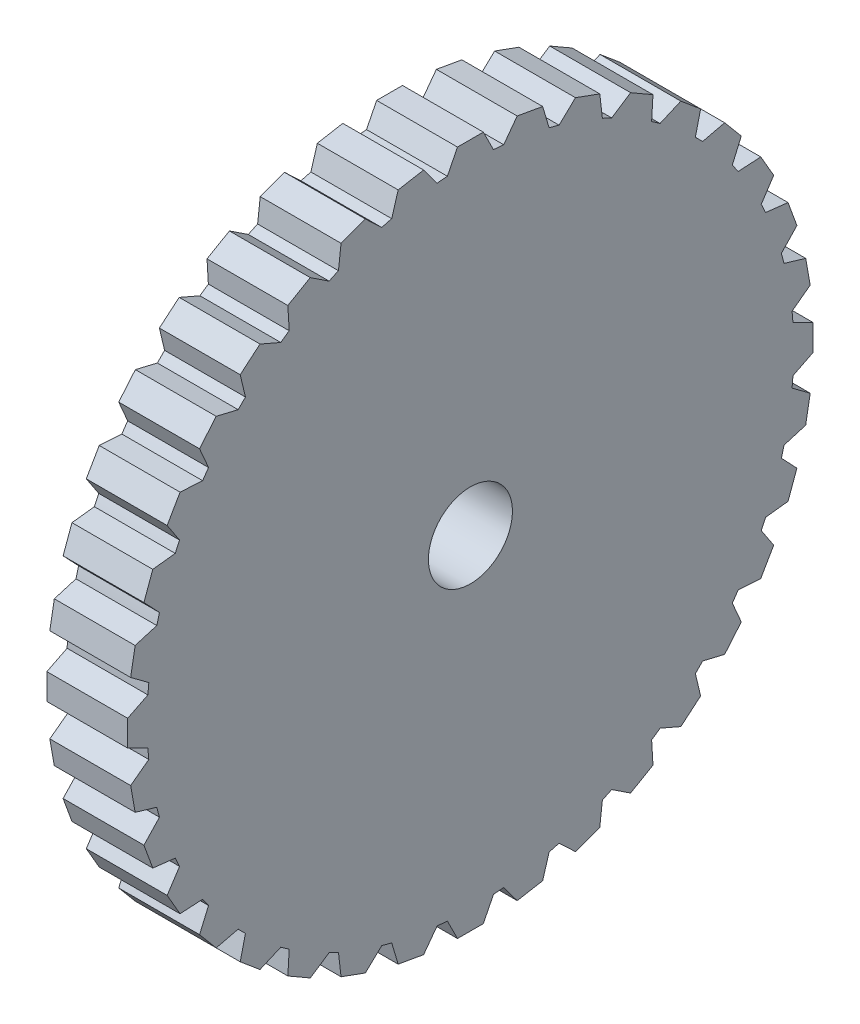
ISO-10303-21;
HEADER;
FILE_DESCRIPTION(('STEP AP214'),'2;1');
FILE_NAME('part.step','',(''),(''),'','','');
FILE_SCHEMA(('AUTOMOTIVE_DESIGN { 1 0 10303 214 1 1 1 1 }'));
ENDSEC;
DATA;
#1=APPLICATION_CONTEXT('core data for automotive mechanical design processes');
#2=APPLICATION_PROTOCOL_DEFINITION('international standard','automotive_design',2000,#1);
#3=PRODUCT_CONTEXT('',#1,'mechanical');
#4=PRODUCT('Part','Part','',(#3));
#5=PRODUCT_RELATED_PRODUCT_CATEGORY('part','',(#4));
#6=PRODUCT_DEFINITION_FORMATION('','',#4);
#7=PRODUCT_DEFINITION_CONTEXT('part definition',#1,'design');
#8=PRODUCT_DEFINITION('design','',#6,#7);
#9=PRODUCT_DEFINITION_SHAPE('','',#8);
#10=(LENGTH_UNIT() NAMED_UNIT(*) SI_UNIT(.MILLI.,.METRE.));
#11=(NAMED_UNIT(*) PLANE_ANGLE_UNIT() SI_UNIT($,.RADIAN.));
#12=(NAMED_UNIT(*) SI_UNIT($,.STERADIAN.) SOLID_ANGLE_UNIT());
#13=UNCERTAINTY_MEASURE_WITH_UNIT(LENGTH_MEASURE(1.E-05),#10,'distance_accuracy_value','');
#14=(GEOMETRIC_REPRESENTATION_CONTEXT(3) GLOBAL_UNCERTAINTY_ASSIGNED_CONTEXT((#13)) GLOBAL_UNIT_ASSIGNED_CONTEXT((#10,
#11,#12)) REPRESENTATION_CONTEXT('',''));
#15=CARTESIAN_POINT('',(0.,0.,0.));
#16=DIRECTION('',(0.,0.,1.));
#17=DIRECTION('',(1.,0.,0.));
#18=AXIS2_PLACEMENT_3D('',#15,#16,#17);
#19=CARTESIAN_POINT('',(3.175,0.,0.));
#20=DIRECTION('',(-1.,0.,0.));
#21=DIRECTION('',(0.,0.,1.));
#22=AXIS2_PLACEMENT_3D('',#19,#20,#21);
#23=CYLINDRICAL_SURFACE('',#22,12.7);
#24=CARTESIAN_POINT('',(0.,0.,0.));
#25=DIRECTION('',(1.,0.,0.));
#26=DIRECTION('',(0.,0.,-1.));
#27=AXIS2_PLACEMENT_3D('',#24,#25,#26);
#28=CIRCLE('',#27,12.7);
#29=CARTESIAN_POINT('',(0.,12.6677032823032,0.905148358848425));
#30=VERTEX_POINT('',#29);
#31=CARTESIAN_POINT('',(0.,12.6324297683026,1.30832646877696));
#32=VERTEX_POINT('',#31);
#33=EDGE_CURVE('E1832',#30,#32,#28,.T.);
#34=ORIENTED_EDGE('',*,*,#33,.T.);
#35=DIRECTION('',(-1.,0.,0.));
#36=VECTOR('',#35,1.);
#37=CARTESIAN_POINT('',(3.175,12.6324297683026,1.30832646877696));
#38=LINE('',#37,#36);
#39=CARTESIAN_POINT('',(3.175,12.6324297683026,1.30832646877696));
#40=VERTEX_POINT('',#39);
#41=EDGE_CURVE('E924',#32,#40,#38,.F.);
#42=ORIENTED_EDGE('',*,*,#41,.T.);
#43=CARTESIAN_POINT('',(3.175,0.,0.));
#44=DIRECTION('',(1.,0.,0.));
#45=DIRECTION('',(0.,0.,-1.));
#46=AXIS2_PLACEMENT_3D('',#43,#44,#45);
#47=CIRCLE('',#46,12.7);
#48=CARTESIAN_POINT('',(3.175,12.6677032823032,0.905148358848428));
#49=VERTEX_POINT('',#48);
#50=EDGE_CURVE('E42',#49,#40,#47,.T.);
#51=ORIENTED_EDGE('',*,*,#50,.F.);
#52=DIRECTION('',(-1.,0.,0.));
#53=VECTOR('',#52,1.);
#54=CARTESIAN_POINT('',(3.175,12.6677032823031,0.905148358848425));
#55=LINE('',#54,#53);
#56=EDGE_CURVE('E1770',#49,#30,#55,.T.);
#57=ORIENTED_EDGE('',*,*,#56,.T.);
#58=EDGE_LOOP('',(#34,#42,#51,#57));
#59=FACE_BOUND('',#58,.T.);
#60=ADVANCED_FACE('F33',(#59),#23,.T.);
#61=CARTESIAN_POINT('',(3.175,12.3180750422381,3.09112071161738));
#62=VERTEX_POINT('',#61);
#63=CARTESIAN_POINT('',(3.175,12.2133262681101,3.48204845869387));
#64=VERTEX_POINT('',#63);
#65=EDGE_CURVE('E43',#62,#64,#47,.T.);
#66=ORIENTED_EDGE('',*,*,#65,.F.);
#67=DIRECTION('',(-1.,0.,0.));
#68=VECTOR('',#67,1.);
#69=CARTESIAN_POINT('',(3.175,12.3180750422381,3.09112071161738));
#70=LINE('',#69,#68);
#71=CARTESIAN_POINT('',(0.,12.3180750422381,3.09112071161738));
#72=VERTEX_POINT('',#71);
#73=EDGE_CURVE('E950',#62,#72,#70,.T.);
#74=ORIENTED_EDGE('',*,*,#73,.T.);
#75=CARTESIAN_POINT('',(0.,12.2133262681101,3.48204845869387));
#76=VERTEX_POINT('',#75);
#77=EDGE_CURVE('E1836',#72,#76,#28,.T.);
#78=ORIENTED_EDGE('',*,*,#77,.T.);
#79=DIRECTION('',(-1.,0.,0.));
#80=VECTOR('',#79,1.);
#81=CARTESIAN_POINT('',(3.175,12.2133262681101,3.48204845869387));
#82=LINE('',#81,#80);
#83=EDGE_CURVE('E975',#76,#64,#82,.F.);
#84=ORIENTED_EDGE('',*,*,#83,.T.);
#85=EDGE_LOOP('',(#66,#74,#78,#84));
#86=FACE_BOUND('',#85,.T.);
#87=ADVANCED_FACE('F2095',(#86),#23,.T.);
#88=CARTESIAN_POINT('',(3.175,11.5941683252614,5.18317092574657));
#89=VERTEX_POINT('',#88);
#90=CARTESIAN_POINT('',(3.175,11.4231270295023,5.5499701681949));
#91=VERTEX_POINT('',#90);
#92=EDGE_CURVE('E1990',#89,#91,#47,.T.);
#93=ORIENTED_EDGE('',*,*,#92,.F.);
#94=DIRECTION('',(-1.,0.,0.));
#95=VECTOR('',#94,1.);
#96=CARTESIAN_POINT('',(3.175,11.5941683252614,5.18317092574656));
#97=LINE('',#96,#95);
#98=CARTESIAN_POINT('',(0.,11.5941683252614,5.18317092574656));
#99=VERTEX_POINT('',#98);
#100=EDGE_CURVE('E970',#89,#99,#97,.T.);
#101=ORIENTED_EDGE('',*,*,#100,.T.);
#102=CARTESIAN_POINT('',(0.,11.4231270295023,5.5499701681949));
#103=VERTEX_POINT('',#102);
#104=EDGE_CURVE('E1838',#99,#103,#28,.T.);
#105=ORIENTED_EDGE('',*,*,#104,.T.);
#106=DIRECTION('',(-1.,0.,0.));
#107=VECTOR('',#106,1.);
#108=CARTESIAN_POINT('',(3.175,11.4231270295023,5.5499701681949));
#109=LINE('',#108,#107);
#110=EDGE_CURVE('E1000',#103,#91,#109,.F.);
#111=ORIENTED_EDGE('',*,*,#110,.T.);
#112=EDGE_LOOP('',(#93,#101,#105,#111));
#113=FACE_BOUND('',#112,.T.);
#114=ADVANCED_FACE('F2099',(#113),#23,.T.);
#115=CARTESIAN_POINT('',(3.175,10.5179786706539,7.11773311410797));
#116=VERTEX_POINT('',#115);
#117=CARTESIAN_POINT('',(3.175,10.2858418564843,7.44925884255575));
#118=VERTEX_POINT('',#117);
#119=EDGE_CURVE('E1993',#116,#118,#47,.T.);
#120=ORIENTED_EDGE('',*,*,#119,.F.);
#121=DIRECTION('',(-1.,0.,0.));
#122=VECTOR('',#121,1.);
#123=CARTESIAN_POINT('',(3.175,10.5179786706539,7.11773311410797));
#124=LINE('',#123,#122);
#125=CARTESIAN_POINT('',(0.,10.5179786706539,7.11773311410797));
#126=VERTEX_POINT('',#125);
#127=EDGE_CURVE('E995',#116,#126,#124,.T.);
#128=ORIENTED_EDGE('',*,*,#127,.T.);
#129=CARTESIAN_POINT('',(0.,10.2858418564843,7.44925884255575));
#130=VERTEX_POINT('',#129);
#131=EDGE_CURVE('E1841',#126,#130,#28,.T.);
#132=ORIENTED_EDGE('',*,*,#131,.T.);
#133=DIRECTION('',(-1.,0.,0.));
#134=VECTOR('',#133,1.);
#135=CARTESIAN_POINT('',(3.175,10.2858418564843,7.44925884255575));
#136=LINE('',#135,#134);
#137=EDGE_CURVE('E1025',#130,#118,#136,.F.);
#138=ORIENTED_EDGE('',*,*,#137,.T.);
#139=EDGE_LOOP('',(#120,#128,#132,#138));
#140=FACE_BOUND('',#139,.T.);
#141=ADVANCED_FACE('F3457',(#140),#23,.T.);
#142=CARTESIAN_POINT('',(3.175,9.1222055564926,8.83602658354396));
#143=VERTEX_POINT('',#142);
#144=CARTESIAN_POINT('',(3.175,8.83602658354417,9.12220555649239));
#145=VERTEX_POINT('',#144);
#146=EDGE_CURVE('E1996',#143,#145,#47,.T.);
#147=ORIENTED_EDGE('',*,*,#146,.F.);
#148=DIRECTION('',(-1.,0.,0.));
#149=VECTOR('',#148,1.);
#150=CARTESIAN_POINT('',(3.175,9.1222055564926,8.83602658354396));
#151=LINE('',#150,#149);
#152=CARTESIAN_POINT('',(0.,9.1222055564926,8.83602658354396));
#153=VERTEX_POINT('',#152);
#154=EDGE_CURVE('E1020',#143,#153,#151,.T.);
#155=ORIENTED_EDGE('',*,*,#154,.T.);
#156=CARTESIAN_POINT('',(0.,8.83602658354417,9.12220555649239));
#157=VERTEX_POINT('',#156);
#158=EDGE_CURVE('E1845',#153,#157,#28,.T.);
#159=ORIENTED_EDGE('',*,*,#158,.T.);
#160=DIRECTION('',(-1.,0.,0.));
#161=VECTOR('',#160,1.);
#162=CARTESIAN_POINT('',(3.175,8.83602658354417,9.12220555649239));
#163=LINE('',#162,#161);
#164=EDGE_CURVE('E1050',#157,#145,#163,.F.);
#165=ORIENTED_EDGE('',*,*,#164,.T.);
#166=EDGE_LOOP('',(#147,#155,#159,#165));
#167=FACE_BOUND('',#166,.T.);
#168=ADVANCED_FACE('F3450',(#167),#23,.T.);
#169=CARTESIAN_POINT('',(3.175,7.44925884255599,10.2858418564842));
#170=VERTEX_POINT('',#169);
#171=CARTESIAN_POINT('',(3.175,7.11773311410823,10.5179786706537));
#172=VERTEX_POINT('',#171);
#173=EDGE_CURVE('E1999',#170,#172,#47,.T.);
#174=ORIENTED_EDGE('',*,*,#173,.F.);
#175=DIRECTION('',(-1.,0.,0.));
#176=VECTOR('',#175,1.);
#177=CARTESIAN_POINT('',(3.175,7.44925884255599,10.2858418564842));
#178=LINE('',#177,#176);
#179=CARTESIAN_POINT('',(0.,7.44925884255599,10.2858418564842));
#180=VERTEX_POINT('',#179);
#181=EDGE_CURVE('E1045',#170,#180,#178,.T.);
#182=ORIENTED_EDGE('',*,*,#181,.T.);
#183=CARTESIAN_POINT('',(0.,7.11773311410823,10.5179786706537));
#184=VERTEX_POINT('',#183);
#185=EDGE_CURVE('E1849',#180,#184,#28,.T.);
#186=ORIENTED_EDGE('',*,*,#185,.T.);
#187=DIRECTION('',(-1.,0.,0.));
#188=VECTOR('',#187,1.);
#189=CARTESIAN_POINT('',(3.175,7.11773311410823,10.5179786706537));
#190=LINE('',#189,#188);
#191=EDGE_CURVE('E1075',#184,#172,#190,.F.);
#192=ORIENTED_EDGE('',*,*,#191,.T.);
#193=EDGE_LOOP('',(#174,#182,#186,#192));
#194=FACE_BOUND('',#193,.T.);
#195=ADVANCED_FACE('F3443',(#194),#23,.T.);
#196=CARTESIAN_POINT('',(3.175,5.54997016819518,11.4231270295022));
#197=VERTEX_POINT('',#196);
#198=CARTESIAN_POINT('',(3.175,5.18317092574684,11.5941683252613));
#199=VERTEX_POINT('',#198);
#200=EDGE_CURVE('E2002',#197,#199,#47,.T.);
#201=ORIENTED_EDGE('',*,*,#200,.F.);
#202=DIRECTION('',(-1.,0.,0.));
#203=VECTOR('',#202,1.);
#204=CARTESIAN_POINT('',(3.175,5.54997016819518,11.4231270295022));
#205=LINE('',#204,#203);
#206=CARTESIAN_POINT('',(0.,5.54997016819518,11.4231270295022));
#207=VERTEX_POINT('',#206);
#208=EDGE_CURVE('E1070',#197,#207,#205,.T.);
#209=ORIENTED_EDGE('',*,*,#208,.T.);
#210=CARTESIAN_POINT('',(0.,5.18317092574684,11.5941683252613));
#211=VERTEX_POINT('',#210);
#212=EDGE_CURVE('E1853',#207,#211,#28,.T.);
#213=ORIENTED_EDGE('',*,*,#212,.T.);
#214=DIRECTION('',(-1.,0.,0.));
#215=VECTOR('',#214,1.);
#216=CARTESIAN_POINT('',(3.175,5.18317092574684,11.5941683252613));
#217=LINE('',#216,#215);
#218=EDGE_CURVE('E1100',#211,#199,#217,.F.);
#219=ORIENTED_EDGE('',*,*,#218,.T.);
#220=EDGE_LOOP('',(#201,#209,#213,#219));
#221=FACE_BOUND('',#220,.T.);
#222=ADVANCED_FACE('F3436',(#221),#23,.T.);
#223=CARTESIAN_POINT('',(3.175,3.48204845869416,12.21332626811));
#224=VERTEX_POINT('',#223);
#225=CARTESIAN_POINT('',(3.175,3.09112071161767,12.3180750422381));
#226=VERTEX_POINT('',#225);
#227=EDGE_CURVE('E2005',#224,#226,#47,.T.);
#228=ORIENTED_EDGE('',*,*,#227,.F.);
#229=DIRECTION('',(-1.,0.,0.));
#230=VECTOR('',#229,1.);
#231=CARTESIAN_POINT('',(3.175,3.48204845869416,12.21332626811));
#232=LINE('',#231,#230);
#233=CARTESIAN_POINT('',(0.,3.48204845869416,12.21332626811));
#234=VERTEX_POINT('',#233);
#235=EDGE_CURVE('E1095',#224,#234,#232,.T.);
#236=ORIENTED_EDGE('',*,*,#235,.T.);
#237=CARTESIAN_POINT('',(0.,3.09112071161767,12.3180750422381));
#238=VERTEX_POINT('',#237);
#239=EDGE_CURVE('E1857',#234,#238,#28,.T.);
#240=ORIENTED_EDGE('',*,*,#239,.T.);
#241=DIRECTION('',(-1.,0.,0.));
#242=VECTOR('',#241,1.);
#243=CARTESIAN_POINT('',(3.175,3.09112071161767,12.3180750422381));
#244=LINE('',#243,#242);
#245=EDGE_CURVE('E1125',#238,#226,#244,.F.);
#246=ORIENTED_EDGE('',*,*,#245,.T.);
#247=EDGE_LOOP('',(#228,#236,#240,#246));
#248=FACE_BOUND('',#247,.T.);
#249=ADVANCED_FACE('F3429',(#248),#23,.T.);
#250=CARTESIAN_POINT('',(3.175,1.30832646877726,12.6324297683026));
#251=VERTEX_POINT('',#250);
#252=CARTESIAN_POINT('',(3.175,0.905148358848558,12.6677032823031));
#253=VERTEX_POINT('',#252);
#254=EDGE_CURVE('E2008',#251,#253,#47,.T.);
#255=ORIENTED_EDGE('',*,*,#254,.F.);
#256=DIRECTION('',(-1.,0.,0.));
#257=VECTOR('',#256,1.);
#258=CARTESIAN_POINT('',(3.175,1.30832646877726,12.6324297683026));
#259=LINE('',#258,#257);
#260=CARTESIAN_POINT('',(0.,1.30832646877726,12.6324297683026));
#261=VERTEX_POINT('',#260);
#262=EDGE_CURVE('E1120',#251,#261,#259,.T.);
#263=ORIENTED_EDGE('',*,*,#262,.T.);
#264=CARTESIAN_POINT('',(0.,0.905148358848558,12.6677032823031));
#265=VERTEX_POINT('',#264);
#266=EDGE_CURVE('E1861',#261,#265,#28,.T.);
#267=ORIENTED_EDGE('',*,*,#266,.T.);
#268=DIRECTION('',(-1.,0.,0.));
#269=VECTOR('',#268,1.);
#270=CARTESIAN_POINT('',(3.175,0.905148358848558,12.6677032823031));
#271=LINE('',#270,#269);
#272=EDGE_CURVE('E1150',#265,#253,#271,.F.);
#273=ORIENTED_EDGE('',*,*,#272,.T.);
#274=EDGE_LOOP('',(#255,#263,#267,#273));
#275=FACE_BOUND('',#274,.T.);
#276=ADVANCED_FACE('F3422',(#275),#23,.T.);
#277=CARTESIAN_POINT('',(3.175,-0.905148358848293,12.6677032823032));
#278=VERTEX_POINT('',#277);
#279=CARTESIAN_POINT('',(3.175,-1.308326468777,12.6324297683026));
#280=VERTEX_POINT('',#279);
#281=EDGE_CURVE('E2011',#278,#280,#47,.T.);
#282=ORIENTED_EDGE('',*,*,#281,.F.);
#283=DIRECTION('',(-1.,0.,0.));
#284=VECTOR('',#283,1.);
#285=CARTESIAN_POINT('',(3.175,-0.90514835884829,12.6677032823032));
#286=LINE('',#285,#284);
#287=CARTESIAN_POINT('',(0.,-0.905148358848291,12.6677032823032));
#288=VERTEX_POINT('',#287);
#289=EDGE_CURVE('E1145',#278,#288,#286,.T.);
#290=ORIENTED_EDGE('',*,*,#289,.T.);
#291=CARTESIAN_POINT('',(0.,-1.308326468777,12.6324297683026));
#292=VERTEX_POINT('',#291);
#293=EDGE_CURVE('E1865',#288,#292,#28,.T.);
#294=ORIENTED_EDGE('',*,*,#293,.T.);
#295=DIRECTION('',(-1.,0.,0.));
#296=VECTOR('',#295,1.);
#297=CARTESIAN_POINT('',(3.175,-1.308326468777,12.6324297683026));
#298=LINE('',#297,#296);
#299=EDGE_CURVE('E1175',#292,#280,#298,.F.);
#300=ORIENTED_EDGE('',*,*,#299,.T.);
#301=EDGE_LOOP('',(#282,#290,#294,#300));
#302=FACE_BOUND('',#301,.T.);
#303=ADVANCED_FACE('F3415',(#302),#23,.T.);
#304=CARTESIAN_POINT('',(3.175,-3.09112071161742,12.3180750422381));
#305=VERTEX_POINT('',#304);
#306=CARTESIAN_POINT('',(3.175,-3.48204845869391,12.2133262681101));
#307=VERTEX_POINT('',#306);
#308=EDGE_CURVE('E2014',#305,#307,#47,.T.);
#309=ORIENTED_EDGE('',*,*,#308,.F.);
#310=DIRECTION('',(-1.,0.,0.));
#311=VECTOR('',#310,1.);
#312=CARTESIAN_POINT('',(3.175,-3.09112071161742,12.3180750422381));
#313=LINE('',#312,#311);
#314=CARTESIAN_POINT('',(0.,-3.09112071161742,12.3180750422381));
#315=VERTEX_POINT('',#314);
#316=EDGE_CURVE('E1170',#305,#315,#313,.T.);
#317=ORIENTED_EDGE('',*,*,#316,.T.);
#318=CARTESIAN_POINT('',(0.,-3.48204845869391,12.2133262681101));
#319=VERTEX_POINT('',#318);
#320=EDGE_CURVE('E1869',#315,#319,#28,.T.);
#321=ORIENTED_EDGE('',*,*,#320,.T.);
#322=DIRECTION('',(-1.,0.,0.));
#323=VECTOR('',#322,1.);
#324=CARTESIAN_POINT('',(3.175,-3.48204845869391,12.2133262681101));
#325=LINE('',#324,#323);
#326=EDGE_CURVE('E1200',#319,#307,#325,.F.);
#327=ORIENTED_EDGE('',*,*,#326,.T.);
#328=EDGE_LOOP('',(#309,#317,#321,#327));
#329=FACE_BOUND('',#328,.T.);
#330=ADVANCED_FACE('F3408',(#329),#23,.T.);
#331=CARTESIAN_POINT('',(3.175,-5.1831709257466,11.5941683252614));
#332=VERTEX_POINT('',#331);
#333=CARTESIAN_POINT('',(3.175,-5.54997016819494,11.4231270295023));
#334=VERTEX_POINT('',#333);
#335=EDGE_CURVE('E2017',#332,#334,#47,.T.);
#336=ORIENTED_EDGE('',*,*,#335,.F.);
#337=DIRECTION('',(-1.,0.,0.));
#338=VECTOR('',#337,1.);
#339=CARTESIAN_POINT('',(3.175,-5.1831709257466,11.5941683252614));
#340=LINE('',#339,#338);
#341=CARTESIAN_POINT('',(0.,-5.1831709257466,11.5941683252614));
#342=VERTEX_POINT('',#341);
#343=EDGE_CURVE('E1195',#332,#342,#340,.T.);
#344=ORIENTED_EDGE('',*,*,#343,.T.);
#345=CARTESIAN_POINT('',(0.,-5.54997016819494,11.4231270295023));
#346=VERTEX_POINT('',#345);
#347=EDGE_CURVE('E1873',#342,#346,#28,.T.);
#348=ORIENTED_EDGE('',*,*,#347,.T.);
#349=DIRECTION('',(-1.,0.,0.));
#350=VECTOR('',#349,1.);
#351=CARTESIAN_POINT('',(3.175,-5.54997016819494,11.4231270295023));
#352=LINE('',#351,#350);
#353=EDGE_CURVE('E1225',#346,#334,#352,.F.);
#354=ORIENTED_EDGE('',*,*,#353,.T.);
#355=EDGE_LOOP('',(#336,#344,#348,#354));
#356=FACE_BOUND('',#355,.T.);
#357=ADVANCED_FACE('F3401',(#356),#23,.T.);
#358=CARTESIAN_POINT('',(3.175,-7.11773311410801,10.5179786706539));
#359=VERTEX_POINT('',#358);
#360=CARTESIAN_POINT('',(3.175,-7.44925884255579,10.2858418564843));
#361=VERTEX_POINT('',#360);
#362=EDGE_CURVE('E2020',#359,#361,#47,.T.);
#363=ORIENTED_EDGE('',*,*,#362,.F.);
#364=DIRECTION('',(-1.,0.,0.));
#365=VECTOR('',#364,1.);
#366=CARTESIAN_POINT('',(3.175,-7.11773311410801,10.5179786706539));
#367=LINE('',#366,#365);
#368=CARTESIAN_POINT('',(0.,-7.11773311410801,10.5179786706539));
#369=VERTEX_POINT('',#368);
#370=EDGE_CURVE('E1220',#359,#369,#367,.T.);
#371=ORIENTED_EDGE('',*,*,#370,.T.);
#372=CARTESIAN_POINT('',(0.,-7.44925884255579,10.2858418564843));
#373=VERTEX_POINT('',#372);
#374=EDGE_CURVE('E1877',#369,#373,#28,.T.);
#375=ORIENTED_EDGE('',*,*,#374,.T.);
#376=DIRECTION('',(-1.,0.,0.));
#377=VECTOR('',#376,1.);
#378=CARTESIAN_POINT('',(3.175,-7.44925884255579,10.2858418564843));
#379=LINE('',#378,#377);
#380=EDGE_CURVE('E1250',#373,#361,#379,.F.);
#381=ORIENTED_EDGE('',*,*,#380,.T.);
#382=EDGE_LOOP('',(#363,#371,#375,#381));
#383=FACE_BOUND('',#382,.T.);
#384=ADVANCED_FACE('F3394',(#383),#23,.T.);
#385=CARTESIAN_POINT('',(3.175,-8.83602658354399,9.12220555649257));
#386=VERTEX_POINT('',#385);
#387=CARTESIAN_POINT('',(3.175,-9.12220555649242,8.83602658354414));
#388=VERTEX_POINT('',#387);
#389=EDGE_CURVE('E2023',#386,#388,#47,.T.);
#390=ORIENTED_EDGE('',*,*,#389,.F.);
#391=DIRECTION('',(-1.,0.,0.));
#392=VECTOR('',#391,1.);
#393=CARTESIAN_POINT('',(3.175,-8.83602658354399,9.12220555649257));
#394=LINE('',#393,#392);
#395=CARTESIAN_POINT('',(0.,-8.83602658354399,9.12220555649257));
#396=VERTEX_POINT('',#395);
#397=EDGE_CURVE('E1245',#386,#396,#394,.T.);
#398=ORIENTED_EDGE('',*,*,#397,.T.);
#399=CARTESIAN_POINT('',(0.,-9.12220555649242,8.83602658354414));
#400=VERTEX_POINT('',#399);
#401=EDGE_CURVE('E1881',#396,#400,#28,.T.);
#402=ORIENTED_EDGE('',*,*,#401,.T.);
#403=DIRECTION('',(-1.,0.,0.));
#404=VECTOR('',#403,1.);
#405=CARTESIAN_POINT('',(3.175,-9.12220555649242,8.83602658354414));
#406=LINE('',#405,#404);
#407=EDGE_CURVE('E1275',#400,#388,#406,.F.);
#408=ORIENTED_EDGE('',*,*,#407,.T.);
#409=EDGE_LOOP('',(#390,#398,#402,#408));
#410=FACE_BOUND('',#409,.T.);
#411=ADVANCED_FACE('F3387',(#410),#23,.T.);
#412=CARTESIAN_POINT('',(3.175,-10.2858418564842,7.44925884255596));
#413=VERTEX_POINT('',#412);
#414=CARTESIAN_POINT('',(3.175,-10.5179786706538,7.11773311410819));
#415=VERTEX_POINT('',#414);
#416=EDGE_CURVE('E2026',#413,#415,#47,.T.);
#417=ORIENTED_EDGE('',*,*,#416,.F.);
#418=DIRECTION('',(-1.,0.,0.));
#419=VECTOR('',#418,1.);
#420=CARTESIAN_POINT('',(3.175,-10.2858418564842,7.44925884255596));
#421=LINE('',#420,#419);
#422=CARTESIAN_POINT('',(0.,-10.2858418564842,7.44925884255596));
#423=VERTEX_POINT('',#422);
#424=EDGE_CURVE('E1270',#413,#423,#421,.T.);
#425=ORIENTED_EDGE('',*,*,#424,.T.);
#426=CARTESIAN_POINT('',(0.,-10.5179786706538,7.11773311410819));
#427=VERTEX_POINT('',#426);
#428=EDGE_CURVE('E1885',#423,#427,#28,.T.);
#429=ORIENTED_EDGE('',*,*,#428,.T.);
#430=DIRECTION('',(-1.,0.,0.));
#431=VECTOR('',#430,1.);
#432=CARTESIAN_POINT('',(3.175,-10.5179786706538,7.11773311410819));
#433=LINE('',#432,#431);
#434=EDGE_CURVE('E1300',#427,#415,#433,.F.);
#435=ORIENTED_EDGE('',*,*,#434,.T.);
#436=EDGE_LOOP('',(#417,#425,#429,#435));
#437=FACE_BOUND('',#436,.T.);
#438=ADVANCED_FACE('F3380',(#437),#23,.T.);
#439=CARTESIAN_POINT('',(3.175,-11.4231270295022,5.54997016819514));
#440=VERTEX_POINT('',#439);
#441=CARTESIAN_POINT('',(3.175,-11.5941683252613,5.1831709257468));
#442=VERTEX_POINT('',#441);
#443=EDGE_CURVE('E2029',#440,#442,#47,.T.);
#444=ORIENTED_EDGE('',*,*,#443,.F.);
#445=DIRECTION('',(-1.,0.,0.));
#446=VECTOR('',#445,1.);
#447=CARTESIAN_POINT('',(3.175,-11.4231270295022,5.54997016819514));
#448=LINE('',#447,#446);
#449=CARTESIAN_POINT('',(0.,-11.4231270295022,5.54997016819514));
#450=VERTEX_POINT('',#449);
#451=EDGE_CURVE('E1295',#440,#450,#448,.T.);
#452=ORIENTED_EDGE('',*,*,#451,.T.);
#453=CARTESIAN_POINT('',(0.,-11.5941683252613,5.1831709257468));
#454=VERTEX_POINT('',#453);
#455=EDGE_CURVE('E1889',#450,#454,#28,.T.);
#456=ORIENTED_EDGE('',*,*,#455,.T.);
#457=DIRECTION('',(-1.,0.,0.));
#458=VECTOR('',#457,1.);
#459=CARTESIAN_POINT('',(3.175,-11.5941683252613,5.18317092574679));
#460=LINE('',#459,#458);
#461=EDGE_CURVE('E1325',#454,#442,#460,.F.);
#462=ORIENTED_EDGE('',*,*,#461,.T.);
#463=EDGE_LOOP('',(#444,#452,#456,#462));
#464=FACE_BOUND('',#463,.T.);
#465=ADVANCED_FACE('F3373',(#464),#23,.T.);
#466=CARTESIAN_POINT('',(3.175,-12.21332626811,3.48204845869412));
#467=VERTEX_POINT('',#466);
#468=CARTESIAN_POINT('',(3.175,-12.3180750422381,3.09112071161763));
#469=VERTEX_POINT('',#468);
#470=EDGE_CURVE('E2032',#467,#469,#47,.T.);
#471=ORIENTED_EDGE('',*,*,#470,.F.);
#472=DIRECTION('',(-1.,0.,0.));
#473=VECTOR('',#472,1.);
#474=CARTESIAN_POINT('',(3.175,-12.21332626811,3.48204845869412));
#475=LINE('',#474,#473);
#476=CARTESIAN_POINT('',(0.,-12.21332626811,3.48204845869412));
#477=VERTEX_POINT('',#476);
#478=EDGE_CURVE('E1320',#467,#477,#475,.T.);
#479=ORIENTED_EDGE('',*,*,#478,.T.);
#480=CARTESIAN_POINT('',(0.,-12.3180750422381,3.09112071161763));
#481=VERTEX_POINT('',#480);
#482=EDGE_CURVE('E1893',#477,#481,#28,.T.);
#483=ORIENTED_EDGE('',*,*,#482,.T.);
#484=DIRECTION('',(-1.,0.,0.));
#485=VECTOR('',#484,1.);
#486=CARTESIAN_POINT('',(3.175,-12.3180750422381,3.09112071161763));
#487=LINE('',#486,#485);
#488=EDGE_CURVE('E1350',#481,#469,#487,.F.);
#489=ORIENTED_EDGE('',*,*,#488,.T.);
#490=EDGE_LOOP('',(#471,#479,#483,#489));
#491=FACE_BOUND('',#490,.T.);
#492=ADVANCED_FACE('F3366',(#491),#23,.T.);
#493=CARTESIAN_POINT('',(3.175,-12.6324297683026,1.30832646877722));
#494=VERTEX_POINT('',#493);
#495=CARTESIAN_POINT('',(3.175,-12.6677032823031,0.905148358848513));
#496=VERTEX_POINT('',#495);
#497=EDGE_CURVE('E2035',#494,#496,#47,.T.);
#498=ORIENTED_EDGE('',*,*,#497,.F.);
#499=DIRECTION('',(-1.,0.,0.));
#500=VECTOR('',#499,1.);
#501=CARTESIAN_POINT('',(3.175,-12.6324297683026,1.30832646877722));
#502=LINE('',#501,#500);
#503=CARTESIAN_POINT('',(0.,-12.6324297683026,1.30832646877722));
#504=VERTEX_POINT('',#503);
#505=EDGE_CURVE('E1345',#494,#504,#502,.T.);
#506=ORIENTED_EDGE('',*,*,#505,.T.);
#507=CARTESIAN_POINT('',(0.,-12.6677032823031,0.905148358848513));
#508=VERTEX_POINT('',#507);
#509=EDGE_CURVE('E1897',#504,#508,#28,.T.);
#510=ORIENTED_EDGE('',*,*,#509,.T.);
#511=DIRECTION('',(-1.,0.,0.));
#512=VECTOR('',#511,1.);
#513=CARTESIAN_POINT('',(3.175,-12.6677032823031,0.905148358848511));
#514=LINE('',#513,#512);
#515=EDGE_CURVE('E1375',#508,#496,#514,.F.);
#516=ORIENTED_EDGE('',*,*,#515,.T.);
#517=EDGE_LOOP('',(#498,#506,#510,#516));
#518=FACE_BOUND('',#517,.T.);
#519=ADVANCED_FACE('F3359',(#518),#23,.T.);
#520=CARTESIAN_POINT('',(3.175,-12.6677032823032,-0.90514835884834));
#521=VERTEX_POINT('',#520);
#522=CARTESIAN_POINT('',(3.175,-12.6324297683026,-1.30832646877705));
#523=VERTEX_POINT('',#522);
#524=EDGE_CURVE('E2038',#521,#523,#47,.T.);
#525=ORIENTED_EDGE('',*,*,#524,.F.);
#526=DIRECTION('',(-1.,0.,0.));
#527=VECTOR('',#526,1.);
#528=CARTESIAN_POINT('',(3.175,-12.6677032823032,-0.905148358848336));
#529=LINE('',#528,#527);
#530=CARTESIAN_POINT('',(0.,-12.6677032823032,-0.905148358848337));
#531=VERTEX_POINT('',#530);
#532=EDGE_CURVE('E1370',#521,#531,#529,.T.);
#533=ORIENTED_EDGE('',*,*,#532,.T.);
#534=CARTESIAN_POINT('',(0.,-12.6324297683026,-1.30832646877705));
#535=VERTEX_POINT('',#534);
#536=EDGE_CURVE('E1901',#531,#535,#28,.T.);
#537=ORIENTED_EDGE('',*,*,#536,.T.);
#538=DIRECTION('',(-1.,0.,0.));
#539=VECTOR('',#538,1.);
#540=CARTESIAN_POINT('',(3.175,-12.6324297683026,-1.30832646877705));
#541=LINE('',#540,#539);
#542=EDGE_CURVE('E1400',#535,#523,#541,.F.);
#543=ORIENTED_EDGE('',*,*,#542,.T.);
#544=EDGE_LOOP('',(#525,#533,#537,#543));
#545=FACE_BOUND('',#544,.T.);
#546=ADVANCED_FACE('F3352',(#545),#23,.T.);
#547=CARTESIAN_POINT('',(3.175,-12.3180750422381,-3.09112071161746));
#548=VERTEX_POINT('',#547);
#549=CARTESIAN_POINT('',(3.175,-12.2133262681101,-3.48204845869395));
#550=VERTEX_POINT('',#549);
#551=EDGE_CURVE('E2041',#548,#550,#47,.T.);
#552=ORIENTED_EDGE('',*,*,#551,.F.);
#553=DIRECTION('',(-1.,0.,0.));
#554=VECTOR('',#553,1.);
#555=CARTESIAN_POINT('',(3.175,-12.3180750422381,-3.09112071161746));
#556=LINE('',#555,#554);
#557=CARTESIAN_POINT('',(0.,-12.3180750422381,-3.09112071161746));
#558=VERTEX_POINT('',#557);
#559=EDGE_CURVE('E1395',#548,#558,#556,.T.);
#560=ORIENTED_EDGE('',*,*,#559,.T.);
#561=CARTESIAN_POINT('',(0.,-12.2133262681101,-3.48204845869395));
#562=VERTEX_POINT('',#561);
#563=EDGE_CURVE('E1905',#558,#562,#28,.T.);
#564=ORIENTED_EDGE('',*,*,#563,.T.);
#565=DIRECTION('',(-1.,0.,0.));
#566=VECTOR('',#565,1.);
#567=CARTESIAN_POINT('',(3.175,-12.2133262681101,-3.48204845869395));
#568=LINE('',#567,#566);
#569=EDGE_CURVE('E1425',#562,#550,#568,.F.);
#570=ORIENTED_EDGE('',*,*,#569,.T.);
#571=EDGE_LOOP('',(#552,#560,#564,#570));
#572=FACE_BOUND('',#571,.T.);
#573=ADVANCED_FACE('F3345',(#572),#23,.T.);
#574=CARTESIAN_POINT('',(3.175,-11.5941683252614,-5.18317092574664));
#575=VERTEX_POINT('',#574);
#576=CARTESIAN_POINT('',(3.175,-11.4231270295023,-5.54997016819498));
#577=VERTEX_POINT('',#576);
#578=EDGE_CURVE('E2044',#575,#577,#47,.T.);
#579=ORIENTED_EDGE('',*,*,#578,.F.);
#580=DIRECTION('',(-1.,0.,0.));
#581=VECTOR('',#580,1.);
#582=CARTESIAN_POINT('',(3.175,-11.5941683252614,-5.18317092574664));
#583=LINE('',#582,#581);
#584=CARTESIAN_POINT('',(0.,-11.5941683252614,-5.18317092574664));
#585=VERTEX_POINT('',#584);
#586=EDGE_CURVE('E1420',#575,#585,#583,.T.);
#587=ORIENTED_EDGE('',*,*,#586,.T.);
#588=CARTESIAN_POINT('',(0.,-11.4231270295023,-5.54997016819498));
#589=VERTEX_POINT('',#588);
#590=EDGE_CURVE('E1909',#585,#589,#28,.T.);
#591=ORIENTED_EDGE('',*,*,#590,.T.);
#592=DIRECTION('',(-1.,0.,0.));
#593=VECTOR('',#592,1.);
#594=CARTESIAN_POINT('',(3.175,-11.4231270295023,-5.54997016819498));
#595=LINE('',#594,#593);
#596=EDGE_CURVE('E1450',#589,#577,#595,.F.);
#597=ORIENTED_EDGE('',*,*,#596,.T.);
#598=EDGE_LOOP('',(#579,#587,#591,#597));
#599=FACE_BOUND('',#598,.T.);
#600=ADVANCED_FACE('F3338',(#599),#23,.T.);
#601=CARTESIAN_POINT('',(3.175,-10.5179786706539,-7.11773311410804));
#602=VERTEX_POINT('',#601);
#603=CARTESIAN_POINT('',(3.175,-10.2858418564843,-7.44925884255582));
#604=VERTEX_POINT('',#603);
#605=EDGE_CURVE('E2047',#602,#604,#47,.T.);
#606=ORIENTED_EDGE('',*,*,#605,.F.);
#607=DIRECTION('',(-1.,0.,0.));
#608=VECTOR('',#607,1.);
#609=CARTESIAN_POINT('',(3.175,-10.5179786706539,-7.11773311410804));
#610=LINE('',#609,#608);
#611=CARTESIAN_POINT('',(0.,-10.5179786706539,-7.11773311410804));
#612=VERTEX_POINT('',#611);
#613=EDGE_CURVE('E1445',#602,#612,#610,.T.);
#614=ORIENTED_EDGE('',*,*,#613,.T.);
#615=CARTESIAN_POINT('',(0.,-10.2858418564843,-7.44925884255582));
#616=VERTEX_POINT('',#615);
#617=EDGE_CURVE('E1913',#612,#616,#28,.T.);
#618=ORIENTED_EDGE('',*,*,#617,.T.);
#619=DIRECTION('',(-1.,0.,0.));
#620=VECTOR('',#619,1.);
#621=CARTESIAN_POINT('',(3.175,-10.2858418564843,-7.44925884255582));
#622=LINE('',#621,#620);
#623=EDGE_CURVE('E1475',#616,#604,#622,.F.);
#624=ORIENTED_EDGE('',*,*,#623,.T.);
#625=EDGE_LOOP('',(#606,#614,#618,#624));
#626=FACE_BOUND('',#625,.T.);
#627=ADVANCED_FACE('F3331',(#626),#23,.T.);
#628=CARTESIAN_POINT('',(3.175,-9.12220555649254,-8.83602658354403));
#629=VERTEX_POINT('',#628);
#630=CARTESIAN_POINT('',(3.175,-8.83602658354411,-9.12220555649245));
#631=VERTEX_POINT('',#630);
#632=EDGE_CURVE('E2050',#629,#631,#47,.T.);
#633=ORIENTED_EDGE('',*,*,#632,.F.);
#634=DIRECTION('',(-1.,0.,0.));
#635=VECTOR('',#634,1.);
#636=CARTESIAN_POINT('',(3.175,-9.12220555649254,-8.83602658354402));
#637=LINE('',#636,#635);
#638=CARTESIAN_POINT('',(0.,-9.12220555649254,-8.83602658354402));
#639=VERTEX_POINT('',#638);
#640=EDGE_CURVE('E1470',#629,#639,#637,.T.);
#641=ORIENTED_EDGE('',*,*,#640,.T.);
#642=CARTESIAN_POINT('',(0.,-8.83602658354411,-9.12220555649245));
#643=VERTEX_POINT('',#642);
#644=EDGE_CURVE('E1917',#639,#643,#28,.T.);
#645=ORIENTED_EDGE('',*,*,#644,.T.);
#646=DIRECTION('',(-1.,0.,0.));
#647=VECTOR('',#646,1.);
#648=CARTESIAN_POINT('',(3.175,-8.83602658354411,-9.12220555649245));
#649=LINE('',#648,#647);
#650=EDGE_CURVE('E1500',#643,#631,#649,.F.);
#651=ORIENTED_EDGE('',*,*,#650,.T.);
#652=EDGE_LOOP('',(#633,#641,#645,#651));
#653=FACE_BOUND('',#652,.T.);
#654=ADVANCED_FACE('F3324',(#653),#23,.T.);
#655=CARTESIAN_POINT('',(3.175,-7.44925884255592,-10.2858418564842));
#656=VERTEX_POINT('',#655);
#657=CARTESIAN_POINT('',(3.175,-7.11773311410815,-10.5179786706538));
#658=VERTEX_POINT('',#657);
#659=EDGE_CURVE('E2053',#656,#658,#47,.T.);
#660=ORIENTED_EDGE('',*,*,#659,.F.);
#661=DIRECTION('',(-1.,0.,0.));
#662=VECTOR('',#661,1.);
#663=CARTESIAN_POINT('',(3.175,-7.44925884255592,-10.2858418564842));
#664=LINE('',#663,#662);
#665=CARTESIAN_POINT('',(0.,-7.44925884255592,-10.2858418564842));
#666=VERTEX_POINT('',#665);
#667=EDGE_CURVE('E1495',#656,#666,#664,.T.);
#668=ORIENTED_EDGE('',*,*,#667,.T.);
#669=CARTESIAN_POINT('',(0.,-7.11773311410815,-10.5179786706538));
#670=VERTEX_POINT('',#669);
#671=EDGE_CURVE('E1921',#666,#670,#28,.T.);
#672=ORIENTED_EDGE('',*,*,#671,.T.);
#673=DIRECTION('',(-1.,0.,0.));
#674=VECTOR('',#673,1.);
#675=CARTESIAN_POINT('',(3.175,-7.11773311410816,-10.5179786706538));
#676=LINE('',#675,#674);
#677=EDGE_CURVE('E1525',#670,#658,#676,.F.);
#678=ORIENTED_EDGE('',*,*,#677,.T.);
#679=EDGE_LOOP('',(#660,#668,#672,#678));
#680=FACE_BOUND('',#679,.T.);
#681=ADVANCED_FACE('F3316',(#680),#23,.T.);
#682=CARTESIAN_POINT('',(3.175,-5.5499701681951,-11.4231270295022));
#683=VERTEX_POINT('',#682);
#684=CARTESIAN_POINT('',(3.175,-5.18317092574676,-11.5941683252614));
#685=VERTEX_POINT('',#684);
#686=EDGE_CURVE('E2056',#683,#685,#47,.T.);
#687=ORIENTED_EDGE('',*,*,#686,.F.);
#688=DIRECTION('',(-1.,0.,0.));
#689=VECTOR('',#688,1.);
#690=CARTESIAN_POINT('',(3.175,-5.5499701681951,-11.4231270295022));
#691=LINE('',#690,#689);
#692=CARTESIAN_POINT('',(0.,-5.5499701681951,-11.4231270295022));
#693=VERTEX_POINT('',#692);
#694=EDGE_CURVE('E1520',#683,#693,#691,.T.);
#695=ORIENTED_EDGE('',*,*,#694,.T.);
#696=CARTESIAN_POINT('',(0.,-5.18317092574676,-11.5941683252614));
#697=VERTEX_POINT('',#696);
#698=EDGE_CURVE('E1925',#693,#697,#28,.T.);
#699=ORIENTED_EDGE('',*,*,#698,.T.);
#700=DIRECTION('',(-1.,0.,0.));
#701=VECTOR('',#700,1.);
#702=CARTESIAN_POINT('',(3.175,-5.18317092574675,-11.5941683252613));
#703=LINE('',#702,#701);
#704=EDGE_CURVE('E1550',#697,#685,#703,.F.);
#705=ORIENTED_EDGE('',*,*,#704,.T.);
#706=EDGE_LOOP('',(#687,#695,#699,#705));
#707=FACE_BOUND('',#706,.T.);
#708=ADVANCED_FACE('F3308',(#707),#23,.T.);
#709=CARTESIAN_POINT('',(3.175,-3.48204845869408,-12.21332626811));
#710=VERTEX_POINT('',#709);
#711=CARTESIAN_POINT('',(3.175,-3.09112071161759,-12.3180750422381));
#712=VERTEX_POINT('',#711);
#713=EDGE_CURVE('E2059',#710,#712,#47,.T.);
#714=ORIENTED_EDGE('',*,*,#713,.F.);
#715=DIRECTION('',(-1.,0.,0.));
#716=VECTOR('',#715,1.);
#717=CARTESIAN_POINT('',(3.175,-3.48204845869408,-12.21332626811));
#718=LINE('',#717,#716);
#719=CARTESIAN_POINT('',(0.,-3.48204845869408,-12.21332626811));
#720=VERTEX_POINT('',#719);
#721=EDGE_CURVE('E1545',#710,#720,#718,.T.);
#722=ORIENTED_EDGE('',*,*,#721,.T.);
#723=CARTESIAN_POINT('',(0.,-3.09112071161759,-12.3180750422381));
#724=VERTEX_POINT('',#723);
#725=EDGE_CURVE('E1929',#720,#724,#28,.T.);
#726=ORIENTED_EDGE('',*,*,#725,.T.);
#727=DIRECTION('',(-1.,0.,0.));
#728=VECTOR('',#727,1.);
#729=CARTESIAN_POINT('',(3.175,-3.09112071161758,-12.3180750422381));
#730=LINE('',#729,#728);
#731=EDGE_CURVE('E1575',#724,#712,#730,.F.);
#732=ORIENTED_EDGE('',*,*,#731,.T.);
#733=EDGE_LOOP('',(#714,#722,#726,#732));
#734=FACE_BOUND('',#733,.T.);
#735=ADVANCED_FACE('F3300',(#734),#23,.T.);
#736=CARTESIAN_POINT('',(3.175,-1.30832646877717,-12.6324297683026));
#737=VERTEX_POINT('',#736);
#738=CARTESIAN_POINT('',(3.175,-0.90514835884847,-12.6677032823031));
#739=VERTEX_POINT('',#738);
#740=EDGE_CURVE('E2062',#737,#739,#47,.T.);
#741=ORIENTED_EDGE('',*,*,#740,.F.);
#742=DIRECTION('',(-1.,0.,0.));
#743=VECTOR('',#742,1.);
#744=CARTESIAN_POINT('',(3.175,-1.30832646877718,-12.6324297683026));
#745=LINE('',#744,#743);
#746=CARTESIAN_POINT('',(0.,-1.30832646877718,-12.6324297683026));
#747=VERTEX_POINT('',#746);
#748=EDGE_CURVE('E1570',#737,#747,#745,.T.);
#749=ORIENTED_EDGE('',*,*,#748,.T.);
#750=CARTESIAN_POINT('',(0.,-0.90514835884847,-12.6677032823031));
#751=VERTEX_POINT('',#750);
#752=EDGE_CURVE('E1933',#747,#751,#28,.T.);
#753=ORIENTED_EDGE('',*,*,#752,.T.);
#754=DIRECTION('',(-1.,0.,0.));
#755=VECTOR('',#754,1.);
#756=CARTESIAN_POINT('',(3.175,-0.90514835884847,-12.6677032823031));
#757=LINE('',#756,#755);
#758=EDGE_CURVE('E1600',#751,#739,#757,.F.);
#759=ORIENTED_EDGE('',*,*,#758,.T.);
#760=EDGE_LOOP('',(#741,#749,#753,#759));
#761=FACE_BOUND('',#760,.T.);
#762=ADVANCED_FACE('F3292',(#761),#23,.T.);
#763=CARTESIAN_POINT('',(3.175,0.905148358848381,-12.6677032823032));
#764=VERTEX_POINT('',#763);
#765=CARTESIAN_POINT('',(3.175,1.30832646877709,-12.6324297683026));
#766=VERTEX_POINT('',#765);
#767=EDGE_CURVE('E2065',#764,#766,#47,.T.);
#768=ORIENTED_EDGE('',*,*,#767,.F.);
#769=DIRECTION('',(-1.,0.,0.));
#770=VECTOR('',#769,1.);
#771=CARTESIAN_POINT('',(3.175,0.90514835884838,-12.6677032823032));
#772=LINE('',#771,#770);
#773=CARTESIAN_POINT('',(0.,0.905148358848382,-12.6677032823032));
#774=VERTEX_POINT('',#773);
#775=EDGE_CURVE('E1595',#764,#774,#772,.T.);
#776=ORIENTED_EDGE('',*,*,#775,.T.);
#777=CARTESIAN_POINT('',(0.,1.30832646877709,-12.6324297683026));
#778=VERTEX_POINT('',#777);
#779=EDGE_CURVE('E1937',#774,#778,#28,.T.);
#780=ORIENTED_EDGE('',*,*,#779,.T.);
#781=DIRECTION('',(-1.,0.,0.));
#782=VECTOR('',#781,1.);
#783=CARTESIAN_POINT('',(3.175,1.30832646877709,-12.6324297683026));
#784=LINE('',#783,#782);
#785=EDGE_CURVE('E1625',#778,#766,#784,.F.);
#786=ORIENTED_EDGE('',*,*,#785,.T.);
#787=EDGE_LOOP('',(#768,#776,#780,#786));
#788=FACE_BOUND('',#787,.T.);
#789=ADVANCED_FACE('F3284',(#788),#23,.T.);
#790=CARTESIAN_POINT('',(3.175,3.0911207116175,-12.3180750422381));
#791=VERTEX_POINT('',#790);
#792=CARTESIAN_POINT('',(3.175,3.482048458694,-12.21332626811));
#793=VERTEX_POINT('',#792);
#794=EDGE_CURVE('E2068',#791,#793,#47,.T.);
#795=ORIENTED_EDGE('',*,*,#794,.F.);
#796=DIRECTION('',(-1.,0.,0.));
#797=VECTOR('',#796,1.);
#798=CARTESIAN_POINT('',(3.175,3.0911207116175,-12.3180750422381));
#799=LINE('',#798,#797);
#800=CARTESIAN_POINT('',(0.,3.0911207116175,-12.3180750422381));
#801=VERTEX_POINT('',#800);
#802=EDGE_CURVE('E1620',#791,#801,#799,.T.);
#803=ORIENTED_EDGE('',*,*,#802,.T.);
#804=CARTESIAN_POINT('',(0.,3.482048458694,-12.21332626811));
#805=VERTEX_POINT('',#804);
#806=EDGE_CURVE('E1941',#801,#805,#28,.T.);
#807=ORIENTED_EDGE('',*,*,#806,.T.);
#808=DIRECTION('',(-1.,0.,0.));
#809=VECTOR('',#808,1.);
#810=CARTESIAN_POINT('',(3.175,3.482048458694,-12.21332626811));
#811=LINE('',#810,#809);
#812=EDGE_CURVE('E1650',#805,#793,#811,.F.);
#813=ORIENTED_EDGE('',*,*,#812,.T.);
#814=EDGE_LOOP('',(#795,#803,#807,#813));
#815=FACE_BOUND('',#814,.T.);
#816=ADVANCED_FACE('F2093',(#815),#23,.T.);
#817=CARTESIAN_POINT('',(3.175,5.18317092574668,-11.5941683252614));
#818=VERTEX_POINT('',#817);
#819=CARTESIAN_POINT('',(3.175,5.54997016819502,-11.4231270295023));
#820=VERTEX_POINT('',#819);
#821=EDGE_CURVE('E2071',#818,#820,#47,.T.);
#822=ORIENTED_EDGE('',*,*,#821,.F.);
#823=DIRECTION('',(-1.,0.,0.));
#824=VECTOR('',#823,1.);
#825=CARTESIAN_POINT('',(3.175,5.18317092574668,-11.5941683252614));
#826=LINE('',#825,#824);
#827=CARTESIAN_POINT('',(0.,5.18317092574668,-11.5941683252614));
#828=VERTEX_POINT('',#827);
#829=EDGE_CURVE('E1645',#818,#828,#826,.T.);
#830=ORIENTED_EDGE('',*,*,#829,.T.);
#831=CARTESIAN_POINT('',(0.,5.54997016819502,-11.4231270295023));
#832=VERTEX_POINT('',#831);
#833=EDGE_CURVE('E1945',#828,#832,#28,.T.);
#834=ORIENTED_EDGE('',*,*,#833,.T.);
#835=DIRECTION('',(-1.,0.,0.));
#836=VECTOR('',#835,1.);
#837=CARTESIAN_POINT('',(3.175,5.54997016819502,-11.4231270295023));
#838=LINE('',#837,#836);
#839=EDGE_CURVE('E1675',#832,#820,#838,.F.);
#840=ORIENTED_EDGE('',*,*,#839,.T.);
#841=EDGE_LOOP('',(#822,#830,#834,#840));
#842=FACE_BOUND('',#841,.T.);
#843=ADVANCED_FACE('F2088',(#842),#23,.T.);
#844=CARTESIAN_POINT('',(3.175,7.11773311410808,-10.5179786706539));
#845=VERTEX_POINT('',#844);
#846=CARTESIAN_POINT('',(3.175,7.44925884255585,-10.2858418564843));
#847=VERTEX_POINT('',#846);
#848=EDGE_CURVE('E1986',#845,#847,#47,.T.);
#849=ORIENTED_EDGE('',*,*,#848,.F.);
#850=DIRECTION('',(-1.,0.,0.));
#851=VECTOR('',#850,1.);
#852=CARTESIAN_POINT('',(3.175,7.11773311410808,-10.5179786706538));
#853=LINE('',#852,#851);
#854=CARTESIAN_POINT('',(0.,7.11773311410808,-10.5179786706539));
#855=VERTEX_POINT('',#854);
#856=EDGE_CURVE('E1670',#845,#855,#853,.T.);
#857=ORIENTED_EDGE('',*,*,#856,.T.);
#858=CARTESIAN_POINT('',(0.,7.44925884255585,-10.2858418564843));
#859=VERTEX_POINT('',#858);
#860=EDGE_CURVE('E1949',#855,#859,#28,.T.);
#861=ORIENTED_EDGE('',*,*,#860,.T.);
#862=DIRECTION('',(-1.,0.,0.));
#863=VECTOR('',#862,1.);
#864=CARTESIAN_POINT('',(3.175,7.44925884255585,-10.2858418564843));
#865=LINE('',#864,#863);
#866=EDGE_CURVE('E1700',#859,#847,#865,.F.);
#867=ORIENTED_EDGE('',*,*,#866,.T.);
#868=EDGE_LOOP('',(#849,#857,#861,#867));
#869=FACE_BOUND('',#868,.T.);
#870=ADVANCED_FACE('F2085',(#869),#23,.T.);
#871=CARTESIAN_POINT('',(3.175,8.83602658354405,-9.12220555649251));
#872=VERTEX_POINT('',#871);
#873=CARTESIAN_POINT('',(3.175,9.12220555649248,-8.83602658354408));
#874=VERTEX_POINT('',#873);
#875=EDGE_CURVE('E1984',#872,#874,#47,.T.);
#876=ORIENTED_EDGE('',*,*,#875,.F.);
#877=DIRECTION('',(-1.,0.,0.));
#878=VECTOR('',#877,1.);
#879=CARTESIAN_POINT('',(3.175,8.83602658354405,-9.12220555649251));
#880=LINE('',#879,#878);
#881=CARTESIAN_POINT('',(0.,8.83602658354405,-9.12220555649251));
#882=VERTEX_POINT('',#881);
#883=EDGE_CURVE('E1695',#872,#882,#880,.T.);
#884=ORIENTED_EDGE('',*,*,#883,.T.);
#885=CARTESIAN_POINT('',(0.,9.12220555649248,-8.83602658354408));
#886=VERTEX_POINT('',#885);
#887=EDGE_CURVE('E1953',#882,#886,#28,.T.);
#888=ORIENTED_EDGE('',*,*,#887,.T.);
#889=DIRECTION('',(-1.,0.,0.));
#890=VECTOR('',#889,1.);
#891=CARTESIAN_POINT('',(3.175,9.12220555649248,-8.83602658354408));
#892=LINE('',#891,#890);
#893=EDGE_CURVE('E1725',#886,#874,#892,.F.);
#894=ORIENTED_EDGE('',*,*,#893,.T.);
#895=EDGE_LOOP('',(#876,#884,#888,#894));
#896=FACE_BOUND('',#895,.T.);
#897=ADVANCED_FACE('F2087',(#896),#23,.T.);
#898=CARTESIAN_POINT('',(3.175,10.2858418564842,-7.44925884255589));
#899=VERTEX_POINT('',#898);
#900=CARTESIAN_POINT('',(3.175,10.5179786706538,-7.11773311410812));
#901=VERTEX_POINT('',#900);
#902=EDGE_CURVE('E1982',#899,#901,#47,.T.);
#903=ORIENTED_EDGE('',*,*,#902,.F.);
#904=DIRECTION('',(-1.,0.,0.));
#905=VECTOR('',#904,1.);
#906=CARTESIAN_POINT('',(3.175,10.2858418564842,-7.44925884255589));
#907=LINE('',#906,#905);
#908=CARTESIAN_POINT('',(0.,10.2858418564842,-7.44925884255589));
#909=VERTEX_POINT('',#908);
#910=EDGE_CURVE('E1720',#899,#909,#907,.T.);
#911=ORIENTED_EDGE('',*,*,#910,.T.);
#912=CARTESIAN_POINT('',(0.,10.5179786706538,-7.11773311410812));
#913=VERTEX_POINT('',#912);
#914=EDGE_CURVE('E1834',#909,#913,#28,.T.);
#915=ORIENTED_EDGE('',*,*,#914,.T.);
#916=DIRECTION('',(-1.,0.,0.));
#917=VECTOR('',#916,1.);
#918=CARTESIAN_POINT('',(3.175,10.5179786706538,-7.11773311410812));
#919=LINE('',#918,#917);
#920=EDGE_CURVE('E1750',#913,#901,#919,.F.);
#921=ORIENTED_EDGE('',*,*,#920,.T.);
#922=EDGE_LOOP('',(#903,#911,#915,#921));
#923=FACE_BOUND('',#922,.T.);
#924=ADVANCED_FACE('F1964',(#923),#23,.T.);
#925=CARTESIAN_POINT('',(0.,12.6324297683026,-1.30832646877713));
#926=VERTEX_POINT('',#925);
#927=CARTESIAN_POINT('',(0.,12.6677032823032,-0.905148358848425));
#928=VERTEX_POINT('',#927);
#929=EDGE_CURVE('E37',#926,#928,#28,.T.);
#930=ORIENTED_EDGE('',*,*,#929,.T.);
#931=DIRECTION('',(-1.,0.,0.));
#932=VECTOR('',#931,1.);
#933=CARTESIAN_POINT('',(3.175,12.6677032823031,-0.905148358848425));
#934=LINE('',#933,#932);
#935=CARTESIAN_POINT('',(3.175,12.6677032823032,-0.905148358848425));
#936=VERTEX_POINT('',#935);
#937=EDGE_CURVE('E1775',#928,#936,#934,.F.);
#938=ORIENTED_EDGE('',*,*,#937,.T.);
#939=CARTESIAN_POINT('',(3.175,12.6324297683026,-1.30832646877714));
#940=VERTEX_POINT('',#939);
#941=EDGE_CURVE('E11',#940,#936,#47,.T.);
#942=ORIENTED_EDGE('',*,*,#941,.F.);
#943=DIRECTION('',(-1.,0.,0.));
#944=VECTOR('',#943,1.);
#945=CARTESIAN_POINT('',(3.175,12.6324297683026,-1.30832646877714));
#946=LINE('',#945,#944);
#947=EDGE_CURVE('E1820',#940,#926,#946,.T.);
#948=ORIENTED_EDGE('',*,*,#947,.T.);
#949=EDGE_LOOP('',(#930,#938,#942,#948));
#950=FACE_BOUND('',#949,.T.);
#951=ADVANCED_FACE('F2108',(#950),#23,.T.);
#952=CARTESIAN_POINT('',(3.175,11.4231270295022,-5.54997016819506));
#953=VERTEX_POINT('',#952);
#954=CARTESIAN_POINT('',(3.175,11.5941683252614,-5.18317092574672));
#955=VERTEX_POINT('',#954);
#956=EDGE_CURVE('E1985',#953,#955,#47,.T.);
#957=ORIENTED_EDGE('',*,*,#956,.F.);
#958=DIRECTION('',(-1.,0.,0.));
#959=VECTOR('',#958,1.);
#960=CARTESIAN_POINT('',(3.175,11.4231270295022,-5.54997016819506));
#961=LINE('',#960,#959);
#962=CARTESIAN_POINT('',(0.,11.4231270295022,-5.54997016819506));
#963=VERTEX_POINT('',#962);
#964=EDGE_CURVE('E1745',#953,#963,#961,.T.);
#965=ORIENTED_EDGE('',*,*,#964,.T.);
#966=CARTESIAN_POINT('',(0.,11.5941683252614,-5.18317092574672));
#967=VERTEX_POINT('',#966);
#968=EDGE_CURVE('E1831',#963,#967,#28,.T.);
#969=ORIENTED_EDGE('',*,*,#968,.T.);
#970=DIRECTION('',(-1.,0.,0.));
#971=VECTOR('',#970,1.);
#972=CARTESIAN_POINT('',(3.175,11.5941683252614,-5.18317092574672));
#973=LINE('',#972,#971);
#974=EDGE_CURVE('E1800',#967,#955,#973,.F.);
#975=ORIENTED_EDGE('',*,*,#974,.T.);
#976=EDGE_LOOP('',(#957,#965,#969,#975));
#977=FACE_BOUND('',#976,.T.);
#978=ADVANCED_FACE('F2101',(#977),#23,.T.);
#979=CARTESIAN_POINT('',(3.175,12.21332626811,-3.48204845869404));
#980=VERTEX_POINT('',#979);
#981=CARTESIAN_POINT('',(3.175,12.3180750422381,-3.09112071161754));
#982=VERTEX_POINT('',#981);
#983=EDGE_CURVE('E44',#980,#982,#47,.T.);
#984=ORIENTED_EDGE('',*,*,#983,.F.);
#985=DIRECTION('',(-1.,0.,0.));
#986=VECTOR('',#985,1.);
#987=CARTESIAN_POINT('',(3.175,12.21332626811,-3.48204845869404));
#988=LINE('',#987,#986);
#989=CARTESIAN_POINT('',(0.,12.21332626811,-3.48204845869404));
#990=VERTEX_POINT('',#989);
#991=EDGE_CURVE('E1795',#980,#990,#988,.T.);
#992=ORIENTED_EDGE('',*,*,#991,.T.);
#993=CARTESIAN_POINT('',(0.,12.3180750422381,-3.09112071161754));
#994=VERTEX_POINT('',#993);
#995=EDGE_CURVE('E1827',#990,#994,#28,.T.);
#996=ORIENTED_EDGE('',*,*,#995,.T.);
#997=DIRECTION('',(-1.,0.,0.));
#998=VECTOR('',#997,1.);
#999=CARTESIAN_POINT('',(3.175,12.3180750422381,-3.09112071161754));
#1000=LINE('',#999,#998);
#1001=EDGE_CURVE('E1825',#994,#982,#1000,.F.);
#1002=ORIENTED_EDGE('',*,*,#1001,.T.);
#1003=EDGE_LOOP('',(#984,#992,#996,#1002));
#1004=FACE_BOUND('',#1003,.T.);
#1005=ADVANCED_FACE('F35',(#1004),#23,.T.);
#1006=CARTESIAN_POINT('',(3.175,0.,0.));
#1007=DIRECTION('',(1.,0.,0.));
#1008=DIRECTION('',(0.,0.,-1.));
#1009=AXIS2_PLACEMENT_3D('',#1006,#1007,#1008);
#1010=PLANE('',#1009);
#1011=CARTESIAN_POINT('',(3.175,0.,0.));
#1012=DIRECTION('',(1.,0.,0.));
#1013=DIRECTION('',(0.,0.,-1.));
#1014=AXIS2_PLACEMENT_3D('',#1011,#1012,#1013);
#1015=CIRCLE('',#1014,1.651);
#1016=CARTESIAN_POINT('',(3.175,0.,-1.651));
#1017=VERTEX_POINT('',#1016);
#1018=EDGE_CURVE('E2177',#1017,#1017,#1015,.T.);
#1019=ORIENTED_EDGE('',*,*,#1018,.F.);
#1020=EDGE_LOOP('',(#1019));
#1021=FACE_BOUND('',#1020,.T.);
#1022=ORIENTED_EDGE('',*,*,#50,.T.);
#1023=DIRECTION('',(0.,0.803181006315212,0.595735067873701));
#1024=VECTOR('',#1023,1.);
#1025=CARTESIAN_POINT('',(3.175,13.3456952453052,1.83736942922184));
#1026=LINE('',#1025,#1024);
#1027=CARTESIAN_POINT('',(3.175,13.3456952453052,1.83736942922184));
#1028=VERTEX_POINT('',#1027);
#1029=EDGE_CURVE('E945',#40,#1028,#1026,.T.);
#1030=ORIENTED_EDGE('',*,*,#1029,.T.);
#1031=DIRECTION('',(0.,-0.173648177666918,0.98480775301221));
#1032=VECTOR('',#1031,1.);
#1033=CARTESIAN_POINT('',(3.175,13.1692686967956,2.83793410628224));
#1034=LINE('',#1033,#1032);
#1035=CARTESIAN_POINT('',(3.175,13.1692686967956,2.83793410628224));
#1036=VERTEX_POINT('',#1035);
#1037=EDGE_CURVE('E934',#1028,#1036,#1034,.T.);
#1038=ORIENTED_EDGE('',*,*,#1037,.T.);
#1039=DIRECTION('',(0.,-0.958496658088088,0.28510376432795));
#1040=VECTOR('',#1039,1.);
#1041=CARTESIAN_POINT('',(3.175,13.1692686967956,2.83793410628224));
#1042=LINE('',#1041,#1040);
#1043=EDGE_CURVE('E51',#1036,#62,#1042,.T.);
#1044=ORIENTED_EDGE('',*,*,#1043,.T.);
#1045=ORIENTED_EDGE('',*,*,#65,.T.);
#1046=DIRECTION('',(0.,0.687530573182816,0.726155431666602));
#1047=VECTOR('',#1046,1.);
#1048=CARTESIAN_POINT('',(3.175,12.8238882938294,4.12691131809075));
#1049=LINE('',#1048,#1047);
#1050=CARTESIAN_POINT('',(3.175,12.8238882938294,4.12691131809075));
#1051=VERTEX_POINT('',#1050);
#1052=EDGE_CURVE('E955',#64,#1051,#1049,.T.);
#1053=ORIENTED_EDGE('',*,*,#1052,.T.);
#1054=DIRECTION('',(0.,-0.342020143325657,0.939692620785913));
#1055=VECTOR('',#1054,1.);
#1056=CARTESIAN_POINT('',(3.175,12.4763958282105,5.08163902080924));
#1057=LINE('',#1056,#1055);
#1058=CARTESIAN_POINT('',(3.175,12.4763958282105,5.08163902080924));
#1059=VERTEX_POINT('',#1058);
#1060=EDGE_CURVE('E965',#1051,#1059,#1057,.T.);
#1061=ORIENTED_EDGE('',*,*,#1060,.T.);
#1062=DIRECTION('',(0.,-0.993442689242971,0.114331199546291));
#1063=VECTOR('',#1062,1.);
#1064=CARTESIAN_POINT('',(3.175,12.4763958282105,5.08163902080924));
#1065=LINE('',#1064,#1063);
#1066=EDGE_CURVE('E58',#1059,#89,#1065,.T.);
#1067=ORIENTED_EDGE('',*,*,#1066,.T.);
#1068=ORIENTED_EDGE('',*,*,#92,.T.);
#1069=DIRECTION('',(0.,0.550989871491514,0.834511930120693));
#1070=VECTOR('',#1069,1.);
#1071=CARTESIAN_POINT('',(3.175,11.9124339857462,6.29105909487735));
#1072=LINE('',#1071,#1070);
#1073=CARTESIAN_POINT('',(3.175,11.9124339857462,6.29105909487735));
#1074=VERTEX_POINT('',#1073);
#1075=EDGE_CURVE('E978',#91,#1074,#1072,.T.);
#1076=ORIENTED_EDGE('',*,*,#1075,.T.);
#1077=DIRECTION('',(0.,-0.499999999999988,0.866025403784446));
#1078=VECTOR('',#1077,1.);
#1079=CARTESIAN_POINT('',(3.175,11.4044339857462,7.17094090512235));
#1080=LINE('',#1079,#1078);
#1081=CARTESIAN_POINT('',(3.175,11.4044339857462,7.17094090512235));
#1082=VERTEX_POINT('',#1081);
#1083=EDGE_CURVE('E989',#1074,#1082,#1080,.T.);
#1084=ORIENTED_EDGE('',*,*,#1083,.T.);
#1085=DIRECTION('',(0.,-0.998203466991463,-0.0599152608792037));
#1086=VECTOR('',#1085,1.);
#1087=CARTESIAN_POINT('',(3.175,11.4044339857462,7.17094090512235));
#1088=LINE('',#1087,#1086);
#1089=EDGE_CURVE('E982',#1082,#116,#1088,.T.);
#1090=ORIENTED_EDGE('',*,*,#1089,.T.);
#1091=ORIENTED_EDGE('',*,*,#119,.T.);
#1092=DIRECTION('',(0.,0.397707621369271,0.917512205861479));
#1093=VECTOR('',#1092,1.);
#1094=CARTESIAN_POINT('',(3.175,10.6390263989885,8.26405622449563));
#1095=LINE('',#1094,#1093);
#1096=CARTESIAN_POINT('',(3.175,10.6390263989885,8.26405622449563));
#1097=VERTEX_POINT('',#1096);
#1098=EDGE_CURVE('E1003',#118,#1097,#1095,.T.);
#1099=ORIENTED_EDGE('',*,*,#1098,.T.);
#1100=DIRECTION('',(0.,-0.642787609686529,0.766044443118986));
#1101=VECTOR('',#1100,1.);
#1102=CARTESIAN_POINT('',(3.175,9.98595418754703,9.04235737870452));
#1103=LINE('',#1102,#1101);
#1104=CARTESIAN_POINT('',(3.175,9.98595418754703,9.04235737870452));
#1105=VERTEX_POINT('',#1104);
#1106=EDGE_CURVE('E1014',#1097,#1105,#1103,.T.);
#1107=ORIENTED_EDGE('',*,*,#1106,.T.);
#1108=DIRECTION('',(0.,-0.972634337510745,-0.232341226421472));
#1109=VECTOR('',#1108,1.);
#1110=CARTESIAN_POINT('',(3.175,9.98595418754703,9.04235737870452));
#1111=LINE('',#1110,#1109);
#1112=EDGE_CURVE('E1007',#1105,#143,#1111,.T.);
#1113=ORIENTED_EDGE('',*,*,#1112,.T.);
#1114=ORIENTED_EDGE('',*,*,#146,.T.);
#1115=DIRECTION('',(0.,0.232341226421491,0.972634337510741));
#1116=VECTOR('',#1115,1.);
#1117=CARTESIAN_POINT('',(3.175,9.04235737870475,9.98595418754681));
#1118=LINE('',#1117,#1116);
#1119=CARTESIAN_POINT('',(3.175,9.04235737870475,9.98595418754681));
#1120=VERTEX_POINT('',#1119);
#1121=EDGE_CURVE('E1028',#145,#1120,#1118,.T.);
#1122=ORIENTED_EDGE('',*,*,#1121,.T.);
#1123=DIRECTION('',(0.,-0.766044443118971,0.642787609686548));
#1124=VECTOR('',#1123,1.);
#1125=CARTESIAN_POINT('',(3.175,8.26405622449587,10.6390263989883));
#1126=LINE('',#1125,#1124);
#1127=CARTESIAN_POINT('',(3.175,8.26405622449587,10.6390263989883));
#1128=VERTEX_POINT('',#1127);
#1129=EDGE_CURVE('E1039',#1120,#1128,#1126,.T.);
#1130=ORIENTED_EDGE('',*,*,#1129,.T.);
#1131=DIRECTION('',(0.,-0.917512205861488,-0.39770762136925));
#1132=VECTOR('',#1131,1.);
#1133=CARTESIAN_POINT('',(3.175,8.26405622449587,10.6390263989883));
#1134=LINE('',#1133,#1132);
#1135=EDGE_CURVE('E1032',#1128,#170,#1134,.T.);
#1136=ORIENTED_EDGE('',*,*,#1135,.T.);
#1137=ORIENTED_EDGE('',*,*,#173,.T.);
#1138=DIRECTION('',(0.,0.0599152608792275,0.998203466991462));
#1139=VECTOR('',#1138,1.);
#1140=CARTESIAN_POINT('',(3.175,7.17094090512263,11.404433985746));
#1141=LINE('',#1140,#1139);
#1142=CARTESIAN_POINT('',(3.175,7.17094090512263,11.404433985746));
#1143=VERTEX_POINT('',#1142);
#1144=EDGE_CURVE('E1053',#172,#1143,#1141,.T.);
#1145=ORIENTED_EDGE('',*,*,#1144,.T.);
#1146=DIRECTION('',(0.,-0.866025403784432,0.500000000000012));
#1147=VECTOR('',#1146,1.);
#1148=CARTESIAN_POINT('',(3.175,6.29105909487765,11.912433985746));
#1149=LINE('',#1148,#1147);
#1150=CARTESIAN_POINT('',(3.175,6.29105909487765,11.912433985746));
#1151=VERTEX_POINT('',#1150);
#1152=EDGE_CURVE('E1064',#1143,#1151,#1149,.T.);
#1153=ORIENTED_EDGE('',*,*,#1152,.T.);
#1154=DIRECTION('',(0.,-0.834511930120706,-0.550989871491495));
#1155=VECTOR('',#1154,1.);
#1156=CARTESIAN_POINT('',(3.175,6.29105909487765,11.912433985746));
#1157=LINE('',#1156,#1155);
#1158=EDGE_CURVE('E1057',#1151,#197,#1157,.T.);
#1159=ORIENTED_EDGE('',*,*,#1158,.T.);
#1160=ORIENTED_EDGE('',*,*,#200,.T.);
#1161=DIRECTION('',(0.,-0.114331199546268,0.993442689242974));
#1162=VECTOR('',#1161,1.);
#1163=CARTESIAN_POINT('',(3.175,5.08163902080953,12.4763958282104));
#1164=LINE('',#1163,#1162);
#1165=CARTESIAN_POINT('',(3.175,5.08163902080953,12.4763958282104));
#1166=VERTEX_POINT('',#1165);
#1167=EDGE_CURVE('E1078',#199,#1166,#1164,.T.);
#1168=ORIENTED_EDGE('',*,*,#1167,.T.);
#1169=DIRECTION('',(0.,-0.939692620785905,0.342020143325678));
#1170=VECTOR('',#1169,1.);
#1171=CARTESIAN_POINT('',(3.175,4.12691131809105,12.8238882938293));
#1172=LINE('',#1171,#1170);
#1173=CARTESIAN_POINT('',(3.175,4.12691131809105,12.8238882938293));
#1174=VERTEX_POINT('',#1173);
#1175=EDGE_CURVE('E1089',#1166,#1174,#1172,.T.);
#1176=ORIENTED_EDGE('',*,*,#1175,.T.);
#1177=DIRECTION('',(0.,-0.726155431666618,-0.687530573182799));
#1178=VECTOR('',#1177,1.);
#1179=CARTESIAN_POINT('',(3.175,4.12691131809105,12.8238882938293));
#1180=LINE('',#1179,#1178);
#1181=EDGE_CURVE('E1082',#1174,#224,#1180,.T.);
#1182=ORIENTED_EDGE('',*,*,#1181,.T.);
#1183=ORIENTED_EDGE('',*,*,#227,.T.);
#1184=DIRECTION('',(0.,-0.285103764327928,0.958496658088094));
#1185=VECTOR('',#1184,1.);
#1186=CARTESIAN_POINT('',(3.175,2.83793410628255,13.1692686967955));
#1187=LINE('',#1186,#1185);
#1188=CARTESIAN_POINT('',(3.175,2.83793410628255,13.1692686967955));
#1189=VERTEX_POINT('',#1188);
#1190=EDGE_CURVE('E1103',#226,#1189,#1187,.T.);
#1191=ORIENTED_EDGE('',*,*,#1190,.T.);
#1192=DIRECTION('',(0.,-0.984807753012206,0.173648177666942));
#1193=VECTOR('',#1192,1.);
#1194=CARTESIAN_POINT('',(3.175,1.83736942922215,13.3456952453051));
#1195=LINE('',#1194,#1193);
#1196=CARTESIAN_POINT('',(3.175,1.83736942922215,13.3456952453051));
#1197=VERTEX_POINT('',#1196);
#1198=EDGE_CURVE('E1114',#1189,#1197,#1195,.T.);
#1199=ORIENTED_EDGE('',*,*,#1198,.T.);
#1200=DIRECTION('',(0.,-0.595735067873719,-0.803181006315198));
#1201=VECTOR('',#1200,1.);
#1202=CARTESIAN_POINT('',(3.175,1.83736942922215,13.3456952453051));
#1203=LINE('',#1202,#1201);
#1204=EDGE_CURVE('E1107',#1197,#251,#1203,.T.);
#1205=ORIENTED_EDGE('',*,*,#1204,.T.);
#1206=ORIENTED_EDGE('',*,*,#254,.T.);
#1207=DIRECTION('',(0.,-0.447213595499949,0.89442719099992));
#1208=VECTOR('',#1207,1.);
#1209=CARTESIAN_POINT('',(3.175,0.508000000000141,13.462));
#1210=LINE('',#1209,#1208);
#1211=CARTESIAN_POINT('',(3.175,0.508000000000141,13.462));
#1212=VERTEX_POINT('',#1211);
#1213=EDGE_CURVE('E1128',#253,#1212,#1210,.T.);
#1214=ORIENTED_EDGE('',*,*,#1213,.T.);
#1215=DIRECTION('',(0.,-1.,0.));
#1216=VECTOR('',#1215,1.);
#1217=CARTESIAN_POINT('',(3.175,-0.507999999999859,13.462));
#1218=LINE('',#1217,#1216);
#1219=CARTESIAN_POINT('',(3.175,-0.507999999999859,13.462));
#1220=VERTEX_POINT('',#1219);
#1221=EDGE_CURVE('E1139',#1212,#1220,#1218,.T.);
#1222=ORIENTED_EDGE('',*,*,#1221,.T.);
#1223=DIRECTION('',(0.,-0.447213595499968,-0.894427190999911));
#1224=VECTOR('',#1223,1.);
#1225=CARTESIAN_POINT('',(3.175,-0.507999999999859,13.462));
#1226=LINE('',#1225,#1224);
#1227=EDGE_CURVE('E1132',#1220,#278,#1226,.T.);
#1228=ORIENTED_EDGE('',*,*,#1227,.T.);
#1229=ORIENTED_EDGE('',*,*,#281,.T.);
#1230=DIRECTION('',(0.,-0.595735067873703,0.80318100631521));
#1231=VECTOR('',#1230,1.);
#1232=CARTESIAN_POINT('',(3.175,-1.83736942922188,13.3456952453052));
#1233=LINE('',#1232,#1231);
#1234=CARTESIAN_POINT('',(3.175,-1.83736942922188,13.3456952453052));
#1235=VERTEX_POINT('',#1234);
#1236=EDGE_CURVE('E1153',#280,#1235,#1233,.T.);
#1237=ORIENTED_EDGE('',*,*,#1236,.T.);
#1238=DIRECTION('',(0.,-0.98480775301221,-0.173648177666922));
#1239=VECTOR('',#1238,1.);
#1240=CARTESIAN_POINT('',(3.175,-2.83793410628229,13.1692686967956));
#1241=LINE('',#1240,#1239);
#1242=CARTESIAN_POINT('',(3.175,-2.83793410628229,13.1692686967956));
#1243=VERTEX_POINT('',#1242);
#1244=EDGE_CURVE('E1164',#1235,#1243,#1241,.T.);
#1245=ORIENTED_EDGE('',*,*,#1244,.T.);
#1246=DIRECTION('',(0.,-0.285103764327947,-0.958496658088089));
#1247=VECTOR('',#1246,1.);
#1248=CARTESIAN_POINT('',(3.175,-2.83793410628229,13.1692686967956));
#1249=LINE('',#1248,#1247);
#1250=EDGE_CURVE('E1157',#1243,#305,#1249,.T.);
#1251=ORIENTED_EDGE('',*,*,#1250,.T.);
#1252=ORIENTED_EDGE('',*,*,#308,.T.);
#1253=DIRECTION('',(0.,-0.726155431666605,0.687530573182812));
#1254=VECTOR('',#1253,1.);
#1255=CARTESIAN_POINT('',(3.175,-4.12691131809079,12.8238882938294));
#1256=LINE('',#1255,#1254);
#1257=CARTESIAN_POINT('',(3.175,-4.12691131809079,12.8238882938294));
#1258=VERTEX_POINT('',#1257);
#1259=EDGE_CURVE('E1178',#307,#1258,#1256,.T.);
#1260=ORIENTED_EDGE('',*,*,#1259,.T.);
#1261=DIRECTION('',(0.,-0.939692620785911,-0.34202014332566));
#1262=VECTOR('',#1261,1.);
#1263=CARTESIAN_POINT('',(3.175,-5.08163902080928,12.4763958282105));
#1264=LINE('',#1263,#1262);
#1265=CARTESIAN_POINT('',(3.175,-5.08163902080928,12.4763958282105));
#1266=VERTEX_POINT('',#1265);
#1267=EDGE_CURVE('E1189',#1258,#1266,#1264,.T.);
#1268=ORIENTED_EDGE('',*,*,#1267,.T.);
#1269=DIRECTION('',(0.,-0.114331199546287,-0.993442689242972));
#1270=VECTOR('',#1269,1.);
#1271=CARTESIAN_POINT('',(3.175,-5.08163902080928,12.4763958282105));
#1272=LINE('',#1271,#1270);
#1273=EDGE_CURVE('E1182',#1266,#332,#1272,.T.);
#1274=ORIENTED_EDGE('',*,*,#1273,.T.);
#1275=ORIENTED_EDGE('',*,*,#335,.T.);
#1276=DIRECTION('',(0.,-0.834511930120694,0.550989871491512));
#1277=VECTOR('',#1276,1.);
#1278=CARTESIAN_POINT('',(3.175,-6.29105909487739,11.9124339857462));
#1279=LINE('',#1278,#1277);
#1280=CARTESIAN_POINT('',(3.175,-6.29105909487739,11.9124339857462));
#1281=VERTEX_POINT('',#1280);
#1282=EDGE_CURVE('E1203',#334,#1281,#1279,.T.);
#1283=ORIENTED_EDGE('',*,*,#1282,.T.);
#1284=DIRECTION('',(0.,-0.866025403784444,-0.499999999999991));
#1285=VECTOR('',#1284,1.);
#1286=CARTESIAN_POINT('',(3.175,-7.17094090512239,11.4044339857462));
#1287=LINE('',#1286,#1285);
#1288=CARTESIAN_POINT('',(3.175,-7.17094090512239,11.4044339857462));
#1289=VERTEX_POINT('',#1288);
#1290=EDGE_CURVE('E1214',#1281,#1289,#1287,.T.);
#1291=ORIENTED_EDGE('',*,*,#1290,.T.);
#1292=DIRECTION('',(0.,0.0599152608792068,-0.998203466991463));
#1293=VECTOR('',#1292,1.);
#1294=CARTESIAN_POINT('',(3.175,-7.17094090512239,11.4044339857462));
#1295=LINE('',#1294,#1293);
#1296=EDGE_CURVE('E1207',#1289,#359,#1295,.T.);
#1297=ORIENTED_EDGE('',*,*,#1296,.T.);
#1298=ORIENTED_EDGE('',*,*,#362,.T.);
#1299=DIRECTION('',(0.,-0.91751220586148,0.397707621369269));
#1300=VECTOR('',#1299,1.);
#1301=CARTESIAN_POINT('',(3.175,-8.26405622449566,10.6390263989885));
#1302=LINE('',#1301,#1300);
#1303=CARTESIAN_POINT('',(3.175,-8.26405622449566,10.6390263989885));
#1304=VERTEX_POINT('',#1303);
#1305=EDGE_CURVE('E1228',#361,#1304,#1302,.T.);
#1306=ORIENTED_EDGE('',*,*,#1305,.T.);
#1307=DIRECTION('',(0.,-0.766044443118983,-0.642787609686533));
#1308=VECTOR('',#1307,1.);
#1309=CARTESIAN_POINT('',(3.175,-9.04235737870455,9.98595418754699));
#1310=LINE('',#1309,#1308);
#1311=CARTESIAN_POINT('',(3.175,-9.04235737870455,9.98595418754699));
#1312=VERTEX_POINT('',#1311);
#1313=EDGE_CURVE('E1239',#1304,#1312,#1310,.T.);
#1314=ORIENTED_EDGE('',*,*,#1313,.T.);
#1315=DIRECTION('',(0.,0.232341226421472,-0.972634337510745));
#1316=VECTOR('',#1315,1.);
#1317=CARTESIAN_POINT('',(3.175,-9.04235737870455,9.98595418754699));
#1318=LINE('',#1317,#1316);
#1319=EDGE_CURVE('E1232',#1312,#386,#1318,.T.);
#1320=ORIENTED_EDGE('',*,*,#1319,.T.);
#1321=ORIENTED_EDGE('',*,*,#389,.T.);
#1322=DIRECTION('',(0.,-0.972634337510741,0.232341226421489));
#1323=VECTOR('',#1322,1.);
#1324=CARTESIAN_POINT('',(3.175,-9.98595418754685,9.04235737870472));
#1325=LINE('',#1324,#1323);
#1326=CARTESIAN_POINT('',(3.175,-9.98595418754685,9.04235737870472));
#1327=VERTEX_POINT('',#1326);
#1328=EDGE_CURVE('E1253',#388,#1327,#1325,.T.);
#1329=ORIENTED_EDGE('',*,*,#1328,.T.);
#1330=DIRECTION('',(0.,-0.642787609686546,-0.766044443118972));
#1331=VECTOR('',#1330,1.);
#1332=CARTESIAN_POINT('',(3.175,-10.6390263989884,8.26405622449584));
#1333=LINE('',#1332,#1331);
#1334=CARTESIAN_POINT('',(3.175,-10.6390263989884,8.26405622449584));
#1335=VERTEX_POINT('',#1334);
#1336=EDGE_CURVE('E1264',#1327,#1335,#1333,.T.);
#1337=ORIENTED_EDGE('',*,*,#1336,.T.);
#1338=DIRECTION('',(0.,0.397707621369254,-0.917512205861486));
#1339=VECTOR('',#1338,1.);
#1340=CARTESIAN_POINT('',(3.175,-10.6390263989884,8.26405622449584));
#1341=LINE('',#1340,#1339);
#1342=EDGE_CURVE('E1257',#1335,#413,#1341,.T.);
#1343=ORIENTED_EDGE('',*,*,#1342,.T.);
#1344=ORIENTED_EDGE('',*,*,#416,.T.);
#1345=DIRECTION('',(0.,-0.998203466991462,0.0599152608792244));
#1346=VECTOR('',#1345,1.);
#1347=CARTESIAN_POINT('',(3.175,-11.4044339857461,7.17094090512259));
#1348=LINE('',#1347,#1346);
#1349=CARTESIAN_POINT('',(3.175,-11.4044339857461,7.17094090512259));
#1350=VERTEX_POINT('',#1349);
#1351=EDGE_CURVE('E1278',#415,#1350,#1348,.T.);
#1352=ORIENTED_EDGE('',*,*,#1351,.T.);
#1353=DIRECTION('',(0.,-0.500000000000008,-0.866025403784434));
#1354=VECTOR('',#1353,1.);
#1355=CARTESIAN_POINT('',(3.175,-11.9124339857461,6.2910590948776));
#1356=LINE('',#1355,#1354);
#1357=CARTESIAN_POINT('',(3.175,-11.9124339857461,6.2910590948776));
#1358=VERTEX_POINT('',#1357);
#1359=EDGE_CURVE('E1289',#1350,#1358,#1356,.T.);
#1360=ORIENTED_EDGE('',*,*,#1359,.T.);
#1361=DIRECTION('',(0.,0.550989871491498,-0.834511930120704));
#1362=VECTOR('',#1361,1.);
#1363=CARTESIAN_POINT('',(3.175,-11.9124339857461,6.2910590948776));
#1364=LINE('',#1363,#1362);
#1365=EDGE_CURVE('E1282',#1358,#440,#1364,.T.);
#1366=ORIENTED_EDGE('',*,*,#1365,.T.);
#1367=ORIENTED_EDGE('',*,*,#443,.T.);
#1368=DIRECTION('',(0.,-0.993442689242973,-0.114331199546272));
#1369=VECTOR('',#1368,1.);
#1370=CARTESIAN_POINT('',(3.175,-12.4763958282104,5.08163902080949));
#1371=LINE('',#1370,#1369);
#1372=CARTESIAN_POINT('',(3.175,-12.4763958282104,5.08163902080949));
#1373=VERTEX_POINT('',#1372);
#1374=EDGE_CURVE('E1303',#442,#1373,#1371,.T.);
#1375=ORIENTED_EDGE('',*,*,#1374,.T.);
#1376=DIRECTION('',(0.,-0.342020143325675,-0.939692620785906));
#1377=VECTOR('',#1376,1.);
#1378=CARTESIAN_POINT('',(3.175,-12.8238882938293,4.12691131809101));
#1379=LINE('',#1378,#1377);
#1380=CARTESIAN_POINT('',(3.175,-12.8238882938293,4.12691131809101));
#1381=VERTEX_POINT('',#1380);
#1382=EDGE_CURVE('E1314',#1373,#1381,#1379,.T.);
#1383=ORIENTED_EDGE('',*,*,#1382,.T.);
#1384=DIRECTION('',(0.,0.6875305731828,-0.726155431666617));
#1385=VECTOR('',#1384,1.);
#1386=CARTESIAN_POINT('',(3.175,-12.8238882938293,4.12691131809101));
#1387=LINE('',#1386,#1385);
#1388=EDGE_CURVE('E1307',#1381,#467,#1387,.T.);
#1389=ORIENTED_EDGE('',*,*,#1388,.T.);
#1390=ORIENTED_EDGE('',*,*,#470,.T.);
#1391=DIRECTION('',(0.,-0.958496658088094,-0.285103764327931));
#1392=VECTOR('',#1391,1.);
#1393=CARTESIAN_POINT('',(3.175,-13.1692686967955,2.83793410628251));
#1394=LINE('',#1393,#1392);
#1395=CARTESIAN_POINT('',(3.175,-13.1692686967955,2.83793410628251));
#1396=VERTEX_POINT('',#1395);
#1397=EDGE_CURVE('E1328',#469,#1396,#1394,.T.);
#1398=ORIENTED_EDGE('',*,*,#1397,.T.);
#1399=DIRECTION('',(0.,-0.173648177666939,-0.984807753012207));
#1400=VECTOR('',#1399,1.);
#1401=CARTESIAN_POINT('',(3.175,-13.3456952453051,1.83736942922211));
#1402=LINE('',#1401,#1400);
#1403=CARTESIAN_POINT('',(3.175,-13.3456952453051,1.83736942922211));
#1404=VERTEX_POINT('',#1403);
#1405=EDGE_CURVE('E1339',#1396,#1404,#1402,.T.);
#1406=ORIENTED_EDGE('',*,*,#1405,.T.);
#1407=DIRECTION('',(0.,0.8031810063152,-0.595735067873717));
#1408=VECTOR('',#1407,1.);
#1409=CARTESIAN_POINT('',(3.175,-13.3456952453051,1.83736942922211));
#1410=LINE('',#1409,#1408);
#1411=EDGE_CURVE('E1332',#1404,#494,#1410,.T.);
#1412=ORIENTED_EDGE('',*,*,#1411,.T.);
#1413=ORIENTED_EDGE('',*,*,#497,.T.);
#1414=DIRECTION('',(0.,-0.894427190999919,-0.447213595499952));
#1415=VECTOR('',#1414,1.);
#1416=CARTESIAN_POINT('',(3.175,-13.462,0.508000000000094));
#1417=LINE('',#1416,#1415);
#1418=CARTESIAN_POINT('',(3.175,-13.462,0.508000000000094));
#1419=VERTEX_POINT('',#1418);
#1420=EDGE_CURVE('E1353',#496,#1419,#1417,.T.);
#1421=ORIENTED_EDGE('',*,*,#1420,.T.);
#1422=DIRECTION('',(0.,0.,-1.));
#1423=VECTOR('',#1422,1.);
#1424=CARTESIAN_POINT('',(3.175,-13.462,-0.507999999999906));
#1425=LINE('',#1424,#1423);
#1426=CARTESIAN_POINT('',(3.175,-13.462,-0.507999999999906));
#1427=VERTEX_POINT('',#1426);
#1428=EDGE_CURVE('E1364',#1419,#1427,#1425,.T.);
#1429=ORIENTED_EDGE('',*,*,#1428,.T.);
#1430=DIRECTION('',(0.,0.894427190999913,-0.447213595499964));
#1431=VECTOR('',#1430,1.);
#1432=CARTESIAN_POINT('',(3.175,-13.462,-0.507999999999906));
#1433=LINE('',#1432,#1431);
#1434=EDGE_CURVE('E1357',#1427,#521,#1433,.T.);
#1435=ORIENTED_EDGE('',*,*,#1434,.T.);
#1436=ORIENTED_EDGE('',*,*,#524,.T.);
#1437=DIRECTION('',(0.,-0.803181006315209,-0.595735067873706));
#1438=VECTOR('',#1437,1.);
#1439=CARTESIAN_POINT('',(3.175,-13.3456952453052,-1.83736942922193));
#1440=LINE('',#1439,#1438);
#1441=CARTESIAN_POINT('',(3.175,-13.3456952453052,-1.83736942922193));
#1442=VERTEX_POINT('',#1441);
#1443=EDGE_CURVE('E1378',#523,#1442,#1440,.T.);
#1444=ORIENTED_EDGE('',*,*,#1443,.T.);
#1445=DIRECTION('',(0.,0.173648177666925,-0.984807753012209));
#1446=VECTOR('',#1445,1.);
#1447=CARTESIAN_POINT('',(3.175,-13.1692686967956,-2.83793410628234));
#1448=LINE('',#1447,#1446);
#1449=CARTESIAN_POINT('',(3.175,-13.1692686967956,-2.83793410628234));
#1450=VERTEX_POINT('',#1449);
#1451=EDGE_CURVE('E1389',#1442,#1450,#1448,.T.);
#1452=ORIENTED_EDGE('',*,*,#1451,.T.);
#1453=DIRECTION('',(0.,0.95849665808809,-0.285103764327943));
#1454=VECTOR('',#1453,1.);
#1455=CARTESIAN_POINT('',(3.175,-13.1692686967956,-2.83793410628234));
#1456=LINE('',#1455,#1454);
#1457=EDGE_CURVE('E1382',#1450,#548,#1456,.T.);
#1458=ORIENTED_EDGE('',*,*,#1457,.T.);
#1459=ORIENTED_EDGE('',*,*,#551,.T.);
#1460=DIRECTION('',(0.,-0.687530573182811,-0.726155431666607));
#1461=VECTOR('',#1460,1.);
#1462=CARTESIAN_POINT('',(3.175,-12.8238882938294,-4.12691131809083));
#1463=LINE('',#1462,#1461);
#1464=CARTESIAN_POINT('',(3.175,-12.8238882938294,-4.12691131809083));
#1465=VERTEX_POINT('',#1464);
#1466=EDGE_CURVE('E1403',#550,#1465,#1463,.T.);
#1467=ORIENTED_EDGE('',*,*,#1466,.T.);
#1468=DIRECTION('',(0.,0.342020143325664,-0.93969262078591));
#1469=VECTOR('',#1468,1.);
#1470=CARTESIAN_POINT('',(3.175,-12.4763958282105,-5.08163902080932));
#1471=LINE('',#1470,#1469);
#1472=CARTESIAN_POINT('',(3.175,-12.4763958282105,-5.08163902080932));
#1473=VERTEX_POINT('',#1472);
#1474=EDGE_CURVE('E1414',#1465,#1473,#1471,.T.);
#1475=ORIENTED_EDGE('',*,*,#1474,.T.);
#1476=DIRECTION('',(0.,0.993442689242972,-0.114331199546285));
#1477=VECTOR('',#1476,1.);
#1478=CARTESIAN_POINT('',(3.175,-12.4763958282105,-5.08163902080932));
#1479=LINE('',#1478,#1477);
#1480=EDGE_CURVE('E1407',#1473,#575,#1479,.T.);
#1481=ORIENTED_EDGE('',*,*,#1480,.T.);
#1482=ORIENTED_EDGE('',*,*,#578,.T.);
#1483=DIRECTION('',(0.,-0.550989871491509,-0.834511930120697));
#1484=VECTOR('',#1483,1.);
#1485=CARTESIAN_POINT('',(3.175,-11.9124339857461,-6.29105909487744));
#1486=LINE('',#1485,#1484);
#1487=CARTESIAN_POINT('',(3.175,-11.9124339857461,-6.29105909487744));
#1488=VERTEX_POINT('',#1487);
#1489=EDGE_CURVE('E1428',#577,#1488,#1486,.T.);
#1490=ORIENTED_EDGE('',*,*,#1489,.T.);
#1491=DIRECTION('',(0.,0.499999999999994,-0.866025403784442));
#1492=VECTOR('',#1491,1.);
#1493=CARTESIAN_POINT('',(3.175,-11.4044339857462,-7.17094090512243));
#1494=LINE('',#1493,#1492);
#1495=CARTESIAN_POINT('',(3.175,-11.4044339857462,-7.17094090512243));
#1496=VERTEX_POINT('',#1495);
#1497=EDGE_CURVE('E1439',#1488,#1496,#1494,.T.);
#1498=ORIENTED_EDGE('',*,*,#1497,.T.);
#1499=DIRECTION('',(0.,0.998203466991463,0.0599152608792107));
#1500=VECTOR('',#1499,1.);
#1501=CARTESIAN_POINT('',(3.175,-11.4044339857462,-7.17094090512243));
#1502=LINE('',#1501,#1500);
#1503=EDGE_CURVE('E1432',#1496,#602,#1502,.T.);
#1504=ORIENTED_EDGE('',*,*,#1503,.T.);
#1505=ORIENTED_EDGE('',*,*,#605,.T.);
#1506=DIRECTION('',(0.,-0.397707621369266,-0.917512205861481));
#1507=VECTOR('',#1506,1.);
#1508=CARTESIAN_POINT('',(3.175,-10.6390263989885,-8.2640562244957));
#1509=LINE('',#1508,#1507);
#1510=CARTESIAN_POINT('',(3.175,-10.6390263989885,-8.2640562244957));
#1511=VERTEX_POINT('',#1510);
#1512=EDGE_CURVE('E1453',#604,#1511,#1509,.T.);
#1513=ORIENTED_EDGE('',*,*,#1512,.T.);
#1514=DIRECTION('',(0.,0.642787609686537,-0.76604444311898));
#1515=VECTOR('',#1514,1.);
#1516=CARTESIAN_POINT('',(3.175,-9.98595418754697,-9.04235737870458));
#1517=LINE('',#1516,#1515);
#1518=CARTESIAN_POINT('',(3.175,-9.98595418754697,-9.04235737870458));
#1519=VERTEX_POINT('',#1518);
#1520=EDGE_CURVE('E1464',#1511,#1519,#1517,.T.);
#1521=ORIENTED_EDGE('',*,*,#1520,.T.);
#1522=DIRECTION('',(0.,0.972634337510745,0.232341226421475));
#1523=VECTOR('',#1522,1.);
#1524=CARTESIAN_POINT('',(3.175,-9.98595418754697,-9.04235737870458));
#1525=LINE('',#1524,#1523);
#1526=EDGE_CURVE('E1457',#1519,#629,#1525,.T.);
#1527=ORIENTED_EDGE('',*,*,#1526,.T.);
#1528=ORIENTED_EDGE('',*,*,#632,.T.);
#1529=DIRECTION('',(0.,-0.232341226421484,-0.972634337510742));
#1530=VECTOR('',#1529,1.);
#1531=CARTESIAN_POINT('',(3.175,-9.04235737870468,-9.98595418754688));
#1532=LINE('',#1531,#1530);
#1533=CARTESIAN_POINT('',(3.175,-9.04235737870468,-9.98595418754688));
#1534=VERTEX_POINT('',#1533);
#1535=EDGE_CURVE('E1478',#631,#1534,#1532,.T.);
#1536=ORIENTED_EDGE('',*,*,#1535,.T.);
#1537=DIRECTION('',(0.,0.766044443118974,-0.642787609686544));
#1538=VECTOR('',#1537,1.);
#1539=CARTESIAN_POINT('',(3.175,-8.2640562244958,-10.6390263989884));
#1540=LINE('',#1539,#1538);
#1541=CARTESIAN_POINT('',(3.175,-8.2640562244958,-10.6390263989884));
#1542=VERTEX_POINT('',#1541);
#1543=EDGE_CURVE('E1489',#1534,#1542,#1540,.T.);
#1544=ORIENTED_EDGE('',*,*,#1543,.T.);
#1545=DIRECTION('',(0.,0.917512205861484,0.397707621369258));
#1546=VECTOR('',#1545,1.);
#1547=CARTESIAN_POINT('',(3.175,-8.2640562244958,-10.6390263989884));
#1548=LINE('',#1547,#1546);
#1549=EDGE_CURVE('E1482',#1542,#656,#1548,.T.);
#1550=ORIENTED_EDGE('',*,*,#1549,.T.);
#1551=ORIENTED_EDGE('',*,*,#659,.T.);
#1552=DIRECTION('',(0.,-0.0599152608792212,-0.998203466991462));
#1553=VECTOR('',#1552,1.);
#1554=CARTESIAN_POINT('',(3.175,-7.17094090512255,-11.4044339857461));
#1555=LINE('',#1554,#1553);
#1556=CARTESIAN_POINT('',(3.175,-7.17094090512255,-11.4044339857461));
#1557=VERTEX_POINT('',#1556);
#1558=EDGE_CURVE('E1503',#658,#1557,#1555,.T.);
#1559=ORIENTED_EDGE('',*,*,#1558,.T.);
#1560=DIRECTION('',(0.,0.866025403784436,-0.500000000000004));
#1561=VECTOR('',#1560,1.);
#1562=CARTESIAN_POINT('',(3.175,-6.29105909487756,-11.9124339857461));
#1563=LINE('',#1562,#1561);
#1564=CARTESIAN_POINT('',(3.175,-6.29105909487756,-11.9124339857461));
#1565=VERTEX_POINT('',#1564);
#1566=EDGE_CURVE('E1514',#1557,#1565,#1563,.T.);
#1567=ORIENTED_EDGE('',*,*,#1566,.T.);
#1568=DIRECTION('',(0.,0.834511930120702,0.550989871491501));
#1569=VECTOR('',#1568,1.);
#1570=CARTESIAN_POINT('',(3.175,-6.29105909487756,-11.9124339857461));
#1571=LINE('',#1570,#1569);
#1572=EDGE_CURVE('E1507',#1565,#683,#1571,.T.);
#1573=ORIENTED_EDGE('',*,*,#1572,.T.);
#1574=ORIENTED_EDGE('',*,*,#686,.T.);
#1575=DIRECTION('',(0.,0.114331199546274,-0.993442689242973));
#1576=VECTOR('',#1575,1.);
#1577=CARTESIAN_POINT('',(3.175,-5.08163902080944,-12.4763958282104));
#1578=LINE('',#1577,#1576);
#1579=CARTESIAN_POINT('',(3.175,-5.08163902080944,-12.4763958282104));
#1580=VERTEX_POINT('',#1579);
#1581=EDGE_CURVE('E1528',#685,#1580,#1578,.T.);
#1582=ORIENTED_EDGE('',*,*,#1581,.T.);
#1583=DIRECTION('',(0.,0.939692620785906,-0.342020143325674));
#1584=VECTOR('',#1583,1.);
#1585=CARTESIAN_POINT('',(3.175,-4.12691131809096,-12.8238882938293));
#1586=LINE('',#1585,#1584);
#1587=CARTESIAN_POINT('',(3.175,-4.12691131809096,-12.8238882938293));
#1588=VERTEX_POINT('',#1587);
#1589=EDGE_CURVE('E1539',#1580,#1588,#1586,.T.);
#1590=ORIENTED_EDGE('',*,*,#1589,.T.);
#1591=DIRECTION('',(0.,0.726155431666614,0.687530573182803));
#1592=VECTOR('',#1591,1.);
#1593=CARTESIAN_POINT('',(3.175,-4.12691131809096,-12.8238882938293));
#1594=LINE('',#1593,#1592);
#1595=EDGE_CURVE('E1532',#1588,#710,#1594,.T.);
#1596=ORIENTED_EDGE('',*,*,#1595,.T.);
#1597=ORIENTED_EDGE('',*,*,#713,.T.);
#1598=DIRECTION('',(0.,0.285103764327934,-0.958496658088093));
#1599=VECTOR('',#1598,1.);
#1600=CARTESIAN_POINT('',(3.175,-2.83793410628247,-13.1692686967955));
#1601=LINE('',#1600,#1599);
#1602=CARTESIAN_POINT('',(3.175,-2.83793410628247,-13.1692686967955));
#1603=VERTEX_POINT('',#1602);
#1604=EDGE_CURVE('E1553',#712,#1603,#1601,.T.);
#1605=ORIENTED_EDGE('',*,*,#1604,.T.);
#1606=DIRECTION('',(0.,0.984807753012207,-0.173648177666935));
#1607=VECTOR('',#1606,1.);
#1608=CARTESIAN_POINT('',(3.175,-1.83736942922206,-13.3456952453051));
#1609=LINE('',#1608,#1607);
#1610=CARTESIAN_POINT('',(3.175,-1.83736942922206,-13.3456952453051));
#1611=VERTEX_POINT('',#1610);
#1612=EDGE_CURVE('E1564',#1603,#1611,#1609,.T.);
#1613=ORIENTED_EDGE('',*,*,#1612,.T.);
#1614=DIRECTION('',(0.,0.595735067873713,0.803181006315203));
#1615=VECTOR('',#1614,1.);
#1616=CARTESIAN_POINT('',(3.175,-1.83736942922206,-13.3456952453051));
#1617=LINE('',#1616,#1615);
#1618=EDGE_CURVE('E1557',#1611,#737,#1617,.T.);
#1619=ORIENTED_EDGE('',*,*,#1618,.T.);
#1620=ORIENTED_EDGE('',*,*,#740,.T.);
#1621=DIRECTION('',(0.,0.447213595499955,-0.894427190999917));
#1622=VECTOR('',#1621,1.);
#1623=CARTESIAN_POINT('',(3.175,-0.508000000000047,-13.462));
#1624=LINE('',#1623,#1622);
#1625=CARTESIAN_POINT('',(3.175,-0.508000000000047,-13.462));
#1626=VERTEX_POINT('',#1625);
#1627=EDGE_CURVE('E1578',#739,#1626,#1624,.T.);
#1628=ORIENTED_EDGE('',*,*,#1627,.T.);
#1629=DIRECTION('',(0.,1.,0.));
#1630=VECTOR('',#1629,1.);
#1631=CARTESIAN_POINT('',(3.175,0.507999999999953,-13.462));
#1632=LINE('',#1631,#1630);
#1633=CARTESIAN_POINT('',(3.175,0.507999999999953,-13.462));
#1634=VERTEX_POINT('',#1633);
#1635=EDGE_CURVE('E1589',#1626,#1634,#1632,.T.);
#1636=ORIENTED_EDGE('',*,*,#1635,.T.);
#1637=DIRECTION('',(0.,0.447213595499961,0.894427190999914));
#1638=VECTOR('',#1637,1.);
#1639=CARTESIAN_POINT('',(3.175,0.507999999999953,-13.462));
#1640=LINE('',#1639,#1638);
#1641=EDGE_CURVE('E1582',#1634,#764,#1640,.T.);
#1642=ORIENTED_EDGE('',*,*,#1641,.T.);
#1643=ORIENTED_EDGE('',*,*,#767,.T.);
#1644=DIRECTION('',(0.,0.595735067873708,-0.803181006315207));
#1645=VECTOR('',#1644,1.);
#1646=CARTESIAN_POINT('',(3.175,1.83736942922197,-13.3456952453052));
#1647=LINE('',#1646,#1645);
#1648=CARTESIAN_POINT('',(3.175,1.83736942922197,-13.3456952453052));
#1649=VERTEX_POINT('',#1648);
#1650=EDGE_CURVE('E1603',#766,#1649,#1647,.T.);
#1651=ORIENTED_EDGE('',*,*,#1650,.T.);
#1652=DIRECTION('',(0.,0.984807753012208,0.173648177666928));
#1653=VECTOR('',#1652,1.);
#1654=CARTESIAN_POINT('',(3.175,2.83793410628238,-13.1692686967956));
#1655=LINE('',#1654,#1653);
#1656=CARTESIAN_POINT('',(3.175,2.83793410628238,-13.1692686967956));
#1657=VERTEX_POINT('',#1656);
#1658=EDGE_CURVE('E1614',#1649,#1657,#1655,.T.);
#1659=ORIENTED_EDGE('',*,*,#1658,.T.);
#1660=DIRECTION('',(0.,0.285103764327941,0.958496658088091));
#1661=VECTOR('',#1660,1.);
#1662=CARTESIAN_POINT('',(3.175,2.83793410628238,-13.1692686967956));
#1663=LINE('',#1662,#1661);
#1664=EDGE_CURVE('E1607',#1657,#791,#1663,.T.);
#1665=ORIENTED_EDGE('',*,*,#1664,.T.);
#1666=ORIENTED_EDGE('',*,*,#794,.T.);
#1667=DIRECTION('',(0.,0.726155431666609,-0.687530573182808));
#1668=VECTOR('',#1667,1.);
#1669=CARTESIAN_POINT('',(3.175,4.12691131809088,-12.8238882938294));
#1670=LINE('',#1669,#1668);
#1671=CARTESIAN_POINT('',(3.175,4.12691131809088,-12.8238882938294));
#1672=VERTEX_POINT('',#1671);
#1673=EDGE_CURVE('E1628',#793,#1672,#1670,.T.);
#1674=ORIENTED_EDGE('',*,*,#1673,.T.);
#1675=DIRECTION('',(0.,0.939692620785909,0.342020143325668));
#1676=VECTOR('',#1675,1.);
#1677=CARTESIAN_POINT('',(3.175,5.08163902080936,-12.4763958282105));
#1678=LINE('',#1677,#1676);
#1679=CARTESIAN_POINT('',(3.175,5.08163902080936,-12.4763958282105));
#1680=VERTEX_POINT('',#1679);
#1681=EDGE_CURVE('E1639',#1672,#1680,#1678,.T.);
#1682=ORIENTED_EDGE('',*,*,#1681,.T.);
#1683=DIRECTION('',(0.,0.114331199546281,0.993442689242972));
#1684=VECTOR('',#1683,1.);
#1685=CARTESIAN_POINT('',(3.175,5.08163902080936,-12.4763958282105));
#1686=LINE('',#1685,#1684);
#1687=EDGE_CURVE('E1632',#1680,#818,#1686,.T.);
#1688=ORIENTED_EDGE('',*,*,#1687,.T.);
#1689=ORIENTED_EDGE('',*,*,#821,.T.);
#1690=DIRECTION('',(0.,0.834511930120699,-0.550989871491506));
#1691=VECTOR('',#1690,1.);
#1692=CARTESIAN_POINT('',(3.175,6.29105909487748,-11.9124339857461));
#1693=LINE('',#1692,#1691);
#1694=CARTESIAN_POINT('',(3.175,6.29105909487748,-11.9124339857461));
#1695=VERTEX_POINT('',#1694);
#1696=EDGE_CURVE('E1653',#820,#1695,#1693,.T.);
#1697=ORIENTED_EDGE('',*,*,#1696,.T.);
#1698=DIRECTION('',(0.,0.86602540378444,0.499999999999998));
#1699=VECTOR('',#1698,1.);
#1700=CARTESIAN_POINT('',(3.175,7.17094090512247,-11.4044339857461));
#1701=LINE('',#1700,#1699);
#1702=CARTESIAN_POINT('',(3.175,7.17094090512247,-11.4044339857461));
#1703=VERTEX_POINT('',#1702);
#1704=EDGE_CURVE('E1664',#1695,#1703,#1701,.T.);
#1705=ORIENTED_EDGE('',*,*,#1704,.T.);
#1706=DIRECTION('',(0.,-0.0599152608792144,0.998203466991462));
#1707=VECTOR('',#1706,1.);
#1708=CARTESIAN_POINT('',(3.175,7.17094090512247,-11.4044339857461));
#1709=LINE('',#1708,#1707);
#1710=EDGE_CURVE('E1657',#1703,#845,#1709,.T.);
#1711=ORIENTED_EDGE('',*,*,#1710,.T.);
#1712=ORIENTED_EDGE('',*,*,#848,.T.);
#1713=DIRECTION('',(0.,0.917512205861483,-0.397707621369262));
#1714=VECTOR('',#1713,1.);
#1715=CARTESIAN_POINT('',(3.175,8.26405622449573,-10.6390263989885));
#1716=LINE('',#1715,#1714);
#1717=CARTESIAN_POINT('',(3.175,8.26405622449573,-10.6390263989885));
#1718=VERTEX_POINT('',#1717);
#1719=EDGE_CURVE('E1678',#847,#1718,#1716,.T.);
#1720=ORIENTED_EDGE('',*,*,#1719,.T.);
#1721=DIRECTION('',(0.,0.76604444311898,0.642787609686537));
#1722=VECTOR('',#1721,1.);
#1723=CARTESIAN_POINT('',(3.175,9.04235737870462,-9.98595418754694));
#1724=LINE('',#1723,#1722);
#1725=CARTESIAN_POINT('',(3.175,9.04235737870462,-9.98595418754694));
#1726=VERTEX_POINT('',#1725);
#1727=EDGE_CURVE('E1689',#1718,#1726,#1724,.T.);
#1728=ORIENTED_EDGE('',*,*,#1727,.T.);
#1729=DIRECTION('',(0.,-0.232341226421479,0.972634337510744));
#1730=VECTOR('',#1729,1.);
#1731=CARTESIAN_POINT('',(3.175,9.04235737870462,-9.98595418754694));
#1732=LINE('',#1731,#1730);
#1733=EDGE_CURVE('E1682',#1726,#872,#1732,.T.);
#1734=ORIENTED_EDGE('',*,*,#1733,.T.);
#1735=ORIENTED_EDGE('',*,*,#875,.T.);
#1736=DIRECTION('',(0.,0.972634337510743,-0.232341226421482));
#1737=VECTOR('',#1736,1.);
#1738=CARTESIAN_POINT('',(3.175,9.98595418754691,-9.04235737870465));
#1739=LINE('',#1738,#1737);
#1740=CARTESIAN_POINT('',(3.175,9.98595418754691,-9.04235737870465));
#1741=VERTEX_POINT('',#1740);
#1742=EDGE_CURVE('E1703',#874,#1741,#1739,.T.);
#1743=ORIENTED_EDGE('',*,*,#1742,.T.);
#1744=DIRECTION('',(0.,0.642787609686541,0.766044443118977));
#1745=VECTOR('',#1744,1.);
#1746=CARTESIAN_POINT('',(3.175,10.6390263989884,-8.26405622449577));
#1747=LINE('',#1746,#1745);
#1748=CARTESIAN_POINT('',(3.175,10.6390263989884,-8.26405622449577));
#1749=VERTEX_POINT('',#1748);
#1750=EDGE_CURVE('E1714',#1741,#1749,#1747,.T.);
#1751=ORIENTED_EDGE('',*,*,#1750,.T.);
#1752=DIRECTION('',(0.,-0.39770762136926,0.917512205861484));
#1753=VECTOR('',#1752,1.);
#1754=CARTESIAN_POINT('',(3.175,10.6390263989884,-8.26405622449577));
#1755=LINE('',#1754,#1753);
#1756=EDGE_CURVE('E1707',#1749,#899,#1755,.T.);
#1757=ORIENTED_EDGE('',*,*,#1756,.T.);
#1758=ORIENTED_EDGE('',*,*,#902,.T.);
#1759=DIRECTION('',(0.,0.998203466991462,-0.0599152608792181));
#1760=VECTOR('',#1759,1.);
#1761=CARTESIAN_POINT('',(3.175,11.4044339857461,-7.17094090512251));
#1762=LINE('',#1761,#1760);
#1763=CARTESIAN_POINT('',(3.175,11.4044339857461,-7.17094090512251));
#1764=VERTEX_POINT('',#1763);
#1765=EDGE_CURVE('E1728',#901,#1764,#1762,.T.);
#1766=ORIENTED_EDGE('',*,*,#1765,.T.);
#1767=DIRECTION('',(0.,0.500000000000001,0.866025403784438));
#1768=VECTOR('',#1767,1.);
#1769=CARTESIAN_POINT('',(3.175,11.9124339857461,-6.29105909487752));
#1770=LINE('',#1769,#1768);
#1771=CARTESIAN_POINT('',(3.175,11.9124339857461,-6.29105909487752));
#1772=VERTEX_POINT('',#1771);
#1773=EDGE_CURVE('E1739',#1764,#1772,#1770,.T.);
#1774=ORIENTED_EDGE('',*,*,#1773,.T.);
#1775=DIRECTION('',(0.,-0.550989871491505,0.834511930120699));
#1776=VECTOR('',#1775,1.);
#1777=CARTESIAN_POINT('',(3.175,11.9124339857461,-6.29105909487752));
#1778=LINE('',#1777,#1776);
#1779=EDGE_CURVE('E1732',#1772,#953,#1778,.T.);
#1780=ORIENTED_EDGE('',*,*,#1779,.T.);
#1781=ORIENTED_EDGE('',*,*,#956,.T.);
#1782=DIRECTION('',(0.,0.993442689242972,0.114331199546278));
#1783=VECTOR('',#1782,1.);
#1784=CARTESIAN_POINT('',(3.175,12.4763958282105,-5.0816390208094));
#1785=LINE('',#1784,#1783);
#1786=CARTESIAN_POINT('',(3.175,12.4763958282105,-5.0816390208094));
#1787=VERTEX_POINT('',#1786);
#1788=EDGE_CURVE('E1778',#955,#1787,#1785,.T.);
#1789=ORIENTED_EDGE('',*,*,#1788,.T.);
#1790=DIRECTION('',(0.,0.342020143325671,0.939692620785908));
#1791=VECTOR('',#1790,1.);
#1792=CARTESIAN_POINT('',(3.175,12.8238882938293,-4.12691131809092));
#1793=LINE('',#1792,#1791);
#1794=CARTESIAN_POINT('',(3.175,12.8238882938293,-4.12691131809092));
#1795=VERTEX_POINT('',#1794);
#1796=EDGE_CURVE('E1789',#1787,#1795,#1793,.T.);
#1797=ORIENTED_EDGE('',*,*,#1796,.T.);
#1798=DIRECTION('',(0.,-0.687530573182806,0.726155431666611));
#1799=VECTOR('',#1798,1.);
#1800=CARTESIAN_POINT('',(3.175,12.8238882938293,-4.12691131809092));
#1801=LINE('',#1800,#1799);
#1802=EDGE_CURVE('E1782',#1795,#980,#1801,.T.);
#1803=ORIENTED_EDGE('',*,*,#1802,.T.);
#1804=ORIENTED_EDGE('',*,*,#983,.T.);
#1805=DIRECTION('',(0.,0.958496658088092,0.285103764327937));
#1806=VECTOR('',#1805,1.);
#1807=CARTESIAN_POINT('',(3.175,13.1692686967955,-2.83793410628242));
#1808=LINE('',#1807,#1806);
#1809=CARTESIAN_POINT('',(3.175,13.1692686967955,-2.83793410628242));
#1810=VERTEX_POINT('',#1809);
#1811=EDGE_CURVE('E1803',#982,#1810,#1808,.T.);
#1812=ORIENTED_EDGE('',*,*,#1811,.T.);
#1813=DIRECTION('',(0.,0.173648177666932,0.984807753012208));
#1814=VECTOR('',#1813,1.);
#1815=CARTESIAN_POINT('',(3.175,13.3456952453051,-1.83736942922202));
#1816=LINE('',#1815,#1814);
#1817=CARTESIAN_POINT('',(3.175,13.3456952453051,-1.83736942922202));
#1818=VERTEX_POINT('',#1817);
#1819=EDGE_CURVE('E1814',#1810,#1818,#1816,.T.);
#1820=ORIENTED_EDGE('',*,*,#1819,.T.);
#1821=DIRECTION('',(0.,-0.803181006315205,0.595735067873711));
#1822=VECTOR('',#1821,1.);
#1823=CARTESIAN_POINT('',(3.175,13.3456952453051,-1.83736942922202));
#1824=LINE('',#1823,#1822);
#1825=EDGE_CURVE('E1807',#1818,#940,#1824,.T.);
#1826=ORIENTED_EDGE('',*,*,#1825,.T.);
#1827=ORIENTED_EDGE('',*,*,#941,.T.);
#1828=DIRECTION('',(0.,0.894427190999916,0.447213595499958));
#1829=VECTOR('',#1828,1.);
#1830=CARTESIAN_POINT('',(3.175,13.462,-0.508));
#1831=LINE('',#1830,#1829);
#1832=CARTESIAN_POINT('',(3.175,13.462,-0.508));
#1833=VERTEX_POINT('',#1832);
#1834=EDGE_CURVE('E1753',#936,#1833,#1831,.T.);
#1835=ORIENTED_EDGE('',*,*,#1834,.T.);
#1836=DIRECTION('',(0.,0.,1.));
#1837=VECTOR('',#1836,1.);
#1838=CARTESIAN_POINT('',(3.175,13.462,0.508));
#1839=LINE('',#1838,#1837);
#1840=CARTESIAN_POINT('',(3.175,13.462,0.508));
#1841=VERTEX_POINT('',#1840);
#1842=EDGE_CURVE('E1764',#1833,#1841,#1839,.T.);
#1843=ORIENTED_EDGE('',*,*,#1842,.T.);
#1844=DIRECTION('',(0.,-0.894427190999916,0.447213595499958));
#1845=VECTOR('',#1844,1.);
#1846=CARTESIAN_POINT('',(3.175,13.462,0.508));
#1847=LINE('',#1846,#1845);
#1848=EDGE_CURVE('E1757',#1841,#49,#1847,.T.);
#1849=ORIENTED_EDGE('',*,*,#1848,.T.);
#1850=EDGE_LOOP('',(#1022,#1030,#1038,#1044,#1045,#1053,#1061,#1067,#1068,#1076,#1084,#1090,
#1091,#1099,#1107,#1113,#1114,#1122,#1130,#1136,#1137,#1145,#1153,#1159,#1160,#1168,#1176,#1182,
#1183,#1191,#1199,#1205,#1206,#1214,#1222,#1228,#1229,#1237,#1245,#1251,#1252,#1260,#1268,#1274,
#1275,#1283,#1291,#1297,#1298,#1306,#1314,#1320,#1321,#1329,#1337,#1343,#1344,#1352,#1360,#1366,
#1367,#1375,#1383,#1389,#1390,#1398,#1406,#1412,#1413,#1421,#1429,#1435,#1436,#1444,#1452,#1458,
#1459,#1467,#1475,#1481,#1482,#1490,#1498,#1504,#1505,#1513,#1521,#1527,#1528,#1536,#1544,#1550,
#1551,#1559,#1567,#1573,#1574,#1582,#1590,#1596,#1597,#1605,#1613,#1619,#1620,#1628,#1636,#1642,
#1643,#1651,#1659,#1665,#1666,#1674,#1682,#1688,#1689,#1697,#1705,#1711,#1712,#1720,#1728,#1734,
#1735,#1743,#1751,#1757,#1758,#1766,#1774,#1780,#1781,#1789,#1797,#1803,#1804,#1812,#1820,#1826,
#1827,#1835,#1843,#1849));
#1851=FACE_BOUND('',#1850,.T.);
#1852=ADVANCED_FACE('F1980',(#1021,#1851),#1010,.T.);
#1853=CARTESIAN_POINT('',(0.,0.,0.));
#1854=DIRECTION('',(1.,0.,0.));
#1855=DIRECTION('',(0.,0.,-1.));
#1856=AXIS2_PLACEMENT_3D('',#1853,#1854,#1855);
#1857=PLANE('',#1856);
#1858=CARTESIAN_POINT('',(0.,0.,0.));
#1859=DIRECTION('',(1.,0.,0.));
#1860=DIRECTION('',(0.,0.,-1.));
#1861=AXIS2_PLACEMENT_3D('',#1858,#1859,#1860);
#1862=CIRCLE('',#1861,1.651);
#1863=CARTESIAN_POINT('',(0.,0.,-1.651));
#1864=VERTEX_POINT('',#1863);
#1865=EDGE_CURVE('E947',#1864,#1864,#1862,.T.);
#1866=ORIENTED_EDGE('',*,*,#1865,.T.);
#1867=EDGE_LOOP('',(#1866));
#1868=FACE_BOUND('',#1867,.T.);
#1869=ORIENTED_EDGE('',*,*,#77,.F.);
#1870=DIRECTION('',(0.,-0.958496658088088,0.28510376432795));
#1871=VECTOR('',#1870,1.);
#1872=CARTESIAN_POINT('',(0.,13.1692686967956,2.83793410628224));
#1873=LINE('',#1872,#1871);
#1874=CARTESIAN_POINT('',(0.,13.1692686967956,2.83793410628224));
#1875=VERTEX_POINT('',#1874);
#1876=EDGE_CURVE('E936',#1875,#72,#1873,.T.);
#1877=ORIENTED_EDGE('',*,*,#1876,.F.);
#1878=DIRECTION('',(0.,-0.173648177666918,0.98480775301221));
#1879=VECTOR('',#1878,1.);
#1880=CARTESIAN_POINT('',(0.,13.1692686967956,2.83793410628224));
#1881=LINE('',#1880,#1879);
#1882=CARTESIAN_POINT('',(0.,13.3456952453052,1.83736942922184));
#1883=VERTEX_POINT('',#1882);
#1884=EDGE_CURVE('E929',#1883,#1875,#1881,.T.);
#1885=ORIENTED_EDGE('',*,*,#1884,.F.);
#1886=DIRECTION('',(0.,0.803181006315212,0.595735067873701));
#1887=VECTOR('',#1886,1.);
#1888=CARTESIAN_POINT('',(0.,13.3456952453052,1.83736942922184));
#1889=LINE('',#1888,#1887);
#1890=EDGE_CURVE('E918',#32,#1883,#1889,.T.);
#1891=ORIENTED_EDGE('',*,*,#1890,.F.);
#1892=ORIENTED_EDGE('',*,*,#33,.F.);
#1893=DIRECTION('',(0.,-0.894427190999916,0.447213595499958));
#1894=VECTOR('',#1893,1.);
#1895=CARTESIAN_POINT('',(0.,13.462,0.508));
#1896=LINE('',#1895,#1894);
#1897=CARTESIAN_POINT('',(0.,13.462,0.508));
#1898=VERTEX_POINT('',#1897);
#1899=EDGE_CURVE('E1760',#1898,#30,#1896,.T.);
#1900=ORIENTED_EDGE('',*,*,#1899,.F.);
#1901=DIRECTION('',(0.,0.,1.));
#1902=VECTOR('',#1901,1.);
#1903=CARTESIAN_POINT('',(0.,13.462,0.508));
#1904=LINE('',#1903,#1902);
#1905=CARTESIAN_POINT('',(0.,13.462,-0.508));
#1906=VERTEX_POINT('',#1905);
#1907=EDGE_CURVE('E1756',#1906,#1898,#1904,.T.);
#1908=ORIENTED_EDGE('',*,*,#1907,.F.);
#1909=DIRECTION('',(0.,0.894427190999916,0.447213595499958));
#1910=VECTOR('',#1909,1.);
#1911=CARTESIAN_POINT('',(0.,13.462,-0.508));
#1912=LINE('',#1911,#1910);
#1913=EDGE_CURVE('E1754',#928,#1906,#1912,.T.);
#1914=ORIENTED_EDGE('',*,*,#1913,.F.);
#1915=ORIENTED_EDGE('',*,*,#929,.F.);
#1916=DIRECTION('',(0.,-0.803181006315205,0.595735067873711));
#1917=VECTOR('',#1916,1.);
#1918=CARTESIAN_POINT('',(0.,13.3456952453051,-1.83736942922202));
#1919=LINE('',#1918,#1917);
#1920=CARTESIAN_POINT('',(0.,13.3456952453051,-1.83736942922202));
#1921=VERTEX_POINT('',#1920);
#1922=EDGE_CURVE('E1810',#1921,#926,#1919,.T.);
#1923=ORIENTED_EDGE('',*,*,#1922,.F.);
#1924=DIRECTION('',(0.,0.173648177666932,0.984807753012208));
#1925=VECTOR('',#1924,1.);
#1926=CARTESIAN_POINT('',(0.,13.3456952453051,-1.83736942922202));
#1927=LINE('',#1926,#1925);
#1928=CARTESIAN_POINT('',(0.,13.1692686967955,-2.83793410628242));
#1929=VERTEX_POINT('',#1928);
#1930=EDGE_CURVE('E1806',#1929,#1921,#1927,.T.);
#1931=ORIENTED_EDGE('',*,*,#1930,.F.);
#1932=DIRECTION('',(0.,0.958496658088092,0.285103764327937));
#1933=VECTOR('',#1932,1.);
#1934=CARTESIAN_POINT('',(0.,13.1692686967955,-2.83793410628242));
#1935=LINE('',#1934,#1933);
#1936=EDGE_CURVE('E1804',#994,#1929,#1935,.T.);
#1937=ORIENTED_EDGE('',*,*,#1936,.F.);
#1938=ORIENTED_EDGE('',*,*,#995,.F.);
#1939=DIRECTION('',(0.,-0.687530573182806,0.726155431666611));
#1940=VECTOR('',#1939,1.);
#1941=CARTESIAN_POINT('',(0.,12.8238882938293,-4.12691131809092));
#1942=LINE('',#1941,#1940);
#1943=CARTESIAN_POINT('',(0.,12.8238882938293,-4.12691131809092));
#1944=VERTEX_POINT('',#1943);
#1945=EDGE_CURVE('E1785',#1944,#990,#1942,.T.);
#1946=ORIENTED_EDGE('',*,*,#1945,.F.);
#1947=DIRECTION('',(0.,0.342020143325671,0.939692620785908));
#1948=VECTOR('',#1947,1.);
#1949=CARTESIAN_POINT('',(0.,12.8238882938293,-4.12691131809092));
#1950=LINE('',#1949,#1948);
#1951=CARTESIAN_POINT('',(0.,12.4763958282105,-5.0816390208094));
#1952=VERTEX_POINT('',#1951);
#1953=EDGE_CURVE('E1781',#1952,#1944,#1950,.T.);
#1954=ORIENTED_EDGE('',*,*,#1953,.F.);
#1955=DIRECTION('',(0.,0.993442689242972,0.114331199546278));
#1956=VECTOR('',#1955,1.);
#1957=CARTESIAN_POINT('',(0.,12.4763958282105,-5.0816390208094));
#1958=LINE('',#1957,#1956);
#1959=EDGE_CURVE('E1779',#967,#1952,#1958,.T.);
#1960=ORIENTED_EDGE('',*,*,#1959,.F.);
#1961=ORIENTED_EDGE('',*,*,#968,.F.);
#1962=DIRECTION('',(0.,-0.550989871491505,0.834511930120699));
#1963=VECTOR('',#1962,1.);
#1964=CARTESIAN_POINT('',(0.,11.9124339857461,-6.29105909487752));
#1965=LINE('',#1964,#1963);
#1966=CARTESIAN_POINT('',(0.,11.9124339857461,-6.29105909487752));
#1967=VERTEX_POINT('',#1966);
#1968=EDGE_CURVE('E1735',#1967,#963,#1965,.T.);
#1969=ORIENTED_EDGE('',*,*,#1968,.F.);
#1970=DIRECTION('',(0.,0.500000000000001,0.866025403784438));
#1971=VECTOR('',#1970,1.);
#1972=CARTESIAN_POINT('',(0.,11.9124339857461,-6.29105909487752));
#1973=LINE('',#1972,#1971);
#1974=CARTESIAN_POINT('',(0.,11.4044339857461,-7.17094090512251));
#1975=VERTEX_POINT('',#1974);
#1976=EDGE_CURVE('E1731',#1975,#1967,#1973,.T.);
#1977=ORIENTED_EDGE('',*,*,#1976,.F.);
#1978=DIRECTION('',(0.,0.998203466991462,-0.0599152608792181));
#1979=VECTOR('',#1978,1.);
#1980=CARTESIAN_POINT('',(0.,11.4044339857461,-7.17094090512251));
#1981=LINE('',#1980,#1979);
#1982=EDGE_CURVE('E1729',#913,#1975,#1981,.T.);
#1983=ORIENTED_EDGE('',*,*,#1982,.F.);
#1984=ORIENTED_EDGE('',*,*,#914,.F.);
#1985=DIRECTION('',(0.,-0.39770762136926,0.917512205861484));
#1986=VECTOR('',#1985,1.);
#1987=CARTESIAN_POINT('',(0.,10.6390263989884,-8.26405622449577));
#1988=LINE('',#1987,#1986);
#1989=CARTESIAN_POINT('',(0.,10.6390263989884,-8.26405622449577));
#1990=VERTEX_POINT('',#1989);
#1991=EDGE_CURVE('E1710',#1990,#909,#1988,.T.);
#1992=ORIENTED_EDGE('',*,*,#1991,.F.);
#1993=DIRECTION('',(0.,0.642787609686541,0.766044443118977));
#1994=VECTOR('',#1993,1.);
#1995=CARTESIAN_POINT('',(0.,10.6390263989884,-8.26405622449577));
#1996=LINE('',#1995,#1994);
#1997=CARTESIAN_POINT('',(0.,9.98595418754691,-9.04235737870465));
#1998=VERTEX_POINT('',#1997);
#1999=EDGE_CURVE('E1706',#1998,#1990,#1996,.T.);
#2000=ORIENTED_EDGE('',*,*,#1999,.F.);
#2001=DIRECTION('',(0.,0.972634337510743,-0.232341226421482));
#2002=VECTOR('',#2001,1.);
#2003=CARTESIAN_POINT('',(0.,9.98595418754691,-9.04235737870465));
#2004=LINE('',#2003,#2002);
#2005=EDGE_CURVE('E1704',#886,#1998,#2004,.T.);
#2006=ORIENTED_EDGE('',*,*,#2005,.F.);
#2007=ORIENTED_EDGE('',*,*,#887,.F.);
#2008=DIRECTION('',(0.,-0.232341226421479,0.972634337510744));
#2009=VECTOR('',#2008,1.);
#2010=CARTESIAN_POINT('',(0.,9.04235737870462,-9.98595418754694));
#2011=LINE('',#2010,#2009);
#2012=CARTESIAN_POINT('',(0.,9.04235737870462,-9.98595418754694));
#2013=VERTEX_POINT('',#2012);
#2014=EDGE_CURVE('E1685',#2013,#882,#2011,.T.);
#2015=ORIENTED_EDGE('',*,*,#2014,.F.);
#2016=DIRECTION('',(0.,0.76604444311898,0.642787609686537));
#2017=VECTOR('',#2016,1.);
#2018=CARTESIAN_POINT('',(0.,9.04235737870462,-9.98595418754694));
#2019=LINE('',#2018,#2017);
#2020=CARTESIAN_POINT('',(0.,8.26405622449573,-10.6390263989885));
#2021=VERTEX_POINT('',#2020);
#2022=EDGE_CURVE('E1681',#2021,#2013,#2019,.T.);
#2023=ORIENTED_EDGE('',*,*,#2022,.F.);
#2024=DIRECTION('',(0.,0.917512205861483,-0.397707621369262));
#2025=VECTOR('',#2024,1.);
#2026=CARTESIAN_POINT('',(0.,8.26405622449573,-10.6390263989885));
#2027=LINE('',#2026,#2025);
#2028=EDGE_CURVE('E1679',#859,#2021,#2027,.T.);
#2029=ORIENTED_EDGE('',*,*,#2028,.F.);
#2030=ORIENTED_EDGE('',*,*,#860,.F.);
#2031=DIRECTION('',(0.,-0.0599152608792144,0.998203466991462));
#2032=VECTOR('',#2031,1.);
#2033=CARTESIAN_POINT('',(0.,7.17094090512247,-11.4044339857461));
#2034=LINE('',#2033,#2032);
#2035=CARTESIAN_POINT('',(0.,7.17094090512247,-11.4044339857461));
#2036=VERTEX_POINT('',#2035);
#2037=EDGE_CURVE('E1660',#2036,#855,#2034,.T.);
#2038=ORIENTED_EDGE('',*,*,#2037,.F.);
#2039=DIRECTION('',(0.,0.86602540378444,0.499999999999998));
#2040=VECTOR('',#2039,1.);
#2041=CARTESIAN_POINT('',(0.,7.17094090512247,-11.4044339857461));
#2042=LINE('',#2041,#2040);
#2043=CARTESIAN_POINT('',(0.,6.29105909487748,-11.9124339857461));
#2044=VERTEX_POINT('',#2043);
#2045=EDGE_CURVE('E1656',#2044,#2036,#2042,.T.);
#2046=ORIENTED_EDGE('',*,*,#2045,.F.);
#2047=DIRECTION('',(0.,0.834511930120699,-0.550989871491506));
#2048=VECTOR('',#2047,1.);
#2049=CARTESIAN_POINT('',(0.,6.29105909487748,-11.9124339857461));
#2050=LINE('',#2049,#2048);
#2051=EDGE_CURVE('E1654',#832,#2044,#2050,.T.);
#2052=ORIENTED_EDGE('',*,*,#2051,.F.);
#2053=ORIENTED_EDGE('',*,*,#833,.F.);
#2054=DIRECTION('',(0.,0.114331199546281,0.993442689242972));
#2055=VECTOR('',#2054,1.);
#2056=CARTESIAN_POINT('',(0.,5.08163902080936,-12.4763958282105));
#2057=LINE('',#2056,#2055);
#2058=CARTESIAN_POINT('',(0.,5.08163902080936,-12.4763958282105));
#2059=VERTEX_POINT('',#2058);
#2060=EDGE_CURVE('E1635',#2059,#828,#2057,.T.);
#2061=ORIENTED_EDGE('',*,*,#2060,.F.);
#2062=DIRECTION('',(0.,0.939692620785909,0.342020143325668));
#2063=VECTOR('',#2062,1.);
#2064=CARTESIAN_POINT('',(0.,5.08163902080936,-12.4763958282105));
#2065=LINE('',#2064,#2063);
#2066=CARTESIAN_POINT('',(0.,4.12691131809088,-12.8238882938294));
#2067=VERTEX_POINT('',#2066);
#2068=EDGE_CURVE('E1631',#2067,#2059,#2065,.T.);
#2069=ORIENTED_EDGE('',*,*,#2068,.F.);
#2070=DIRECTION('',(0.,0.726155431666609,-0.687530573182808));
#2071=VECTOR('',#2070,1.);
#2072=CARTESIAN_POINT('',(0.,4.12691131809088,-12.8238882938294));
#2073=LINE('',#2072,#2071);
#2074=EDGE_CURVE('E1629',#805,#2067,#2073,.T.);
#2075=ORIENTED_EDGE('',*,*,#2074,.F.);
#2076=ORIENTED_EDGE('',*,*,#806,.F.);
#2077=DIRECTION('',(0.,0.285103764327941,0.958496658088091));
#2078=VECTOR('',#2077,1.);
#2079=CARTESIAN_POINT('',(0.,2.83793410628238,-13.1692686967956));
#2080=LINE('',#2079,#2078);
#2081=CARTESIAN_POINT('',(0.,2.83793410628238,-13.1692686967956));
#2082=VERTEX_POINT('',#2081);
#2083=EDGE_CURVE('E1610',#2082,#801,#2080,.T.);
#2084=ORIENTED_EDGE('',*,*,#2083,.F.);
#2085=DIRECTION('',(0.,0.984807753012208,0.173648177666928));
#2086=VECTOR('',#2085,1.);
#2087=CARTESIAN_POINT('',(0.,2.83793410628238,-13.1692686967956));
#2088=LINE('',#2087,#2086);
#2089=CARTESIAN_POINT('',(0.,1.83736942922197,-13.3456952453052));
#2090=VERTEX_POINT('',#2089);
#2091=EDGE_CURVE('E1606',#2090,#2082,#2088,.T.);
#2092=ORIENTED_EDGE('',*,*,#2091,.F.);
#2093=DIRECTION('',(0.,0.595735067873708,-0.803181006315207));
#2094=VECTOR('',#2093,1.);
#2095=CARTESIAN_POINT('',(0.,1.83736942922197,-13.3456952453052));
#2096=LINE('',#2095,#2094);
#2097=EDGE_CURVE('E1604',#778,#2090,#2096,.T.);
#2098=ORIENTED_EDGE('',*,*,#2097,.F.);
#2099=ORIENTED_EDGE('',*,*,#779,.F.);
#2100=DIRECTION('',(0.,0.447213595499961,0.894427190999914));
#2101=VECTOR('',#2100,1.);
#2102=CARTESIAN_POINT('',(0.,0.507999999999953,-13.462));
#2103=LINE('',#2102,#2101);
#2104=CARTESIAN_POINT('',(0.,0.507999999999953,-13.462));
#2105=VERTEX_POINT('',#2104);
#2106=EDGE_CURVE('E1585',#2105,#774,#2103,.T.);
#2107=ORIENTED_EDGE('',*,*,#2106,.F.);
#2108=DIRECTION('',(0.,1.,0.));
#2109=VECTOR('',#2108,1.);
#2110=CARTESIAN_POINT('',(0.,0.507999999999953,-13.462));
#2111=LINE('',#2110,#2109);
#2112=CARTESIAN_POINT('',(0.,-0.508000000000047,-13.462));
#2113=VERTEX_POINT('',#2112);
#2114=EDGE_CURVE('E1581',#2113,#2105,#2111,.T.);
#2115=ORIENTED_EDGE('',*,*,#2114,.F.);
#2116=DIRECTION('',(0.,0.447213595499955,-0.894427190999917));
#2117=VECTOR('',#2116,1.);
#2118=CARTESIAN_POINT('',(0.,-0.508000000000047,-13.462));
#2119=LINE('',#2118,#2117);
#2120=EDGE_CURVE('E1579',#751,#2113,#2119,.T.);
#2121=ORIENTED_EDGE('',*,*,#2120,.F.);
#2122=ORIENTED_EDGE('',*,*,#752,.F.);
#2123=DIRECTION('',(0.,0.595735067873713,0.803181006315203));
#2124=VECTOR('',#2123,1.);
#2125=CARTESIAN_POINT('',(0.,-1.83736942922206,-13.3456952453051));
#2126=LINE('',#2125,#2124);
#2127=CARTESIAN_POINT('',(0.,-1.83736942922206,-13.3456952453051));
#2128=VERTEX_POINT('',#2127);
#2129=EDGE_CURVE('E1560',#2128,#747,#2126,.T.);
#2130=ORIENTED_EDGE('',*,*,#2129,.F.);
#2131=DIRECTION('',(0.,0.984807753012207,-0.173648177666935));
#2132=VECTOR('',#2131,1.);
#2133=CARTESIAN_POINT('',(0.,-1.83736942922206,-13.3456952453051));
#2134=LINE('',#2133,#2132);
#2135=CARTESIAN_POINT('',(0.,-2.83793410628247,-13.1692686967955));
#2136=VERTEX_POINT('',#2135);
#2137=EDGE_CURVE('E1556',#2136,#2128,#2134,.T.);
#2138=ORIENTED_EDGE('',*,*,#2137,.F.);
#2139=DIRECTION('',(0.,0.285103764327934,-0.958496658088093));
#2140=VECTOR('',#2139,1.);
#2141=CARTESIAN_POINT('',(0.,-2.83793410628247,-13.1692686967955));
#2142=LINE('',#2141,#2140);
#2143=EDGE_CURVE('E1554',#724,#2136,#2142,.T.);
#2144=ORIENTED_EDGE('',*,*,#2143,.F.);
#2145=ORIENTED_EDGE('',*,*,#725,.F.);
#2146=DIRECTION('',(0.,0.726155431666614,0.687530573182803));
#2147=VECTOR('',#2146,1.);
#2148=CARTESIAN_POINT('',(0.,-4.12691131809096,-12.8238882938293));
#2149=LINE('',#2148,#2147);
#2150=CARTESIAN_POINT('',(0.,-4.12691131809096,-12.8238882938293));
#2151=VERTEX_POINT('',#2150);
#2152=EDGE_CURVE('E1535',#2151,#720,#2149,.T.);
#2153=ORIENTED_EDGE('',*,*,#2152,.F.);
#2154=DIRECTION('',(0.,0.939692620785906,-0.342020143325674));
#2155=VECTOR('',#2154,1.);
#2156=CARTESIAN_POINT('',(0.,-4.12691131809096,-12.8238882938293));
#2157=LINE('',#2156,#2155);
#2158=CARTESIAN_POINT('',(0.,-5.08163902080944,-12.4763958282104));
#2159=VERTEX_POINT('',#2158);
#2160=EDGE_CURVE('E1531',#2159,#2151,#2157,.T.);
#2161=ORIENTED_EDGE('',*,*,#2160,.F.);
#2162=DIRECTION('',(0.,0.114331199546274,-0.993442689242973));
#2163=VECTOR('',#2162,1.);
#2164=CARTESIAN_POINT('',(0.,-5.08163902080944,-12.4763958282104));
#2165=LINE('',#2164,#2163);
#2166=EDGE_CURVE('E1529',#697,#2159,#2165,.T.);
#2167=ORIENTED_EDGE('',*,*,#2166,.F.);
#2168=ORIENTED_EDGE('',*,*,#698,.F.);
#2169=DIRECTION('',(0.,0.834511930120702,0.550989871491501));
#2170=VECTOR('',#2169,1.);
#2171=CARTESIAN_POINT('',(0.,-6.29105909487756,-11.9124339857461));
#2172=LINE('',#2171,#2170);
#2173=CARTESIAN_POINT('',(0.,-6.29105909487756,-11.9124339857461));
#2174=VERTEX_POINT('',#2173);
#2175=EDGE_CURVE('E1510',#2174,#693,#2172,.T.);
#2176=ORIENTED_EDGE('',*,*,#2175,.F.);
#2177=DIRECTION('',(0.,0.866025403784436,-0.500000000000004));
#2178=VECTOR('',#2177,1.);
#2179=CARTESIAN_POINT('',(0.,-6.29105909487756,-11.9124339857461));
#2180=LINE('',#2179,#2178);
#2181=CARTESIAN_POINT('',(0.,-7.17094090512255,-11.4044339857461));
#2182=VERTEX_POINT('',#2181);
#2183=EDGE_CURVE('E1506',#2182,#2174,#2180,.T.);
#2184=ORIENTED_EDGE('',*,*,#2183,.F.);
#2185=DIRECTION('',(0.,-0.0599152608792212,-0.998203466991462));
#2186=VECTOR('',#2185,1.);
#2187=CARTESIAN_POINT('',(0.,-7.17094090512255,-11.4044339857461));
#2188=LINE('',#2187,#2186);
#2189=EDGE_CURVE('E1504',#670,#2182,#2188,.T.);
#2190=ORIENTED_EDGE('',*,*,#2189,.F.);
#2191=ORIENTED_EDGE('',*,*,#671,.F.);
#2192=DIRECTION('',(0.,0.917512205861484,0.397707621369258));
#2193=VECTOR('',#2192,1.);
#2194=CARTESIAN_POINT('',(0.,-8.2640562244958,-10.6390263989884));
#2195=LINE('',#2194,#2193);
#2196=CARTESIAN_POINT('',(0.,-8.2640562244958,-10.6390263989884));
#2197=VERTEX_POINT('',#2196);
#2198=EDGE_CURVE('E1485',#2197,#666,#2195,.T.);
#2199=ORIENTED_EDGE('',*,*,#2198,.F.);
#2200=DIRECTION('',(0.,0.766044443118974,-0.642787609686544));
#2201=VECTOR('',#2200,1.);
#2202=CARTESIAN_POINT('',(0.,-8.2640562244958,-10.6390263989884));
#2203=LINE('',#2202,#2201);
#2204=CARTESIAN_POINT('',(0.,-9.04235737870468,-9.98595418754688));
#2205=VERTEX_POINT('',#2204);
#2206=EDGE_CURVE('E1481',#2205,#2197,#2203,.T.);
#2207=ORIENTED_EDGE('',*,*,#2206,.F.);
#2208=DIRECTION('',(0.,-0.232341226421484,-0.972634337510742));
#2209=VECTOR('',#2208,1.);
#2210=CARTESIAN_POINT('',(0.,-9.04235737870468,-9.98595418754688));
#2211=LINE('',#2210,#2209);
#2212=EDGE_CURVE('E1479',#643,#2205,#2211,.T.);
#2213=ORIENTED_EDGE('',*,*,#2212,.F.);
#2214=ORIENTED_EDGE('',*,*,#644,.F.);
#2215=DIRECTION('',(0.,0.972634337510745,0.232341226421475));
#2216=VECTOR('',#2215,1.);
#2217=CARTESIAN_POINT('',(0.,-9.98595418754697,-9.04235737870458));
#2218=LINE('',#2217,#2216);
#2219=CARTESIAN_POINT('',(0.,-9.98595418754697,-9.04235737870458));
#2220=VERTEX_POINT('',#2219);
#2221=EDGE_CURVE('E1460',#2220,#639,#2218,.T.);
#2222=ORIENTED_EDGE('',*,*,#2221,.F.);
#2223=DIRECTION('',(0.,0.642787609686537,-0.76604444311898));
#2224=VECTOR('',#2223,1.);
#2225=CARTESIAN_POINT('',(0.,-9.98595418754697,-9.04235737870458));
#2226=LINE('',#2225,#2224);
#2227=CARTESIAN_POINT('',(0.,-10.6390263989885,-8.2640562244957));
#2228=VERTEX_POINT('',#2227);
#2229=EDGE_CURVE('E1456',#2228,#2220,#2226,.T.);
#2230=ORIENTED_EDGE('',*,*,#2229,.F.);
#2231=DIRECTION('',(0.,-0.397707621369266,-0.917512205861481));
#2232=VECTOR('',#2231,1.);
#2233=CARTESIAN_POINT('',(0.,-10.6390263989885,-8.2640562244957));
#2234=LINE('',#2233,#2232);
#2235=EDGE_CURVE('E1454',#616,#2228,#2234,.T.);
#2236=ORIENTED_EDGE('',*,*,#2235,.F.);
#2237=ORIENTED_EDGE('',*,*,#617,.F.);
#2238=DIRECTION('',(0.,0.998203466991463,0.0599152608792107));
#2239=VECTOR('',#2238,1.);
#2240=CARTESIAN_POINT('',(0.,-11.4044339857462,-7.17094090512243));
#2241=LINE('',#2240,#2239);
#2242=CARTESIAN_POINT('',(0.,-11.4044339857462,-7.17094090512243));
#2243=VERTEX_POINT('',#2242);
#2244=EDGE_CURVE('E1435',#2243,#612,#2241,.T.);
#2245=ORIENTED_EDGE('',*,*,#2244,.F.);
#2246=DIRECTION('',(0.,0.499999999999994,-0.866025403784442));
#2247=VECTOR('',#2246,1.);
#2248=CARTESIAN_POINT('',(0.,-11.4044339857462,-7.17094090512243));
#2249=LINE('',#2248,#2247);
#2250=CARTESIAN_POINT('',(0.,-11.9124339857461,-6.29105909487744));
#2251=VERTEX_POINT('',#2250);
#2252=EDGE_CURVE('E1431',#2251,#2243,#2249,.T.);
#2253=ORIENTED_EDGE('',*,*,#2252,.F.);
#2254=DIRECTION('',(0.,-0.550989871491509,-0.834511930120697));
#2255=VECTOR('',#2254,1.);
#2256=CARTESIAN_POINT('',(0.,-11.9124339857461,-6.29105909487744));
#2257=LINE('',#2256,#2255);
#2258=EDGE_CURVE('E1429',#589,#2251,#2257,.T.);
#2259=ORIENTED_EDGE('',*,*,#2258,.F.);
#2260=ORIENTED_EDGE('',*,*,#590,.F.);
#2261=DIRECTION('',(0.,0.993442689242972,-0.114331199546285));
#2262=VECTOR('',#2261,1.);
#2263=CARTESIAN_POINT('',(0.,-12.4763958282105,-5.08163902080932));
#2264=LINE('',#2263,#2262);
#2265=CARTESIAN_POINT('',(0.,-12.4763958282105,-5.08163902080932));
#2266=VERTEX_POINT('',#2265);
#2267=EDGE_CURVE('E1410',#2266,#585,#2264,.T.);
#2268=ORIENTED_EDGE('',*,*,#2267,.F.);
#2269=DIRECTION('',(0.,0.342020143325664,-0.93969262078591));
#2270=VECTOR('',#2269,1.);
#2271=CARTESIAN_POINT('',(0.,-12.4763958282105,-5.08163902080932));
#2272=LINE('',#2271,#2270);
#2273=CARTESIAN_POINT('',(0.,-12.8238882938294,-4.12691131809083));
#2274=VERTEX_POINT('',#2273);
#2275=EDGE_CURVE('E1406',#2274,#2266,#2272,.T.);
#2276=ORIENTED_EDGE('',*,*,#2275,.F.);
#2277=DIRECTION('',(0.,-0.687530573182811,-0.726155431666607));
#2278=VECTOR('',#2277,1.);
#2279=CARTESIAN_POINT('',(0.,-12.8238882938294,-4.12691131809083));
#2280=LINE('',#2279,#2278);
#2281=EDGE_CURVE('E1404',#562,#2274,#2280,.T.);
#2282=ORIENTED_EDGE('',*,*,#2281,.F.);
#2283=ORIENTED_EDGE('',*,*,#563,.F.);
#2284=DIRECTION('',(0.,0.95849665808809,-0.285103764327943));
#2285=VECTOR('',#2284,1.);
#2286=CARTESIAN_POINT('',(0.,-13.1692686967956,-2.83793410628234));
#2287=LINE('',#2286,#2285);
#2288=CARTESIAN_POINT('',(0.,-13.1692686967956,-2.83793410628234));
#2289=VERTEX_POINT('',#2288);
#2290=EDGE_CURVE('E1385',#2289,#558,#2287,.T.);
#2291=ORIENTED_EDGE('',*,*,#2290,.F.);
#2292=DIRECTION('',(0.,0.173648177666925,-0.984807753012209));
#2293=VECTOR('',#2292,1.);
#2294=CARTESIAN_POINT('',(0.,-13.1692686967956,-2.83793410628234));
#2295=LINE('',#2294,#2293);
#2296=CARTESIAN_POINT('',(0.,-13.3456952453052,-1.83736942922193));
#2297=VERTEX_POINT('',#2296);
#2298=EDGE_CURVE('E1381',#2297,#2289,#2295,.T.);
#2299=ORIENTED_EDGE('',*,*,#2298,.F.);
#2300=DIRECTION('',(0.,-0.803181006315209,-0.595735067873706));
#2301=VECTOR('',#2300,1.);
#2302=CARTESIAN_POINT('',(0.,-13.3456952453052,-1.83736942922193));
#2303=LINE('',#2302,#2301);
#2304=EDGE_CURVE('E1379',#535,#2297,#2303,.T.);
#2305=ORIENTED_EDGE('',*,*,#2304,.F.);
#2306=ORIENTED_EDGE('',*,*,#536,.F.);
#2307=DIRECTION('',(0.,0.894427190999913,-0.447213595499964));
#2308=VECTOR('',#2307,1.);
#2309=CARTESIAN_POINT('',(0.,-13.462,-0.507999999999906));
#2310=LINE('',#2309,#2308);
#2311=CARTESIAN_POINT('',(0.,-13.462,-0.507999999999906));
#2312=VERTEX_POINT('',#2311);
#2313=EDGE_CURVE('E1360',#2312,#531,#2310,.T.);
#2314=ORIENTED_EDGE('',*,*,#2313,.F.);
#2315=DIRECTION('',(0.,0.,-1.));
#2316=VECTOR('',#2315,1.);
#2317=CARTESIAN_POINT('',(0.,-13.462,-0.507999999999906));
#2318=LINE('',#2317,#2316);
#2319=CARTESIAN_POINT('',(0.,-13.462,0.508000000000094));
#2320=VERTEX_POINT('',#2319);
#2321=EDGE_CURVE('E1356',#2320,#2312,#2318,.T.);
#2322=ORIENTED_EDGE('',*,*,#2321,.F.);
#2323=DIRECTION('',(0.,-0.894427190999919,-0.447213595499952));
#2324=VECTOR('',#2323,1.);
#2325=CARTESIAN_POINT('',(0.,-13.462,0.508000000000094));
#2326=LINE('',#2325,#2324);
#2327=EDGE_CURVE('E1354',#508,#2320,#2326,.T.);
#2328=ORIENTED_EDGE('',*,*,#2327,.F.);
#2329=ORIENTED_EDGE('',*,*,#509,.F.);
#2330=DIRECTION('',(0.,0.8031810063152,-0.595735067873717));
#2331=VECTOR('',#2330,1.);
#2332=CARTESIAN_POINT('',(0.,-13.3456952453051,1.83736942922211));
#2333=LINE('',#2332,#2331);
#2334=CARTESIAN_POINT('',(0.,-13.3456952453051,1.83736942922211));
#2335=VERTEX_POINT('',#2334);
#2336=EDGE_CURVE('E1335',#2335,#504,#2333,.T.);
#2337=ORIENTED_EDGE('',*,*,#2336,.F.);
#2338=DIRECTION('',(0.,-0.173648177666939,-0.984807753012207));
#2339=VECTOR('',#2338,1.);
#2340=CARTESIAN_POINT('',(0.,-13.3456952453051,1.83736942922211));
#2341=LINE('',#2340,#2339);
#2342=CARTESIAN_POINT('',(0.,-13.1692686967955,2.83793410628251));
#2343=VERTEX_POINT('',#2342);
#2344=EDGE_CURVE('E1331',#2343,#2335,#2341,.T.);
#2345=ORIENTED_EDGE('',*,*,#2344,.F.);
#2346=DIRECTION('',(0.,-0.958496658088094,-0.285103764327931));
#2347=VECTOR('',#2346,1.);
#2348=CARTESIAN_POINT('',(0.,-13.1692686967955,2.83793410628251));
#2349=LINE('',#2348,#2347);
#2350=EDGE_CURVE('E1329',#481,#2343,#2349,.T.);
#2351=ORIENTED_EDGE('',*,*,#2350,.F.);
#2352=ORIENTED_EDGE('',*,*,#482,.F.);
#2353=DIRECTION('',(0.,0.6875305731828,-0.726155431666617));
#2354=VECTOR('',#2353,1.);
#2355=CARTESIAN_POINT('',(0.,-12.8238882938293,4.12691131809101));
#2356=LINE('',#2355,#2354);
#2357=CARTESIAN_POINT('',(0.,-12.8238882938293,4.12691131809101));
#2358=VERTEX_POINT('',#2357);
#2359=EDGE_CURVE('E1310',#2358,#477,#2356,.T.);
#2360=ORIENTED_EDGE('',*,*,#2359,.F.);
#2361=DIRECTION('',(0.,-0.342020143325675,-0.939692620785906));
#2362=VECTOR('',#2361,1.);
#2363=CARTESIAN_POINT('',(0.,-12.8238882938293,4.12691131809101));
#2364=LINE('',#2363,#2362);
#2365=CARTESIAN_POINT('',(0.,-12.4763958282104,5.08163902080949));
#2366=VERTEX_POINT('',#2365);
#2367=EDGE_CURVE('E1306',#2366,#2358,#2364,.T.);
#2368=ORIENTED_EDGE('',*,*,#2367,.F.);
#2369=DIRECTION('',(0.,-0.993442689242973,-0.114331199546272));
#2370=VECTOR('',#2369,1.);
#2371=CARTESIAN_POINT('',(0.,-12.4763958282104,5.08163902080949));
#2372=LINE('',#2371,#2370);
#2373=EDGE_CURVE('E1304',#454,#2366,#2372,.T.);
#2374=ORIENTED_EDGE('',*,*,#2373,.F.);
#2375=ORIENTED_EDGE('',*,*,#455,.F.);
#2376=DIRECTION('',(0.,0.550989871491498,-0.834511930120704));
#2377=VECTOR('',#2376,1.);
#2378=CARTESIAN_POINT('',(0.,-11.9124339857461,6.2910590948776));
#2379=LINE('',#2378,#2377);
#2380=CARTESIAN_POINT('',(0.,-11.9124339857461,6.2910590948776));
#2381=VERTEX_POINT('',#2380);
#2382=EDGE_CURVE('E1285',#2381,#450,#2379,.T.);
#2383=ORIENTED_EDGE('',*,*,#2382,.F.);
#2384=DIRECTION('',(0.,-0.500000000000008,-0.866025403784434));
#2385=VECTOR('',#2384,1.);
#2386=CARTESIAN_POINT('',(0.,-11.9124339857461,6.2910590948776));
#2387=LINE('',#2386,#2385);
#2388=CARTESIAN_POINT('',(0.,-11.4044339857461,7.17094090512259));
#2389=VERTEX_POINT('',#2388);
#2390=EDGE_CURVE('E1281',#2389,#2381,#2387,.T.);
#2391=ORIENTED_EDGE('',*,*,#2390,.F.);
#2392=DIRECTION('',(0.,-0.998203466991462,0.0599152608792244));
#2393=VECTOR('',#2392,1.);
#2394=CARTESIAN_POINT('',(0.,-11.4044339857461,7.17094090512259));
#2395=LINE('',#2394,#2393);
#2396=EDGE_CURVE('E1279',#427,#2389,#2395,.T.);
#2397=ORIENTED_EDGE('',*,*,#2396,.F.);
#2398=ORIENTED_EDGE('',*,*,#428,.F.);
#2399=DIRECTION('',(0.,0.397707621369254,-0.917512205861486));
#2400=VECTOR('',#2399,1.);
#2401=CARTESIAN_POINT('',(0.,-10.6390263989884,8.26405622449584));
#2402=LINE('',#2401,#2400);
#2403=CARTESIAN_POINT('',(0.,-10.6390263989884,8.26405622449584));
#2404=VERTEX_POINT('',#2403);
#2405=EDGE_CURVE('E1260',#2404,#423,#2402,.T.);
#2406=ORIENTED_EDGE('',*,*,#2405,.F.);
#2407=DIRECTION('',(0.,-0.642787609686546,-0.766044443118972));
#2408=VECTOR('',#2407,1.);
#2409=CARTESIAN_POINT('',(0.,-10.6390263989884,8.26405622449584));
#2410=LINE('',#2409,#2408);
#2411=CARTESIAN_POINT('',(0.,-9.98595418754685,9.04235737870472));
#2412=VERTEX_POINT('',#2411);
#2413=EDGE_CURVE('E1256',#2412,#2404,#2410,.T.);
#2414=ORIENTED_EDGE('',*,*,#2413,.F.);
#2415=DIRECTION('',(0.,-0.972634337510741,0.232341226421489));
#2416=VECTOR('',#2415,1.);
#2417=CARTESIAN_POINT('',(0.,-9.98595418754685,9.04235737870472));
#2418=LINE('',#2417,#2416);
#2419=EDGE_CURVE('E1254',#400,#2412,#2418,.T.);
#2420=ORIENTED_EDGE('',*,*,#2419,.F.);
#2421=ORIENTED_EDGE('',*,*,#401,.F.);
#2422=DIRECTION('',(0.,0.232341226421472,-0.972634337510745));
#2423=VECTOR('',#2422,1.);
#2424=CARTESIAN_POINT('',(0.,-9.04235737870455,9.98595418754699));
#2425=LINE('',#2424,#2423);
#2426=CARTESIAN_POINT('',(0.,-9.04235737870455,9.98595418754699));
#2427=VERTEX_POINT('',#2426);
#2428=EDGE_CURVE('E1235',#2427,#396,#2425,.T.);
#2429=ORIENTED_EDGE('',*,*,#2428,.F.);
#2430=DIRECTION('',(0.,-0.766044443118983,-0.642787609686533));
#2431=VECTOR('',#2430,1.);
#2432=CARTESIAN_POINT('',(0.,-9.04235737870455,9.98595418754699));
#2433=LINE('',#2432,#2431);
#2434=CARTESIAN_POINT('',(0.,-8.26405622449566,10.6390263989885));
#2435=VERTEX_POINT('',#2434);
#2436=EDGE_CURVE('E1231',#2435,#2427,#2433,.T.);
#2437=ORIENTED_EDGE('',*,*,#2436,.F.);
#2438=DIRECTION('',(0.,-0.91751220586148,0.397707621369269));
#2439=VECTOR('',#2438,1.);
#2440=CARTESIAN_POINT('',(0.,-8.26405622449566,10.6390263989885));
#2441=LINE('',#2440,#2439);
#2442=EDGE_CURVE('E1229',#373,#2435,#2441,.T.);
#2443=ORIENTED_EDGE('',*,*,#2442,.F.);
#2444=ORIENTED_EDGE('',*,*,#374,.F.);
#2445=DIRECTION('',(0.,0.0599152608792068,-0.998203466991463));
#2446=VECTOR('',#2445,1.);
#2447=CARTESIAN_POINT('',(0.,-7.17094090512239,11.4044339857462));
#2448=LINE('',#2447,#2446);
#2449=CARTESIAN_POINT('',(0.,-7.17094090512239,11.4044339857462));
#2450=VERTEX_POINT('',#2449);
#2451=EDGE_CURVE('E1210',#2450,#369,#2448,.T.);
#2452=ORIENTED_EDGE('',*,*,#2451,.F.);
#2453=DIRECTION('',(0.,-0.866025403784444,-0.499999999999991));
#2454=VECTOR('',#2453,1.);
#2455=CARTESIAN_POINT('',(0.,-7.17094090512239,11.4044339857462));
#2456=LINE('',#2455,#2454);
#2457=CARTESIAN_POINT('',(0.,-6.29105909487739,11.9124339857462));
#2458=VERTEX_POINT('',#2457);
#2459=EDGE_CURVE('E1206',#2458,#2450,#2456,.T.);
#2460=ORIENTED_EDGE('',*,*,#2459,.F.);
#2461=DIRECTION('',(0.,-0.834511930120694,0.550989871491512));
#2462=VECTOR('',#2461,1.);
#2463=CARTESIAN_POINT('',(0.,-6.29105909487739,11.9124339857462));
#2464=LINE('',#2463,#2462);
#2465=EDGE_CURVE('E1204',#346,#2458,#2464,.T.);
#2466=ORIENTED_EDGE('',*,*,#2465,.F.);
#2467=ORIENTED_EDGE('',*,*,#347,.F.);
#2468=DIRECTION('',(0.,-0.114331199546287,-0.993442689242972));
#2469=VECTOR('',#2468,1.);
#2470=CARTESIAN_POINT('',(0.,-5.08163902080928,12.4763958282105));
#2471=LINE('',#2470,#2469);
#2472=CARTESIAN_POINT('',(0.,-5.08163902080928,12.4763958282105));
#2473=VERTEX_POINT('',#2472);
#2474=EDGE_CURVE('E1185',#2473,#342,#2471,.T.);
#2475=ORIENTED_EDGE('',*,*,#2474,.F.);
#2476=DIRECTION('',(0.,-0.939692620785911,-0.34202014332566));
#2477=VECTOR('',#2476,1.);
#2478=CARTESIAN_POINT('',(0.,-5.08163902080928,12.4763958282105));
#2479=LINE('',#2478,#2477);
#2480=CARTESIAN_POINT('',(0.,-4.12691131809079,12.8238882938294));
#2481=VERTEX_POINT('',#2480);
#2482=EDGE_CURVE('E1181',#2481,#2473,#2479,.T.);
#2483=ORIENTED_EDGE('',*,*,#2482,.F.);
#2484=DIRECTION('',(0.,-0.726155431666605,0.687530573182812));
#2485=VECTOR('',#2484,1.);
#2486=CARTESIAN_POINT('',(0.,-4.12691131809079,12.8238882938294));
#2487=LINE('',#2486,#2485);
#2488=EDGE_CURVE('E1179',#319,#2481,#2487,.T.);
#2489=ORIENTED_EDGE('',*,*,#2488,.F.);
#2490=ORIENTED_EDGE('',*,*,#320,.F.);
#2491=DIRECTION('',(0.,-0.285103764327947,-0.958496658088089));
#2492=VECTOR('',#2491,1.);
#2493=CARTESIAN_POINT('',(0.,-2.83793410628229,13.1692686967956));
#2494=LINE('',#2493,#2492);
#2495=CARTESIAN_POINT('',(0.,-2.83793410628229,13.1692686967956));
#2496=VERTEX_POINT('',#2495);
#2497=EDGE_CURVE('E1160',#2496,#315,#2494,.T.);
#2498=ORIENTED_EDGE('',*,*,#2497,.F.);
#2499=DIRECTION('',(0.,-0.98480775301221,-0.173648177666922));
#2500=VECTOR('',#2499,1.);
#2501=CARTESIAN_POINT('',(0.,-2.83793410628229,13.1692686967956));
#2502=LINE('',#2501,#2500);
#2503=CARTESIAN_POINT('',(0.,-1.83736942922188,13.3456952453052));
#2504=VERTEX_POINT('',#2503);
#2505=EDGE_CURVE('E1156',#2504,#2496,#2502,.T.);
#2506=ORIENTED_EDGE('',*,*,#2505,.F.);
#2507=DIRECTION('',(0.,-0.595735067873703,0.80318100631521));
#2508=VECTOR('',#2507,1.);
#2509=CARTESIAN_POINT('',(0.,-1.83736942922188,13.3456952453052));
#2510=LINE('',#2509,#2508);
#2511=EDGE_CURVE('E1154',#292,#2504,#2510,.T.);
#2512=ORIENTED_EDGE('',*,*,#2511,.F.);
#2513=ORIENTED_EDGE('',*,*,#293,.F.);
#2514=DIRECTION('',(0.,-0.447213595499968,-0.894427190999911));
#2515=VECTOR('',#2514,1.);
#2516=CARTESIAN_POINT('',(0.,-0.507999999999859,13.462));
#2517=LINE('',#2516,#2515);
#2518=CARTESIAN_POINT('',(0.,-0.507999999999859,13.462));
#2519=VERTEX_POINT('',#2518);
#2520=EDGE_CURVE('E1135',#2519,#288,#2517,.T.);
#2521=ORIENTED_EDGE('',*,*,#2520,.F.);
#2522=DIRECTION('',(0.,-1.,0.));
#2523=VECTOR('',#2522,1.);
#2524=CARTESIAN_POINT('',(0.,-0.507999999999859,13.462));
#2525=LINE('',#2524,#2523);
#2526=CARTESIAN_POINT('',(0.,0.508000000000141,13.462));
#2527=VERTEX_POINT('',#2526);
#2528=EDGE_CURVE('E1131',#2527,#2519,#2525,.T.);
#2529=ORIENTED_EDGE('',*,*,#2528,.F.);
#2530=DIRECTION('',(0.,-0.447213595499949,0.89442719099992));
#2531=VECTOR('',#2530,1.);
#2532=CARTESIAN_POINT('',(0.,0.508000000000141,13.462));
#2533=LINE('',#2532,#2531);
#2534=EDGE_CURVE('E1129',#265,#2527,#2533,.T.);
#2535=ORIENTED_EDGE('',*,*,#2534,.F.);
#2536=ORIENTED_EDGE('',*,*,#266,.F.);
#2537=DIRECTION('',(0.,-0.595735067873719,-0.803181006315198));
#2538=VECTOR('',#2537,1.);
#2539=CARTESIAN_POINT('',(0.,1.83736942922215,13.3456952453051));
#2540=LINE('',#2539,#2538);
#2541=CARTESIAN_POINT('',(0.,1.83736942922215,13.3456952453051));
#2542=VERTEX_POINT('',#2541);
#2543=EDGE_CURVE('E1110',#2542,#261,#2540,.T.);
#2544=ORIENTED_EDGE('',*,*,#2543,.F.);
#2545=DIRECTION('',(0.,-0.984807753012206,0.173648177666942));
#2546=VECTOR('',#2545,1.);
#2547=CARTESIAN_POINT('',(0.,1.83736942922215,13.3456952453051));
#2548=LINE('',#2547,#2546);
#2549=CARTESIAN_POINT('',(0.,2.83793410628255,13.1692686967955));
#2550=VERTEX_POINT('',#2549);
#2551=EDGE_CURVE('E1106',#2550,#2542,#2548,.T.);
#2552=ORIENTED_EDGE('',*,*,#2551,.F.);
#2553=DIRECTION('',(0.,-0.285103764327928,0.958496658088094));
#2554=VECTOR('',#2553,1.);
#2555=CARTESIAN_POINT('',(0.,2.83793410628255,13.1692686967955));
#2556=LINE('',#2555,#2554);
#2557=EDGE_CURVE('E1104',#238,#2550,#2556,.T.);
#2558=ORIENTED_EDGE('',*,*,#2557,.F.);
#2559=ORIENTED_EDGE('',*,*,#239,.F.);
#2560=DIRECTION('',(0.,-0.726155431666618,-0.687530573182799));
#2561=VECTOR('',#2560,1.);
#2562=CARTESIAN_POINT('',(0.,4.12691131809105,12.8238882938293));
#2563=LINE('',#2562,#2561);
#2564=CARTESIAN_POINT('',(0.,4.12691131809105,12.8238882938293));
#2565=VERTEX_POINT('',#2564);
#2566=EDGE_CURVE('E1085',#2565,#234,#2563,.T.);
#2567=ORIENTED_EDGE('',*,*,#2566,.F.);
#2568=DIRECTION('',(0.,-0.939692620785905,0.342020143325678));
#2569=VECTOR('',#2568,1.);
#2570=CARTESIAN_POINT('',(0.,4.12691131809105,12.8238882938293));
#2571=LINE('',#2570,#2569);
#2572=CARTESIAN_POINT('',(0.,5.08163902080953,12.4763958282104));
#2573=VERTEX_POINT('',#2572);
#2574=EDGE_CURVE('E1081',#2573,#2565,#2571,.T.);
#2575=ORIENTED_EDGE('',*,*,#2574,.F.);
#2576=DIRECTION('',(0.,-0.114331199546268,0.993442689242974));
#2577=VECTOR('',#2576,1.);
#2578=CARTESIAN_POINT('',(0.,5.08163902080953,12.4763958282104));
#2579=LINE('',#2578,#2577);
#2580=EDGE_CURVE('E1079',#211,#2573,#2579,.T.);
#2581=ORIENTED_EDGE('',*,*,#2580,.F.);
#2582=ORIENTED_EDGE('',*,*,#212,.F.);
#2583=DIRECTION('',(0.,-0.834511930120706,-0.550989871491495));
#2584=VECTOR('',#2583,1.);
#2585=CARTESIAN_POINT('',(0.,6.29105909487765,11.912433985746));
#2586=LINE('',#2585,#2584);
#2587=CARTESIAN_POINT('',(0.,6.29105909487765,11.912433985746));
#2588=VERTEX_POINT('',#2587);
#2589=EDGE_CURVE('E1060',#2588,#207,#2586,.T.);
#2590=ORIENTED_EDGE('',*,*,#2589,.F.);
#2591=DIRECTION('',(0.,-0.866025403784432,0.500000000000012));
#2592=VECTOR('',#2591,1.);
#2593=CARTESIAN_POINT('',(0.,6.29105909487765,11.912433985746));
#2594=LINE('',#2593,#2592);
#2595=CARTESIAN_POINT('',(0.,7.17094090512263,11.404433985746));
#2596=VERTEX_POINT('',#2595);
#2597=EDGE_CURVE('E1056',#2596,#2588,#2594,.T.);
#2598=ORIENTED_EDGE('',*,*,#2597,.F.);
#2599=DIRECTION('',(0.,0.0599152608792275,0.998203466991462));
#2600=VECTOR('',#2599,1.);
#2601=CARTESIAN_POINT('',(0.,7.17094090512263,11.404433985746));
#2602=LINE('',#2601,#2600);
#2603=EDGE_CURVE('E1054',#184,#2596,#2602,.T.);
#2604=ORIENTED_EDGE('',*,*,#2603,.F.);
#2605=ORIENTED_EDGE('',*,*,#185,.F.);
#2606=DIRECTION('',(0.,-0.917512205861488,-0.39770762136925));
#2607=VECTOR('',#2606,1.);
#2608=CARTESIAN_POINT('',(0.,8.26405622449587,10.6390263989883));
#2609=LINE('',#2608,#2607);
#2610=CARTESIAN_POINT('',(0.,8.26405622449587,10.6390263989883));
#2611=VERTEX_POINT('',#2610);
#2612=EDGE_CURVE('E1035',#2611,#180,#2609,.T.);
#2613=ORIENTED_EDGE('',*,*,#2612,.F.);
#2614=DIRECTION('',(0.,-0.766044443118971,0.642787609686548));
#2615=VECTOR('',#2614,1.);
#2616=CARTESIAN_POINT('',(0.,8.26405622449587,10.6390263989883));
#2617=LINE('',#2616,#2615);
#2618=CARTESIAN_POINT('',(0.,9.04235737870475,9.98595418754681));
#2619=VERTEX_POINT('',#2618);
#2620=EDGE_CURVE('E1031',#2619,#2611,#2617,.T.);
#2621=ORIENTED_EDGE('',*,*,#2620,.F.);
#2622=DIRECTION('',(0.,0.232341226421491,0.972634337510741));
#2623=VECTOR('',#2622,1.);
#2624=CARTESIAN_POINT('',(0.,9.04235737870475,9.98595418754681));
#2625=LINE('',#2624,#2623);
#2626=EDGE_CURVE('E1029',#157,#2619,#2625,.T.);
#2627=ORIENTED_EDGE('',*,*,#2626,.F.);
#2628=ORIENTED_EDGE('',*,*,#158,.F.);
#2629=DIRECTION('',(0.,-0.972634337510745,-0.232341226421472));
#2630=VECTOR('',#2629,1.);
#2631=CARTESIAN_POINT('',(0.,9.98595418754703,9.04235737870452));
#2632=LINE('',#2631,#2630);
#2633=CARTESIAN_POINT('',(0.,9.98595418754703,9.04235737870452));
#2634=VERTEX_POINT('',#2633);
#2635=EDGE_CURVE('E1010',#2634,#153,#2632,.T.);
#2636=ORIENTED_EDGE('',*,*,#2635,.F.);
#2637=DIRECTION('',(0.,-0.642787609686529,0.766044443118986));
#2638=VECTOR('',#2637,1.);
#2639=CARTESIAN_POINT('',(0.,9.98595418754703,9.04235737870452));
#2640=LINE('',#2639,#2638);
#2641=CARTESIAN_POINT('',(0.,10.6390263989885,8.26405622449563));
#2642=VERTEX_POINT('',#2641);
#2643=EDGE_CURVE('E1006',#2642,#2634,#2640,.T.);
#2644=ORIENTED_EDGE('',*,*,#2643,.F.);
#2645=DIRECTION('',(0.,0.397707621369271,0.917512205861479));
#2646=VECTOR('',#2645,1.);
#2647=CARTESIAN_POINT('',(0.,10.6390263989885,8.26405622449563));
#2648=LINE('',#2647,#2646);
#2649=EDGE_CURVE('E1004',#130,#2642,#2648,.T.);
#2650=ORIENTED_EDGE('',*,*,#2649,.F.);
#2651=ORIENTED_EDGE('',*,*,#131,.F.);
#2652=DIRECTION('',(0.,-0.998203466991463,-0.0599152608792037));
#2653=VECTOR('',#2652,1.);
#2654=CARTESIAN_POINT('',(0.,11.4044339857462,7.17094090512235));
#2655=LINE('',#2654,#2653);
#2656=CARTESIAN_POINT('',(0.,11.4044339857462,7.17094090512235));
#2657=VERTEX_POINT('',#2656);
#2658=EDGE_CURVE('E985',#2657,#126,#2655,.T.);
#2659=ORIENTED_EDGE('',*,*,#2658,.F.);
#2660=DIRECTION('',(0.,-0.499999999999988,0.866025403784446));
#2661=VECTOR('',#2660,1.);
#2662=CARTESIAN_POINT('',(0.,11.4044339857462,7.17094090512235));
#2663=LINE('',#2662,#2661);
#2664=CARTESIAN_POINT('',(0.,11.9124339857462,6.29105909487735));
#2665=VERTEX_POINT('',#2664);
#2666=EDGE_CURVE('E981',#2665,#2657,#2663,.T.);
#2667=ORIENTED_EDGE('',*,*,#2666,.F.);
#2668=DIRECTION('',(0.,0.550989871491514,0.834511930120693));
#2669=VECTOR('',#2668,1.);
#2670=CARTESIAN_POINT('',(0.,11.9124339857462,6.29105909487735));
#2671=LINE('',#2670,#2669);
#2672=EDGE_CURVE('E979',#103,#2665,#2671,.T.);
#2673=ORIENTED_EDGE('',*,*,#2672,.F.);
#2674=ORIENTED_EDGE('',*,*,#104,.F.);
#2675=DIRECTION('',(0.,-0.993442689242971,0.114331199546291));
#2676=VECTOR('',#2675,1.);
#2677=CARTESIAN_POINT('',(0.,12.4763958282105,5.08163902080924));
#2678=LINE('',#2677,#2676);
#2679=CARTESIAN_POINT('',(0.,12.4763958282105,5.08163902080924));
#2680=VERTEX_POINT('',#2679);
#2681=EDGE_CURVE('E961',#2680,#99,#2678,.T.);
#2682=ORIENTED_EDGE('',*,*,#2681,.F.);
#2683=DIRECTION('',(0.,-0.342020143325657,0.939692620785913));
#2684=VECTOR('',#2683,1.);
#2685=CARTESIAN_POINT('',(0.,12.4763958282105,5.08163902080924));
#2686=LINE('',#2685,#2684);
#2687=CARTESIAN_POINT('',(0.,12.8238882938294,4.12691131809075));
#2688=VERTEX_POINT('',#2687);
#2689=EDGE_CURVE('E958',#2688,#2680,#2686,.T.);
#2690=ORIENTED_EDGE('',*,*,#2689,.F.);
#2691=DIRECTION('',(0.,0.687530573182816,0.726155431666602));
#2692=VECTOR('',#2691,1.);
#2693=CARTESIAN_POINT('',(0.,12.8238882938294,4.12691131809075));
#2694=LINE('',#2693,#2692);
#2695=EDGE_CURVE('E956',#76,#2688,#2694,.T.);
#2696=ORIENTED_EDGE('',*,*,#2695,.F.);
#2697=EDGE_LOOP('',(#1869,#1877,#1885,#1891,#1892,#1900,#1908,#1914,#1915,#1923,#1931,#1937,
#1938,#1946,#1954,#1960,#1961,#1969,#1977,#1983,#1984,#1992,#2000,#2006,#2007,#2015,#2023,#2029,
#2030,#2038,#2046,#2052,#2053,#2061,#2069,#2075,#2076,#2084,#2092,#2098,#2099,#2107,#2115,#2121,
#2122,#2130,#2138,#2144,#2145,#2153,#2161,#2167,#2168,#2176,#2184,#2190,#2191,#2199,#2207,#2213,
#2214,#2222,#2230,#2236,#2237,#2245,#2253,#2259,#2260,#2268,#2276,#2282,#2283,#2291,#2299,#2305,
#2306,#2314,#2322,#2328,#2329,#2337,#2345,#2351,#2352,#2360,#2368,#2374,#2375,#2383,#2391,#2397,
#2398,#2406,#2414,#2420,#2421,#2429,#2437,#2443,#2444,#2452,#2460,#2466,#2467,#2475,#2483,#2489,
#2490,#2498,#2506,#2512,#2513,#2521,#2529,#2535,#2536,#2544,#2552,#2558,#2559,#2567,#2575,#2581,
#2582,#2590,#2598,#2604,#2605,#2613,#2621,#2627,#2628,#2636,#2644,#2650,#2651,#2659,#2667,#2673,
#2674,#2682,#2690,#2696));
#2698=FACE_BOUND('',#2697,.T.);
#2699=ADVANCED_FACE('F940',(#1868,#2698),#1857,.F.);
#2700=CARTESIAN_POINT('',(0.,13.1692686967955,-2.83793410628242));
#2701=DIRECTION('',(0.,0.285103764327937,-0.958496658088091));
#2702=DIRECTION('',(0.,0.958496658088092,0.285103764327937));
#2703=AXIS2_PLACEMENT_3D('',#2700,#2701,#2702);
#2704=PLANE('',#2703);
#2705=ORIENTED_EDGE('',*,*,#1001,.F.);
#2706=ORIENTED_EDGE('',*,*,#1936,.T.);
#2707=DIRECTION('',(1.,0.,0.));
#2708=VECTOR('',#2707,1.);
#2709=CARTESIAN_POINT('',(0.,13.1692686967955,-2.83793410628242));
#2710=LINE('',#2709,#2708);
#2711=EDGE_CURVE('E1812',#1929,#1810,#2710,.T.);
#2712=ORIENTED_EDGE('',*,*,#2711,.T.);
#2713=ORIENTED_EDGE('',*,*,#1811,.F.);
#2714=EDGE_LOOP('',(#2705,#2706,#2712,#2713));
#2715=FACE_BOUND('',#2714,.T.);
#2716=ADVANCED_FACE('F2114',(#2715),#2704,.T.);
#2717=CARTESIAN_POINT('',(0.,13.3456952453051,-1.83736942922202));
#2718=DIRECTION('',(0.,0.595735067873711,0.803181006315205));
#2719=DIRECTION('',(0.,-0.803181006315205,0.595735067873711));
#2720=AXIS2_PLACEMENT_3D('',#2717,#2718,#2719);
#2721=PLANE('',#2720);
#2722=ORIENTED_EDGE('',*,*,#947,.F.);
#2723=ORIENTED_EDGE('',*,*,#1825,.F.);
#2724=DIRECTION('',(1.,0.,0.));
#2725=VECTOR('',#2724,1.);
#2726=CARTESIAN_POINT('',(0.,13.3456952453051,-1.83736942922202));
#2727=LINE('',#2726,#2725);
#2728=EDGE_CURVE('E1818',#1921,#1818,#2727,.T.);
#2729=ORIENTED_EDGE('',*,*,#2728,.F.);
#2730=ORIENTED_EDGE('',*,*,#1922,.T.);
#2731=EDGE_LOOP('',(#2722,#2723,#2729,#2730));
#2732=FACE_BOUND('',#2731,.T.);
#2733=ADVANCED_FACE('F2125',(#2732),#2721,.T.);
#2734=CARTESIAN_POINT('',(0.,13.3456952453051,-1.83736942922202));
#2735=DIRECTION('',(0.,0.984807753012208,-0.173648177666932));
#2736=DIRECTION('',(0.,0.173648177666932,0.984807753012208));
#2737=AXIS2_PLACEMENT_3D('',#2734,#2735,#2736);
#2738=PLANE('',#2737);
#2739=ORIENTED_EDGE('',*,*,#1819,.F.);
#2740=ORIENTED_EDGE('',*,*,#2711,.F.);
#2741=ORIENTED_EDGE('',*,*,#1930,.T.);
#2742=ORIENTED_EDGE('',*,*,#2728,.T.);
#2743=EDGE_LOOP('',(#2739,#2740,#2741,#2742));
#2744=FACE_BOUND('',#2743,.T.);
#2745=ADVANCED_FACE('F2120',(#2744),#2738,.T.);
#2746=CARTESIAN_POINT('',(0.,12.4763958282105,-5.0816390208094));
#2747=DIRECTION('',(0.,0.114331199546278,-0.993442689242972));
#2748=DIRECTION('',(0.,0.993442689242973,0.114331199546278));
#2749=AXIS2_PLACEMENT_3D('',#2746,#2747,#2748);
#2750=PLANE('',#2749);
#2751=ORIENTED_EDGE('',*,*,#974,.F.);
#2752=ORIENTED_EDGE('',*,*,#1959,.T.);
#2753=DIRECTION('',(1.,0.,0.));
#2754=VECTOR('',#2753,1.);
#2755=CARTESIAN_POINT('',(0.,12.4763958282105,-5.0816390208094));
#2756=LINE('',#2755,#2754);
#2757=EDGE_CURVE('E1787',#1952,#1787,#2756,.T.);
#2758=ORIENTED_EDGE('',*,*,#2757,.T.);
#2759=ORIENTED_EDGE('',*,*,#1788,.F.);
#2760=EDGE_LOOP('',(#2751,#2752,#2758,#2759));
#2761=FACE_BOUND('',#2760,.T.);
#2762=ADVANCED_FACE('F2157',(#2761),#2750,.T.);
#2763=CARTESIAN_POINT('',(0.,12.8238882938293,-4.12691131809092));
#2764=DIRECTION('',(0.,0.726155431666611,0.687530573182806));
#2765=DIRECTION('',(0.,-0.687530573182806,0.726155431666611));
#2766=AXIS2_PLACEMENT_3D('',#2763,#2764,#2765);
#2767=PLANE('',#2766);
#2768=ORIENTED_EDGE('',*,*,#991,.F.);
#2769=ORIENTED_EDGE('',*,*,#1802,.F.);
#2770=DIRECTION('',(1.,0.,0.));
#2771=VECTOR('',#2770,1.);
#2772=CARTESIAN_POINT('',(0.,12.8238882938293,-4.12691131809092));
#2773=LINE('',#2772,#2771);
#2774=EDGE_CURVE('E1793',#1944,#1795,#2773,.T.);
#2775=ORIENTED_EDGE('',*,*,#2774,.F.);
#2776=ORIENTED_EDGE('',*,*,#1945,.T.);
#2777=EDGE_LOOP('',(#2768,#2769,#2775,#2776));
#2778=FACE_BOUND('',#2777,.T.);
#2779=ADVANCED_FACE('F2154',(#2778),#2767,.T.);
#2780=CARTESIAN_POINT('',(0.,12.8238882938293,-4.12691131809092));
#2781=DIRECTION('',(0.,0.939692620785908,-0.342020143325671));
#2782=DIRECTION('',(0.,0.342020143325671,0.939692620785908));
#2783=AXIS2_PLACEMENT_3D('',#2780,#2781,#2782);
#2784=PLANE('',#2783);
#2785=ORIENTED_EDGE('',*,*,#1796,.F.);
#2786=ORIENTED_EDGE('',*,*,#2757,.F.);
#2787=ORIENTED_EDGE('',*,*,#1953,.T.);
#2788=ORIENTED_EDGE('',*,*,#2774,.T.);
#2789=EDGE_LOOP('',(#2785,#2786,#2787,#2788));
#2790=FACE_BOUND('',#2789,.T.);
#2791=ADVANCED_FACE('F2149',(#2790),#2784,.T.);
#2792=CARTESIAN_POINT('',(0.,13.462,-0.508));
#2793=DIRECTION('',(0.,0.447213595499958,-0.894427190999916));
#2794=DIRECTION('',(0.,0.894427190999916,0.447213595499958));
#2795=AXIS2_PLACEMENT_3D('',#2792,#2793,#2794);
#2796=PLANE('',#2795);
#2797=ORIENTED_EDGE('',*,*,#937,.F.);
#2798=ORIENTED_EDGE('',*,*,#1913,.T.);
#2799=DIRECTION('',(1.,0.,0.));
#2800=VECTOR('',#2799,1.);
#2801=CARTESIAN_POINT('',(0.,13.462,-0.508));
#2802=LINE('',#2801,#2800);
#2803=EDGE_CURVE('E1762',#1906,#1833,#2802,.T.);
#2804=ORIENTED_EDGE('',*,*,#2803,.T.);
#2805=ORIENTED_EDGE('',*,*,#1834,.F.);
#2806=EDGE_LOOP('',(#2797,#2798,#2804,#2805));
#2807=FACE_BOUND('',#2806,.T.);
#2808=ADVANCED_FACE('F2131',(#2807),#2796,.T.);
#2809=CARTESIAN_POINT('',(0.,13.462,0.508));
#2810=DIRECTION('',(0.,0.447213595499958,0.894427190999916));
#2811=DIRECTION('',(0.,-0.894427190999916,0.447213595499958));
#2812=AXIS2_PLACEMENT_3D('',#2809,#2810,#2811);
#2813=PLANE('',#2812);
#2814=ORIENTED_EDGE('',*,*,#56,.F.);
#2815=ORIENTED_EDGE('',*,*,#1848,.F.);
#2816=DIRECTION('',(1.,0.,0.));
#2817=VECTOR('',#2816,1.);
#2818=CARTESIAN_POINT('',(0.,13.462,0.508));
#2819=LINE('',#2818,#2817);
#2820=EDGE_CURVE('E1768',#1898,#1841,#2819,.T.);
#2821=ORIENTED_EDGE('',*,*,#2820,.F.);
#2822=ORIENTED_EDGE('',*,*,#1899,.T.);
#2823=EDGE_LOOP('',(#2814,#2815,#2821,#2822));
#2824=FACE_BOUND('',#2823,.T.);
#2825=ADVANCED_FACE('F2141',(#2824),#2813,.T.);
#2826=CARTESIAN_POINT('',(0.,13.462,0.508));
#2827=DIRECTION('',(0.,1.,0.));
#2828=DIRECTION('',(0.,0.,1.));
#2829=AXIS2_PLACEMENT_3D('',#2826,#2827,#2828);
#2830=PLANE('',#2829);
#2831=ORIENTED_EDGE('',*,*,#1842,.F.);
#2832=ORIENTED_EDGE('',*,*,#2803,.F.);
#2833=ORIENTED_EDGE('',*,*,#1907,.T.);
#2834=ORIENTED_EDGE('',*,*,#2820,.T.);
#2835=EDGE_LOOP('',(#2831,#2832,#2833,#2834));
#2836=FACE_BOUND('',#2835,.T.);
#2837=ADVANCED_FACE('F2137',(#2836),#2830,.T.);
#2838=CARTESIAN_POINT('',(0.,11.4044339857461,-7.17094090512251));
#2839=DIRECTION('',(0.,-0.0599152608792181,-0.998203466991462));
#2840=DIRECTION('',(0.,0.998203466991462,-0.0599152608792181));
#2841=AXIS2_PLACEMENT_3D('',#2838,#2839,#2840);
#2842=PLANE('',#2841);
#2843=ORIENTED_EDGE('',*,*,#920,.F.);
#2844=ORIENTED_EDGE('',*,*,#1982,.T.);
#2845=DIRECTION('',(1.,0.,0.));
#2846=VECTOR('',#2845,1.);
#2847=CARTESIAN_POINT('',(0.,11.4044339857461,-7.17094090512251));
#2848=LINE('',#2847,#2846);
#2849=EDGE_CURVE('E1737',#1975,#1764,#2848,.T.);
#2850=ORIENTED_EDGE('',*,*,#2849,.T.);
#2851=ORIENTED_EDGE('',*,*,#1765,.F.);
#2852=EDGE_LOOP('',(#2843,#2844,#2850,#2851));
#2853=FACE_BOUND('',#2852,.T.);
#2854=ADVANCED_FACE('F1970',(#2853),#2842,.T.);
#2855=CARTESIAN_POINT('',(0.,11.9124339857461,-6.29105909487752));
#2856=DIRECTION('',(0.,0.834511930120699,0.550989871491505));
#2857=DIRECTION('',(0.,-0.550989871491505,0.834511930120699));
#2858=AXIS2_PLACEMENT_3D('',#2855,#2856,#2857);
#2859=PLANE('',#2858);
#2860=ORIENTED_EDGE('',*,*,#964,.F.);
#2861=ORIENTED_EDGE('',*,*,#1779,.F.);
#2862=DIRECTION('',(1.,0.,0.));
#2863=VECTOR('',#2862,1.);
#2864=CARTESIAN_POINT('',(0.,11.9124339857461,-6.29105909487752));
#2865=LINE('',#2864,#2863);
#2866=EDGE_CURVE('E1743',#1967,#1772,#2865,.T.);
#2867=ORIENTED_EDGE('',*,*,#2866,.F.);
#2868=ORIENTED_EDGE('',*,*,#1968,.T.);
#2869=EDGE_LOOP('',(#2860,#2861,#2867,#2868));
#2870=FACE_BOUND('',#2869,.T.);
#2871=ADVANCED_FACE('F2566',(#2870),#2859,.T.);
#2872=CARTESIAN_POINT('',(0.,11.9124339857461,-6.29105909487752));
#2873=DIRECTION('',(0.,0.866025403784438,-0.500000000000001));
#2874=DIRECTION('',(0.,0.500000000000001,0.866025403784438));
#2875=AXIS2_PLACEMENT_3D('',#2872,#2873,#2874);
#2876=PLANE('',#2875);
#2877=ORIENTED_EDGE('',*,*,#1773,.F.);
#2878=ORIENTED_EDGE('',*,*,#2849,.F.);
#2879=ORIENTED_EDGE('',*,*,#1976,.T.);
#2880=ORIENTED_EDGE('',*,*,#2866,.T.);
#2881=EDGE_LOOP('',(#2877,#2878,#2879,#2880));
#2882=FACE_BOUND('',#2881,.T.);
#2883=ADVANCED_FACE('F1977',(#2882),#2876,.T.);
#2884=CARTESIAN_POINT('',(0.,9.98595418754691,-9.04235737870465));
#2885=DIRECTION('',(0.,-0.232341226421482,-0.972634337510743));
#2886=DIRECTION('',(0.,0.972634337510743,-0.232341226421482));
#2887=AXIS2_PLACEMENT_3D('',#2884,#2885,#2886);
#2888=PLANE('',#2887);
#2889=ORIENTED_EDGE('',*,*,#893,.F.);
#2890=ORIENTED_EDGE('',*,*,#2005,.T.);
#2891=DIRECTION('',(1.,0.,0.));
#2892=VECTOR('',#2891,1.);
#2893=CARTESIAN_POINT('',(0.,9.98595418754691,-9.04235737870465));
#2894=LINE('',#2893,#2892);
#2895=EDGE_CURVE('E1712',#1998,#1741,#2894,.T.);
#2896=ORIENTED_EDGE('',*,*,#2895,.T.);
#2897=ORIENTED_EDGE('',*,*,#1742,.F.);
#2898=EDGE_LOOP('',(#2889,#2890,#2896,#2897));
#2899=FACE_BOUND('',#2898,.T.);
#2900=ADVANCED_FACE('F2558',(#2899),#2888,.T.);
#2901=CARTESIAN_POINT('',(0.,10.6390263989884,-8.26405622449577));
#2902=DIRECTION('',(0.,0.917512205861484,0.39770762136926));
#2903=DIRECTION('',(0.,-0.39770762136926,0.917512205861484));
#2904=AXIS2_PLACEMENT_3D('',#2901,#2902,#2903);
#2905=PLANE('',#2904);
#2906=ORIENTED_EDGE('',*,*,#910,.F.);
#2907=ORIENTED_EDGE('',*,*,#1756,.F.);
#2908=DIRECTION('',(1.,0.,0.));
#2909=VECTOR('',#2908,1.);
#2910=CARTESIAN_POINT('',(0.,10.6390263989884,-8.26405622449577));
#2911=LINE('',#2910,#2909);
#2912=EDGE_CURVE('E1718',#1990,#1749,#2911,.T.);
#2913=ORIENTED_EDGE('',*,*,#2912,.F.);
#2914=ORIENTED_EDGE('',*,*,#1991,.T.);
#2915=EDGE_LOOP('',(#2906,#2907,#2913,#2914));
#2916=FACE_BOUND('',#2915,.T.);
#2917=ADVANCED_FACE('F2555',(#2916),#2905,.T.);
#2918=CARTESIAN_POINT('',(0.,10.6390263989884,-8.26405622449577));
#2919=DIRECTION('',(0.,0.766044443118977,-0.64278760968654));
#2920=DIRECTION('',(0.,0.642787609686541,0.766044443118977));
#2921=AXIS2_PLACEMENT_3D('',#2918,#2919,#2920);
#2922=PLANE('',#2921);
#2923=ORIENTED_EDGE('',*,*,#1750,.F.);
#2924=ORIENTED_EDGE('',*,*,#2895,.F.);
#2925=ORIENTED_EDGE('',*,*,#1999,.T.);
#2926=ORIENTED_EDGE('',*,*,#2912,.T.);
#2927=EDGE_LOOP('',(#2923,#2924,#2925,#2926));
#2928=FACE_BOUND('',#2927,.T.);
#2929=ADVANCED_FACE('F2554',(#2928),#2922,.T.);
#2930=CARTESIAN_POINT('',(0.,8.26405622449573,-10.6390263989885));
#2931=DIRECTION('',(0.,-0.397707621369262,-0.917512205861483));
#2932=DIRECTION('',(0.,0.917512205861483,-0.397707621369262));
#2933=AXIS2_PLACEMENT_3D('',#2930,#2931,#2932);
#2934=PLANE('',#2933);
#2935=ORIENTED_EDGE('',*,*,#866,.F.);
#2936=ORIENTED_EDGE('',*,*,#2028,.T.);
#2937=DIRECTION('',(1.,0.,0.));
#2938=VECTOR('',#2937,1.);
#2939=CARTESIAN_POINT('',(0.,8.26405622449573,-10.6390263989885));
#2940=LINE('',#2939,#2938);
#2941=EDGE_CURVE('E1687',#2021,#1718,#2940,.T.);
#2942=ORIENTED_EDGE('',*,*,#2941,.T.);
#2943=ORIENTED_EDGE('',*,*,#1719,.F.);
#2944=EDGE_LOOP('',(#2935,#2936,#2942,#2943));
#2945=FACE_BOUND('',#2944,.T.);
#2946=ADVANCED_FACE('F2081',(#2945),#2934,.T.);
#2947=CARTESIAN_POINT('',(0.,9.04235737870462,-9.98595418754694));
#2948=DIRECTION('',(0.,0.972634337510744,0.232341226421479));
#2949=DIRECTION('',(0.,-0.232341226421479,0.972634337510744));
#2950=AXIS2_PLACEMENT_3D('',#2947,#2948,#2949);
#2951=PLANE('',#2950);
#2952=ORIENTED_EDGE('',*,*,#883,.F.);
#2953=ORIENTED_EDGE('',*,*,#1733,.F.);
#2954=DIRECTION('',(1.,0.,0.));
#2955=VECTOR('',#2954,1.);
#2956=CARTESIAN_POINT('',(0.,9.04235737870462,-9.98595418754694));
#2957=LINE('',#2956,#2955);
#2958=EDGE_CURVE('E1693',#2013,#1726,#2957,.T.);
#2959=ORIENTED_EDGE('',*,*,#2958,.F.);
#2960=ORIENTED_EDGE('',*,*,#2014,.T.);
#2961=EDGE_LOOP('',(#2952,#2953,#2959,#2960));
#2962=FACE_BOUND('',#2961,.T.);
#2963=ADVANCED_FACE('F2545',(#2962),#2951,.T.);
#2964=CARTESIAN_POINT('',(0.,9.04235737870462,-9.98595418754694));
#2965=DIRECTION('',(0.,0.642787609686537,-0.76604444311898));
#2966=DIRECTION('',(0.,0.76604444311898,0.642787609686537));
#2967=AXIS2_PLACEMENT_3D('',#2964,#2965,#2966);
#2968=PLANE('',#2967);
#2969=ORIENTED_EDGE('',*,*,#1727,.F.);
#2970=ORIENTED_EDGE('',*,*,#2941,.F.);
#2971=ORIENTED_EDGE('',*,*,#2022,.T.);
#2972=ORIENTED_EDGE('',*,*,#2958,.T.);
#2973=EDGE_LOOP('',(#2969,#2970,#2971,#2972));
#2974=FACE_BOUND('',#2973,.T.);
#2975=ADVANCED_FACE('F2543',(#2974),#2968,.T.);
#2976=CARTESIAN_POINT('',(0.,6.29105909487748,-11.9124339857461));
#2977=DIRECTION('',(0.,-0.550989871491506,-0.834511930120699));
#2978=DIRECTION('',(0.,0.834511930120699,-0.550989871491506));
#2979=AXIS2_PLACEMENT_3D('',#2976,#2977,#2978);
#2980=PLANE('',#2979);
#2981=ORIENTED_EDGE('',*,*,#839,.F.);
#2982=ORIENTED_EDGE('',*,*,#2051,.T.);
#2983=DIRECTION('',(1.,0.,0.));
#2984=VECTOR('',#2983,1.);
#2985=CARTESIAN_POINT('',(0.,6.29105909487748,-11.9124339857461));
#2986=LINE('',#2985,#2984);
#2987=EDGE_CURVE('E1662',#2044,#1695,#2986,.T.);
#2988=ORIENTED_EDGE('',*,*,#2987,.T.);
#2989=ORIENTED_EDGE('',*,*,#1696,.F.);
#2990=EDGE_LOOP('',(#2981,#2982,#2988,#2989));
#2991=FACE_BOUND('',#2990,.T.);
#2992=ADVANCED_FACE('F2536',(#2991),#2980,.T.);
#2993=CARTESIAN_POINT('',(0.,7.17094090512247,-11.4044339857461));
#2994=DIRECTION('',(0.,0.998203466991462,0.0599152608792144));
#2995=DIRECTION('',(0.,-0.0599152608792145,0.998203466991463));
#2996=AXIS2_PLACEMENT_3D('',#2993,#2994,#2995);
#2997=PLANE('',#2996);
#2998=ORIENTED_EDGE('',*,*,#856,.F.);
#2999=ORIENTED_EDGE('',*,*,#1710,.F.);
#3000=DIRECTION('',(1.,0.,0.));
#3001=VECTOR('',#3000,1.);
#3002=CARTESIAN_POINT('',(0.,7.17094090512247,-11.4044339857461));
#3003=LINE('',#3002,#3001);
#3004=EDGE_CURVE('E1668',#2036,#1703,#3003,.T.);
#3005=ORIENTED_EDGE('',*,*,#3004,.F.);
#3006=ORIENTED_EDGE('',*,*,#2037,.T.);
#3007=EDGE_LOOP('',(#2998,#2999,#3005,#3006));
#3008=FACE_BOUND('',#3007,.T.);
#3009=ADVANCED_FACE('F2533',(#3008),#2997,.T.);
#3010=CARTESIAN_POINT('',(0.,7.17094090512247,-11.4044339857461));
#3011=DIRECTION('',(0.,0.499999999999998,-0.86602540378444));
#3012=DIRECTION('',(0.,0.86602540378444,0.499999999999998));
#3013=AXIS2_PLACEMENT_3D('',#3010,#3011,#3012);
#3014=PLANE('',#3013);
#3015=ORIENTED_EDGE('',*,*,#1704,.F.);
#3016=ORIENTED_EDGE('',*,*,#2987,.F.);
#3017=ORIENTED_EDGE('',*,*,#2045,.T.);
#3018=ORIENTED_EDGE('',*,*,#3004,.T.);
#3019=EDGE_LOOP('',(#3015,#3016,#3017,#3018));
#3020=FACE_BOUND('',#3019,.T.);
#3021=ADVANCED_FACE('F2531',(#3020),#3014,.T.);
#3022=CARTESIAN_POINT('',(0.,4.12691131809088,-12.8238882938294));
#3023=DIRECTION('',(0.,-0.687530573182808,-0.726155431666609));
#3024=DIRECTION('',(0.,0.726155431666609,-0.687530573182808));
#3025=AXIS2_PLACEMENT_3D('',#3022,#3023,#3024);
#3026=PLANE('',#3025);
#3027=ORIENTED_EDGE('',*,*,#812,.F.);
#3028=ORIENTED_EDGE('',*,*,#2074,.T.);
#3029=DIRECTION('',(1.,0.,0.));
#3030=VECTOR('',#3029,1.);
#3031=CARTESIAN_POINT('',(0.,4.12691131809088,-12.8238882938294));
#3032=LINE('',#3031,#3030);
#3033=EDGE_CURVE('E1637',#2067,#1672,#3032,.T.);
#3034=ORIENTED_EDGE('',*,*,#3033,.T.);
#3035=ORIENTED_EDGE('',*,*,#1673,.F.);
#3036=EDGE_LOOP('',(#3027,#3028,#3034,#3035));
#3037=FACE_BOUND('',#3036,.T.);
#3038=ADVANCED_FACE('F2524',(#3037),#3026,.T.);
#3039=CARTESIAN_POINT('',(0.,5.08163902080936,-12.4763958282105));
#3040=DIRECTION('',(0.,0.993442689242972,-0.114331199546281));
#3041=DIRECTION('',(0.,0.114331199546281,0.993442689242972));
#3042=AXIS2_PLACEMENT_3D('',#3039,#3040,#3041);
#3043=PLANE('',#3042);
#3044=ORIENTED_EDGE('',*,*,#829,.F.);
#3045=ORIENTED_EDGE('',*,*,#1687,.F.);
#3046=DIRECTION('',(1.,0.,0.));
#3047=VECTOR('',#3046,1.);
#3048=CARTESIAN_POINT('',(0.,5.08163902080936,-12.4763958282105));
#3049=LINE('',#3048,#3047);
#3050=EDGE_CURVE('E1643',#2059,#1680,#3049,.T.);
#3051=ORIENTED_EDGE('',*,*,#3050,.F.);
#3052=ORIENTED_EDGE('',*,*,#2060,.T.);
#3053=EDGE_LOOP('',(#3044,#3045,#3051,#3052));
#3054=FACE_BOUND('',#3053,.T.);
#3055=ADVANCED_FACE('F2521',(#3054),#3043,.T.);
#3056=CARTESIAN_POINT('',(0.,5.08163902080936,-12.4763958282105));
#3057=DIRECTION('',(0.,0.342020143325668,-0.939692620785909));
#3058=DIRECTION('',(0.,0.939692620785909,0.342020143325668));
#3059=AXIS2_PLACEMENT_3D('',#3056,#3057,#3058);
#3060=PLANE('',#3059);
#3061=ORIENTED_EDGE('',*,*,#1681,.F.);
#3062=ORIENTED_EDGE('',*,*,#3033,.F.);
#3063=ORIENTED_EDGE('',*,*,#2068,.T.);
#3064=ORIENTED_EDGE('',*,*,#3050,.T.);
#3065=EDGE_LOOP('',(#3061,#3062,#3063,#3064));
#3066=FACE_BOUND('',#3065,.T.);
#3067=ADVANCED_FACE('F2519',(#3066),#3060,.T.);
#3068=CARTESIAN_POINT('',(0.,1.83736942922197,-13.3456952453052));
#3069=DIRECTION('',(0.,-0.803181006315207,-0.595735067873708));
#3070=DIRECTION('',(0.,0.595735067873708,-0.803181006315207));
#3071=AXIS2_PLACEMENT_3D('',#3068,#3069,#3070);
#3072=PLANE('',#3071);
#3073=ORIENTED_EDGE('',*,*,#785,.F.);
#3074=ORIENTED_EDGE('',*,*,#2097,.T.);
#3075=DIRECTION('',(1.,0.,0.));
#3076=VECTOR('',#3075,1.);
#3077=CARTESIAN_POINT('',(0.,1.83736942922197,-13.3456952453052));
#3078=LINE('',#3077,#3076);
#3079=EDGE_CURVE('E1612',#2090,#1649,#3078,.T.);
#3080=ORIENTED_EDGE('',*,*,#3079,.T.);
#3081=ORIENTED_EDGE('',*,*,#1650,.F.);
#3082=EDGE_LOOP('',(#3073,#3074,#3080,#3081));
#3083=FACE_BOUND('',#3082,.T.);
#3084=ADVANCED_FACE('F2512',(#3083),#3072,.T.);
#3085=CARTESIAN_POINT('',(0.,2.83793410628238,-13.1692686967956));
#3086=DIRECTION('',(0.,0.958496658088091,-0.285103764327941));
#3087=DIRECTION('',(0.,0.285103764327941,0.958496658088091));
#3088=AXIS2_PLACEMENT_3D('',#3085,#3086,#3087);
#3089=PLANE('',#3088);
#3090=ORIENTED_EDGE('',*,*,#802,.F.);
#3091=ORIENTED_EDGE('',*,*,#1664,.F.);
#3092=DIRECTION('',(1.,0.,0.));
#3093=VECTOR('',#3092,1.);
#3094=CARTESIAN_POINT('',(0.,2.83793410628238,-13.1692686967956));
#3095=LINE('',#3094,#3093);
#3096=EDGE_CURVE('E1618',#2082,#1657,#3095,.T.);
#3097=ORIENTED_EDGE('',*,*,#3096,.F.);
#3098=ORIENTED_EDGE('',*,*,#2083,.T.);
#3099=EDGE_LOOP('',(#3090,#3091,#3097,#3098));
#3100=FACE_BOUND('',#3099,.T.);
#3101=ADVANCED_FACE('F2509',(#3100),#3089,.T.);
#3102=CARTESIAN_POINT('',(0.,2.83793410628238,-13.1692686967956));
#3103=DIRECTION('',(0.,0.173648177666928,-0.984807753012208));
#3104=DIRECTION('',(0.,0.984807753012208,0.173648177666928));
#3105=AXIS2_PLACEMENT_3D('',#3102,#3103,#3104);
#3106=PLANE('',#3105);
#3107=ORIENTED_EDGE('',*,*,#1658,.F.);
#3108=ORIENTED_EDGE('',*,*,#3079,.F.);
#3109=ORIENTED_EDGE('',*,*,#2091,.T.);
#3110=ORIENTED_EDGE('',*,*,#3096,.T.);
#3111=EDGE_LOOP('',(#3107,#3108,#3109,#3110));
#3112=FACE_BOUND('',#3111,.T.);
#3113=ADVANCED_FACE('F2507',(#3112),#3106,.T.);
#3114=CARTESIAN_POINT('',(0.,-0.508000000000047,-13.462));
#3115=DIRECTION('',(0.,-0.894427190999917,-0.447213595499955));
#3116=DIRECTION('',(0.,0.447213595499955,-0.894427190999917));
#3117=AXIS2_PLACEMENT_3D('',#3114,#3115,#3116);
#3118=PLANE('',#3117);
#3119=ORIENTED_EDGE('',*,*,#758,.F.);
#3120=ORIENTED_EDGE('',*,*,#2120,.T.);
#3121=DIRECTION('',(1.,0.,0.));
#3122=VECTOR('',#3121,1.);
#3123=CARTESIAN_POINT('',(0.,-0.508000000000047,-13.462));
#3124=LINE('',#3123,#3122);
#3125=EDGE_CURVE('E1587',#2113,#1626,#3124,.T.);
#3126=ORIENTED_EDGE('',*,*,#3125,.T.);
#3127=ORIENTED_EDGE('',*,*,#1627,.F.);
#3128=EDGE_LOOP('',(#3119,#3120,#3126,#3127));
#3129=FACE_BOUND('',#3128,.T.);
#3130=ADVANCED_FACE('F2500',(#3129),#3118,.T.);
#3131=CARTESIAN_POINT('',(0.,0.507999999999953,-13.462));
#3132=DIRECTION('',(0.,0.894427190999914,-0.447213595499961));
#3133=DIRECTION('',(0.,0.447213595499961,0.894427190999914));
#3134=AXIS2_PLACEMENT_3D('',#3131,#3132,#3133);
#3135=PLANE('',#3134);
#3136=ORIENTED_EDGE('',*,*,#775,.F.);
#3137=ORIENTED_EDGE('',*,*,#1641,.F.);
#3138=DIRECTION('',(1.,0.,0.));
#3139=VECTOR('',#3138,1.);
#3140=CARTESIAN_POINT('',(0.,0.507999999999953,-13.462));
#3141=LINE('',#3140,#3139);
#3142=EDGE_CURVE('E1593',#2105,#1634,#3141,.T.);
#3143=ORIENTED_EDGE('',*,*,#3142,.F.);
#3144=ORIENTED_EDGE('',*,*,#2106,.T.);
#3145=EDGE_LOOP('',(#3136,#3137,#3143,#3144));
#3146=FACE_BOUND('',#3145,.T.);
#3147=ADVANCED_FACE('F2497',(#3146),#3135,.T.);
#3148=CARTESIAN_POINT('',(0.,0.507999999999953,-13.462));
#3149=DIRECTION('',(0.,0.,-1.));
#3150=DIRECTION('',(0.,1.,0.));
#3151=AXIS2_PLACEMENT_3D('',#3148,#3149,#3150);
#3152=PLANE('',#3151);
#3153=ORIENTED_EDGE('',*,*,#1635,.F.);
#3154=ORIENTED_EDGE('',*,*,#3125,.F.);
#3155=ORIENTED_EDGE('',*,*,#2114,.T.);
#3156=ORIENTED_EDGE('',*,*,#3142,.T.);
#3157=EDGE_LOOP('',(#3153,#3154,#3155,#3156));
#3158=FACE_BOUND('',#3157,.T.);
#3159=ADVANCED_FACE('F2495',(#3158),#3152,.T.);
#3160=CARTESIAN_POINT('',(0.,-2.83793410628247,-13.1692686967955));
#3161=DIRECTION('',(0.,-0.958496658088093,-0.285103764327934));
#3162=DIRECTION('',(0.,0.285103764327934,-0.958496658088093));
#3163=AXIS2_PLACEMENT_3D('',#3160,#3161,#3162);
#3164=PLANE('',#3163);
#3165=ORIENTED_EDGE('',*,*,#731,.F.);
#3166=ORIENTED_EDGE('',*,*,#2143,.T.);
#3167=DIRECTION('',(1.,0.,0.));
#3168=VECTOR('',#3167,1.);
#3169=CARTESIAN_POINT('',(0.,-2.83793410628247,-13.1692686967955));
#3170=LINE('',#3169,#3168);
#3171=EDGE_CURVE('E1562',#2136,#1603,#3170,.T.);
#3172=ORIENTED_EDGE('',*,*,#3171,.T.);
#3173=ORIENTED_EDGE('',*,*,#1604,.F.);
#3174=EDGE_LOOP('',(#3165,#3166,#3172,#3173));
#3175=FACE_BOUND('',#3174,.T.);
#3176=ADVANCED_FACE('F2488',(#3175),#3164,.T.);
#3177=CARTESIAN_POINT('',(0.,-1.83736942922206,-13.3456952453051));
#3178=DIRECTION('',(0.,0.803181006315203,-0.595735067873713));
#3179=DIRECTION('',(0.,0.595735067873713,0.803181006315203));
#3180=AXIS2_PLACEMENT_3D('',#3177,#3178,#3179);
#3181=PLANE('',#3180);
#3182=ORIENTED_EDGE('',*,*,#748,.F.);
#3183=ORIENTED_EDGE('',*,*,#1618,.F.);
#3184=DIRECTION('',(1.,0.,0.));
#3185=VECTOR('',#3184,1.);
#3186=CARTESIAN_POINT('',(0.,-1.83736942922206,-13.3456952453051));
#3187=LINE('',#3186,#3185);
#3188=EDGE_CURVE('E1568',#2128,#1611,#3187,.T.);
#3189=ORIENTED_EDGE('',*,*,#3188,.F.);
#3190=ORIENTED_EDGE('',*,*,#2129,.T.);
#3191=EDGE_LOOP('',(#3182,#3183,#3189,#3190));
#3192=FACE_BOUND('',#3191,.T.);
#3193=ADVANCED_FACE('F2485',(#3192),#3181,.T.);
#3194=CARTESIAN_POINT('',(0.,-1.83736942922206,-13.3456952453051));
#3195=DIRECTION('',(0.,-0.173648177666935,-0.984807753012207));
#3196=DIRECTION('',(0.,0.984807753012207,-0.173648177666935));
#3197=AXIS2_PLACEMENT_3D('',#3194,#3195,#3196);
#3198=PLANE('',#3197);
#3199=ORIENTED_EDGE('',*,*,#1612,.F.);
#3200=ORIENTED_EDGE('',*,*,#3171,.F.);
#3201=ORIENTED_EDGE('',*,*,#2137,.T.);
#3202=ORIENTED_EDGE('',*,*,#3188,.T.);
#3203=EDGE_LOOP('',(#3199,#3200,#3201,#3202));
#3204=FACE_BOUND('',#3203,.T.);
#3205=ADVANCED_FACE('F2483',(#3204),#3198,.T.);
#3206=CARTESIAN_POINT('',(0.,-5.08163902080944,-12.4763958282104));
#3207=DIRECTION('',(0.,-0.993442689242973,-0.114331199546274));
#3208=DIRECTION('',(0.,0.114331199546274,-0.993442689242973));
#3209=AXIS2_PLACEMENT_3D('',#3206,#3207,#3208);
#3210=PLANE('',#3209);
#3211=ORIENTED_EDGE('',*,*,#704,.F.);
#3212=ORIENTED_EDGE('',*,*,#2166,.T.);
#3213=DIRECTION('',(1.,0.,0.));
#3214=VECTOR('',#3213,1.);
#3215=CARTESIAN_POINT('',(0.,-5.08163902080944,-12.4763958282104));
#3216=LINE('',#3215,#3214);
#3217=EDGE_CURVE('E1537',#2159,#1580,#3216,.T.);
#3218=ORIENTED_EDGE('',*,*,#3217,.T.);
#3219=ORIENTED_EDGE('',*,*,#1581,.F.);
#3220=EDGE_LOOP('',(#3211,#3212,#3218,#3219));
#3221=FACE_BOUND('',#3220,.T.);
#3222=ADVANCED_FACE('F2476',(#3221),#3210,.T.);
#3223=CARTESIAN_POINT('',(0.,-4.12691131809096,-12.8238882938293));
#3224=DIRECTION('',(0.,0.687530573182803,-0.726155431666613));
#3225=DIRECTION('',(0.,0.726155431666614,0.687530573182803));
#3226=AXIS2_PLACEMENT_3D('',#3223,#3224,#3225);
#3227=PLANE('',#3226);
#3228=ORIENTED_EDGE('',*,*,#721,.F.);
#3229=ORIENTED_EDGE('',*,*,#1595,.F.);
#3230=DIRECTION('',(1.,0.,0.));
#3231=VECTOR('',#3230,1.);
#3232=CARTESIAN_POINT('',(0.,-4.12691131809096,-12.8238882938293));
#3233=LINE('',#3232,#3231);
#3234=EDGE_CURVE('E1543',#2151,#1588,#3233,.T.);
#3235=ORIENTED_EDGE('',*,*,#3234,.F.);
#3236=ORIENTED_EDGE('',*,*,#2152,.T.);
#3237=EDGE_LOOP('',(#3228,#3229,#3235,#3236));
#3238=FACE_BOUND('',#3237,.T.);
#3239=ADVANCED_FACE('F2473',(#3238),#3227,.T.);
#3240=CARTESIAN_POINT('',(0.,-4.12691131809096,-12.8238882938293));
#3241=DIRECTION('',(0.,-0.342020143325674,-0.939692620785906));
#3242=DIRECTION('',(0.,0.939692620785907,-0.342020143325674));
#3243=AXIS2_PLACEMENT_3D('',#3240,#3241,#3242);
#3244=PLANE('',#3243);
#3245=ORIENTED_EDGE('',*,*,#1589,.F.);
#3246=ORIENTED_EDGE('',*,*,#3217,.F.);
#3247=ORIENTED_EDGE('',*,*,#2160,.T.);
#3248=ORIENTED_EDGE('',*,*,#3234,.T.);
#3249=EDGE_LOOP('',(#3245,#3246,#3247,#3248));
#3250=FACE_BOUND('',#3249,.T.);
#3251=ADVANCED_FACE('F2471',(#3250),#3244,.T.);
#3252=CARTESIAN_POINT('',(0.,-7.17094090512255,-11.4044339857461));
#3253=DIRECTION('',(0.,-0.998203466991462,0.0599152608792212));
#3254=DIRECTION('',(0.,-0.0599152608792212,-0.998203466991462));
#3255=AXIS2_PLACEMENT_3D('',#3252,#3253,#3254);
#3256=PLANE('',#3255);
#3257=ORIENTED_EDGE('',*,*,#677,.F.);
#3258=ORIENTED_EDGE('',*,*,#2189,.T.);
#3259=DIRECTION('',(1.,0.,0.));
#3260=VECTOR('',#3259,1.);
#3261=CARTESIAN_POINT('',(0.,-7.17094090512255,-11.4044339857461));
#3262=LINE('',#3261,#3260);
#3263=EDGE_CURVE('E1512',#2182,#1557,#3262,.T.);
#3264=ORIENTED_EDGE('',*,*,#3263,.T.);
#3265=ORIENTED_EDGE('',*,*,#1558,.F.);
#3266=EDGE_LOOP('',(#3257,#3258,#3264,#3265));
#3267=FACE_BOUND('',#3266,.T.);
#3268=ADVANCED_FACE('F2464',(#3267),#3256,.T.);
#3269=CARTESIAN_POINT('',(0.,-6.29105909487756,-11.9124339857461));
#3270=DIRECTION('',(0.,0.550989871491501,-0.834511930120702));
#3271=DIRECTION('',(0.,0.834511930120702,0.550989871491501));
#3272=AXIS2_PLACEMENT_3D('',#3269,#3270,#3271);
#3273=PLANE('',#3272);
#3274=ORIENTED_EDGE('',*,*,#694,.F.);
#3275=ORIENTED_EDGE('',*,*,#1572,.F.);
#3276=DIRECTION('',(1.,0.,0.));
#3277=VECTOR('',#3276,1.);
#3278=CARTESIAN_POINT('',(0.,-6.29105909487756,-11.9124339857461));
#3279=LINE('',#3278,#3277);
#3280=EDGE_CURVE('E1518',#2174,#1565,#3279,.T.);
#3281=ORIENTED_EDGE('',*,*,#3280,.F.);
#3282=ORIENTED_EDGE('',*,*,#2175,.T.);
#3283=EDGE_LOOP('',(#3274,#3275,#3281,#3282));
#3284=FACE_BOUND('',#3283,.T.);
#3285=ADVANCED_FACE('F2461',(#3284),#3273,.T.);
#3286=CARTESIAN_POINT('',(0.,-6.29105909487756,-11.9124339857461));
#3287=DIRECTION('',(0.,-0.500000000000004,-0.866025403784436));
#3288=DIRECTION('',(0.,0.866025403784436,-0.500000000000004));
#3289=AXIS2_PLACEMENT_3D('',#3286,#3287,#3288);
#3290=PLANE('',#3289);
#3291=ORIENTED_EDGE('',*,*,#1566,.F.);
#3292=ORIENTED_EDGE('',*,*,#3263,.F.);
#3293=ORIENTED_EDGE('',*,*,#2183,.T.);
#3294=ORIENTED_EDGE('',*,*,#3280,.T.);
#3295=EDGE_LOOP('',(#3291,#3292,#3293,#3294));
#3296=FACE_BOUND('',#3295,.T.);
#3297=ADVANCED_FACE('F2459',(#3296),#3290,.T.);
#3298=CARTESIAN_POINT('',(0.,-9.04235737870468,-9.98595418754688));
#3299=DIRECTION('',(0.,-0.972634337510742,0.232341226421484));
#3300=DIRECTION('',(0.,-0.232341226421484,-0.972634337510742));
#3301=AXIS2_PLACEMENT_3D('',#3298,#3299,#3300);
#3302=PLANE('',#3301);
#3303=ORIENTED_EDGE('',*,*,#650,.F.);
#3304=ORIENTED_EDGE('',*,*,#2212,.T.);
#3305=DIRECTION('',(1.,0.,0.));
#3306=VECTOR('',#3305,1.);
#3307=CARTESIAN_POINT('',(0.,-9.04235737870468,-9.98595418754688));
#3308=LINE('',#3307,#3306);
#3309=EDGE_CURVE('E1487',#2205,#1534,#3308,.T.);
#3310=ORIENTED_EDGE('',*,*,#3309,.T.);
#3311=ORIENTED_EDGE('',*,*,#1535,.F.);
#3312=EDGE_LOOP('',(#3303,#3304,#3310,#3311));
#3313=FACE_BOUND('',#3312,.T.);
#3314=ADVANCED_FACE('F2452',(#3313),#3302,.T.);
#3315=CARTESIAN_POINT('',(0.,-8.2640562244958,-10.6390263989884));
#3316=DIRECTION('',(0.,0.397707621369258,-0.917512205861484));
#3317=DIRECTION('',(0.,0.917512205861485,0.397707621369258));
#3318=AXIS2_PLACEMENT_3D('',#3315,#3316,#3317);
#3319=PLANE('',#3318);
#3320=ORIENTED_EDGE('',*,*,#667,.F.);
#3321=ORIENTED_EDGE('',*,*,#1549,.F.);
#3322=DIRECTION('',(1.,0.,0.));
#3323=VECTOR('',#3322,1.);
#3324=CARTESIAN_POINT('',(0.,-8.2640562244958,-10.6390263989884));
#3325=LINE('',#3324,#3323);
#3326=EDGE_CURVE('E1493',#2197,#1542,#3325,.T.);
#3327=ORIENTED_EDGE('',*,*,#3326,.F.);
#3328=ORIENTED_EDGE('',*,*,#2198,.T.);
#3329=EDGE_LOOP('',(#3320,#3321,#3327,#3328));
#3330=FACE_BOUND('',#3329,.T.);
#3331=ADVANCED_FACE('F2449',(#3330),#3319,.T.);
#3332=CARTESIAN_POINT('',(0.,-8.2640562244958,-10.6390263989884));
#3333=DIRECTION('',(0.,-0.642787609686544,-0.766044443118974));
#3334=DIRECTION('',(0.,0.766044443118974,-0.642787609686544));
#3335=AXIS2_PLACEMENT_3D('',#3332,#3333,#3334);
#3336=PLANE('',#3335);
#3337=ORIENTED_EDGE('',*,*,#1543,.F.);
#3338=ORIENTED_EDGE('',*,*,#3309,.F.);
#3339=ORIENTED_EDGE('',*,*,#2206,.T.);
#3340=ORIENTED_EDGE('',*,*,#3326,.T.);
#3341=EDGE_LOOP('',(#3337,#3338,#3339,#3340));
#3342=FACE_BOUND('',#3341,.T.);
#3343=ADVANCED_FACE('F2447',(#3342),#3336,.T.);
#3344=CARTESIAN_POINT('',(0.,-10.6390263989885,-8.2640562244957));
#3345=DIRECTION('',(0.,-0.917512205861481,0.397707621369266));
#3346=DIRECTION('',(0.,-0.397707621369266,-0.917512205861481));
#3347=AXIS2_PLACEMENT_3D('',#3344,#3345,#3346);
#3348=PLANE('',#3347);
#3349=ORIENTED_EDGE('',*,*,#623,.F.);
#3350=ORIENTED_EDGE('',*,*,#2235,.T.);
#3351=DIRECTION('',(1.,0.,0.));
#3352=VECTOR('',#3351,1.);
#3353=CARTESIAN_POINT('',(0.,-10.6390263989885,-8.2640562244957));
#3354=LINE('',#3353,#3352);
#3355=EDGE_CURVE('E1462',#2228,#1511,#3354,.T.);
#3356=ORIENTED_EDGE('',*,*,#3355,.T.);
#3357=ORIENTED_EDGE('',*,*,#1512,.F.);
#3358=EDGE_LOOP('',(#3349,#3350,#3356,#3357));
#3359=FACE_BOUND('',#3358,.T.);
#3360=ADVANCED_FACE('F2440',(#3359),#3348,.T.);
#3361=CARTESIAN_POINT('',(0.,-9.98595418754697,-9.04235737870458));
#3362=DIRECTION('',(0.,0.232341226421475,-0.972634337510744));
#3363=DIRECTION('',(0.,0.972634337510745,0.232341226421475));
#3364=AXIS2_PLACEMENT_3D('',#3361,#3362,#3363);
#3365=PLANE('',#3364);
#3366=ORIENTED_EDGE('',*,*,#640,.F.);
#3367=ORIENTED_EDGE('',*,*,#1526,.F.);
#3368=DIRECTION('',(1.,0.,0.));
#3369=VECTOR('',#3368,1.);
#3370=CARTESIAN_POINT('',(0.,-9.98595418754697,-9.04235737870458));
#3371=LINE('',#3370,#3369);
#3372=EDGE_CURVE('E1468',#2220,#1519,#3371,.T.);
#3373=ORIENTED_EDGE('',*,*,#3372,.F.);
#3374=ORIENTED_EDGE('',*,*,#2221,.T.);
#3375=EDGE_LOOP('',(#3366,#3367,#3373,#3374));
#3376=FACE_BOUND('',#3375,.T.);
#3377=ADVANCED_FACE('F2437',(#3376),#3365,.T.);
#3378=CARTESIAN_POINT('',(0.,-9.98595418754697,-9.04235737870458));
#3379=DIRECTION('',(0.,-0.76604444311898,-0.642787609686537));
#3380=DIRECTION('',(0.,0.642787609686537,-0.76604444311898));
#3381=AXIS2_PLACEMENT_3D('',#3378,#3379,#3380);
#3382=PLANE('',#3381);
#3383=ORIENTED_EDGE('',*,*,#1520,.F.);
#3384=ORIENTED_EDGE('',*,*,#3355,.F.);
#3385=ORIENTED_EDGE('',*,*,#2229,.T.);
#3386=ORIENTED_EDGE('',*,*,#3372,.T.);
#3387=EDGE_LOOP('',(#3383,#3384,#3385,#3386));
#3388=FACE_BOUND('',#3387,.T.);
#3389=ADVANCED_FACE('F2435',(#3388),#3382,.T.);
#3390=CARTESIAN_POINT('',(0.,-11.9124339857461,-6.29105909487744));
#3391=DIRECTION('',(0.,-0.834511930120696,0.550989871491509));
#3392=DIRECTION('',(0.,-0.550989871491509,-0.834511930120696));
#3393=AXIS2_PLACEMENT_3D('',#3390,#3391,#3392);
#3394=PLANE('',#3393);
#3395=ORIENTED_EDGE('',*,*,#596,.F.);
#3396=ORIENTED_EDGE('',*,*,#2258,.T.);
#3397=DIRECTION('',(1.,0.,0.));
#3398=VECTOR('',#3397,1.);
#3399=CARTESIAN_POINT('',(0.,-11.9124339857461,-6.29105909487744));
#3400=LINE('',#3399,#3398);
#3401=EDGE_CURVE('E1437',#2251,#1488,#3400,.T.);
#3402=ORIENTED_EDGE('',*,*,#3401,.T.);
#3403=ORIENTED_EDGE('',*,*,#1489,.F.);
#3404=EDGE_LOOP('',(#3395,#3396,#3402,#3403));
#3405=FACE_BOUND('',#3404,.T.);
#3406=ADVANCED_FACE('F2428',(#3405),#3394,.T.);
#3407=CARTESIAN_POINT('',(0.,-11.4044339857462,-7.17094090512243));
#3408=DIRECTION('',(0.,0.0599152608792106,-0.998203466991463));
#3409=DIRECTION('',(0.,0.998203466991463,0.0599152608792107));
#3410=AXIS2_PLACEMENT_3D('',#3407,#3408,#3409);
#3411=PLANE('',#3410);
#3412=ORIENTED_EDGE('',*,*,#613,.F.);
#3413=ORIENTED_EDGE('',*,*,#1503,.F.);
#3414=DIRECTION('',(1.,0.,0.));
#3415=VECTOR('',#3414,1.);
#3416=CARTESIAN_POINT('',(0.,-11.4044339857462,-7.17094090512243));
#3417=LINE('',#3416,#3415);
#3418=EDGE_CURVE('E1443',#2243,#1496,#3417,.T.);
#3419=ORIENTED_EDGE('',*,*,#3418,.F.);
#3420=ORIENTED_EDGE('',*,*,#2244,.T.);
#3421=EDGE_LOOP('',(#3412,#3413,#3419,#3420));
#3422=FACE_BOUND('',#3421,.T.);
#3423=ADVANCED_FACE('F2425',(#3422),#3411,.T.);
#3424=CARTESIAN_POINT('',(0.,-11.4044339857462,-7.17094090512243));
#3425=DIRECTION('',(0.,-0.866025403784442,-0.499999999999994));
#3426=DIRECTION('',(0.,0.499999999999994,-0.866025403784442));
#3427=AXIS2_PLACEMENT_3D('',#3424,#3425,#3426);
#3428=PLANE('',#3427);
#3429=ORIENTED_EDGE('',*,*,#1497,.F.);
#3430=ORIENTED_EDGE('',*,*,#3401,.F.);
#3431=ORIENTED_EDGE('',*,*,#2252,.T.);
#3432=ORIENTED_EDGE('',*,*,#3418,.T.);
#3433=EDGE_LOOP('',(#3429,#3430,#3431,#3432));
#3434=FACE_BOUND('',#3433,.T.);
#3435=ADVANCED_FACE('F2423',(#3434),#3428,.T.);
#3436=CARTESIAN_POINT('',(0.,-12.8238882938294,-4.12691131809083));
#3437=DIRECTION('',(0.,-0.726155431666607,0.687530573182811));
#3438=DIRECTION('',(0.,-0.687530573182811,-0.726155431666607));
#3439=AXIS2_PLACEMENT_3D('',#3436,#3437,#3438);
#3440=PLANE('',#3439);
#3441=ORIENTED_EDGE('',*,*,#569,.F.);
#3442=ORIENTED_EDGE('',*,*,#2281,.T.);
#3443=DIRECTION('',(1.,0.,0.));
#3444=VECTOR('',#3443,1.);
#3445=CARTESIAN_POINT('',(0.,-12.8238882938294,-4.12691131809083));
#3446=LINE('',#3445,#3444);
#3447=EDGE_CURVE('E1412',#2274,#1465,#3446,.T.);
#3448=ORIENTED_EDGE('',*,*,#3447,.T.);
#3449=ORIENTED_EDGE('',*,*,#1466,.F.);
#3450=EDGE_LOOP('',(#3441,#3442,#3448,#3449));
#3451=FACE_BOUND('',#3450,.T.);
#3452=ADVANCED_FACE('F2416',(#3451),#3440,.T.);
#3453=CARTESIAN_POINT('',(0.,-12.4763958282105,-5.08163902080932));
#3454=DIRECTION('',(0.,-0.114331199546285,-0.993442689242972));
#3455=DIRECTION('',(0.,0.993442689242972,-0.114331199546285));
#3456=AXIS2_PLACEMENT_3D('',#3453,#3454,#3455);
#3457=PLANE('',#3456);
#3458=ORIENTED_EDGE('',*,*,#586,.F.);
#3459=ORIENTED_EDGE('',*,*,#1480,.F.);
#3460=DIRECTION('',(1.,0.,0.));
#3461=VECTOR('',#3460,1.);
#3462=CARTESIAN_POINT('',(0.,-12.4763958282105,-5.08163902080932));
#3463=LINE('',#3462,#3461);
#3464=EDGE_CURVE('E1418',#2266,#1473,#3463,.T.);
#3465=ORIENTED_EDGE('',*,*,#3464,.F.);
#3466=ORIENTED_EDGE('',*,*,#2267,.T.);
#3467=EDGE_LOOP('',(#3458,#3459,#3465,#3466));
#3468=FACE_BOUND('',#3467,.T.);
#3469=ADVANCED_FACE('F2413',(#3468),#3457,.T.);
#3470=CARTESIAN_POINT('',(0.,-12.4763958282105,-5.08163902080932));
#3471=DIRECTION('',(0.,-0.93969262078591,-0.342020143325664));
#3472=DIRECTION('',(0.,0.342020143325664,-0.93969262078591));
#3473=AXIS2_PLACEMENT_3D('',#3470,#3471,#3472);
#3474=PLANE('',#3473);
#3475=ORIENTED_EDGE('',*,*,#1474,.F.);
#3476=ORIENTED_EDGE('',*,*,#3447,.F.);
#3477=ORIENTED_EDGE('',*,*,#2275,.T.);
#3478=ORIENTED_EDGE('',*,*,#3464,.T.);
#3479=EDGE_LOOP('',(#3475,#3476,#3477,#3478));
#3480=FACE_BOUND('',#3479,.T.);
#3481=ADVANCED_FACE('F2411',(#3480),#3474,.T.);
#3482=CARTESIAN_POINT('',(0.,-13.3456952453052,-1.83736942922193));
#3483=DIRECTION('',(0.,-0.595735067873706,0.803181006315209));
#3484=DIRECTION('',(0.,-0.803181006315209,-0.595735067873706));
#3485=AXIS2_PLACEMENT_3D('',#3482,#3483,#3484);
#3486=PLANE('',#3485);
#3487=ORIENTED_EDGE('',*,*,#542,.F.);
#3488=ORIENTED_EDGE('',*,*,#2304,.T.);
#3489=DIRECTION('',(1.,0.,0.));
#3490=VECTOR('',#3489,1.);
#3491=CARTESIAN_POINT('',(0.,-13.3456952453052,-1.83736942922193));
#3492=LINE('',#3491,#3490);
#3493=EDGE_CURVE('E1387',#2297,#1442,#3492,.T.);
#3494=ORIENTED_EDGE('',*,*,#3493,.T.);
#3495=ORIENTED_EDGE('',*,*,#1443,.F.);
#3496=EDGE_LOOP('',(#3487,#3488,#3494,#3495));
#3497=FACE_BOUND('',#3496,.T.);
#3498=ADVANCED_FACE('F2404',(#3497),#3486,.T.);
#3499=CARTESIAN_POINT('',(0.,-13.1692686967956,-2.83793410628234));
#3500=DIRECTION('',(0.,-0.285103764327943,-0.95849665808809));
#3501=DIRECTION('',(0.,0.95849665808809,-0.285103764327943));
#3502=AXIS2_PLACEMENT_3D('',#3499,#3500,#3501);
#3503=PLANE('',#3502);
#3504=ORIENTED_EDGE('',*,*,#559,.F.);
#3505=ORIENTED_EDGE('',*,*,#1457,.F.);
#3506=DIRECTION('',(1.,0.,0.));
#3507=VECTOR('',#3506,1.);
#3508=CARTESIAN_POINT('',(0.,-13.1692686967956,-2.83793410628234));
#3509=LINE('',#3508,#3507);
#3510=EDGE_CURVE('E1393',#2289,#1450,#3509,.T.);
#3511=ORIENTED_EDGE('',*,*,#3510,.F.);
#3512=ORIENTED_EDGE('',*,*,#2290,.T.);
#3513=EDGE_LOOP('',(#3504,#3505,#3511,#3512));
#3514=FACE_BOUND('',#3513,.T.);
#3515=ADVANCED_FACE('F2401',(#3514),#3503,.T.);
#3516=CARTESIAN_POINT('',(0.,-13.1692686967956,-2.83793410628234));
#3517=DIRECTION('',(0.,-0.984807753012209,-0.173648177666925));
#3518=DIRECTION('',(0.,0.173648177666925,-0.984807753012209));
#3519=AXIS2_PLACEMENT_3D('',#3516,#3517,#3518);
#3520=PLANE('',#3519);
#3521=ORIENTED_EDGE('',*,*,#1451,.F.);
#3522=ORIENTED_EDGE('',*,*,#3493,.F.);
#3523=ORIENTED_EDGE('',*,*,#2298,.T.);
#3524=ORIENTED_EDGE('',*,*,#3510,.T.);
#3525=EDGE_LOOP('',(#3521,#3522,#3523,#3524));
#3526=FACE_BOUND('',#3525,.T.);
#3527=ADVANCED_FACE('F2399',(#3526),#3520,.T.);
#3528=CARTESIAN_POINT('',(0.,-13.462,0.508000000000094));
#3529=DIRECTION('',(0.,-0.447213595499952,0.894427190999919));
#3530=DIRECTION('',(0.,-0.894427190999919,-0.447213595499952));
#3531=AXIS2_PLACEMENT_3D('',#3528,#3529,#3530);
#3532=PLANE('',#3531);
#3533=ORIENTED_EDGE('',*,*,#515,.F.);
#3534=ORIENTED_EDGE('',*,*,#2327,.T.);
#3535=DIRECTION('',(1.,0.,0.));
#3536=VECTOR('',#3535,1.);
#3537=CARTESIAN_POINT('',(0.,-13.462,0.508000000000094));
#3538=LINE('',#3537,#3536);
#3539=EDGE_CURVE('E1362',#2320,#1419,#3538,.T.);
#3540=ORIENTED_EDGE('',*,*,#3539,.T.);
#3541=ORIENTED_EDGE('',*,*,#1420,.F.);
#3542=EDGE_LOOP('',(#3533,#3534,#3540,#3541));
#3543=FACE_BOUND('',#3542,.T.);
#3544=ADVANCED_FACE('F2392',(#3543),#3532,.T.);
#3545=CARTESIAN_POINT('',(0.,-13.462,-0.507999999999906));
#3546=DIRECTION('',(0.,-0.447213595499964,-0.894427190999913));
#3547=DIRECTION('',(0.,0.894427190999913,-0.447213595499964));
#3548=AXIS2_PLACEMENT_3D('',#3545,#3546,#3547);
#3549=PLANE('',#3548);
#3550=ORIENTED_EDGE('',*,*,#532,.F.);
#3551=ORIENTED_EDGE('',*,*,#1434,.F.);
#3552=DIRECTION('',(1.,0.,0.));
#3553=VECTOR('',#3552,1.);
#3554=CARTESIAN_POINT('',(0.,-13.462,-0.507999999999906));
#3555=LINE('',#3554,#3553);
#3556=EDGE_CURVE('E1368',#2312,#1427,#3555,.T.);
#3557=ORIENTED_EDGE('',*,*,#3556,.F.);
#3558=ORIENTED_EDGE('',*,*,#2313,.T.);
#3559=EDGE_LOOP('',(#3550,#3551,#3557,#3558));
#3560=FACE_BOUND('',#3559,.T.);
#3561=ADVANCED_FACE('F2389',(#3560),#3549,.T.);
#3562=CARTESIAN_POINT('',(0.,-13.462,-0.507999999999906));
#3563=DIRECTION('',(0.,-1.,0.));
#3564=DIRECTION('',(0.,0.,-1.));
#3565=AXIS2_PLACEMENT_3D('',#3562,#3563,#3564);
#3566=PLANE('',#3565);
#3567=ORIENTED_EDGE('',*,*,#1428,.F.);
#3568=ORIENTED_EDGE('',*,*,#3539,.F.);
#3569=ORIENTED_EDGE('',*,*,#2321,.T.);
#3570=ORIENTED_EDGE('',*,*,#3556,.T.);
#3571=EDGE_LOOP('',(#3567,#3568,#3569,#3570));
#3572=FACE_BOUND('',#3571,.T.);
#3573=ADVANCED_FACE('F2387',(#3572),#3566,.T.);
#3574=CARTESIAN_POINT('',(0.,-13.1692686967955,2.83793410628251));
#3575=DIRECTION('',(0.,-0.285103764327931,0.958496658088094));
#3576=DIRECTION('',(0.,-0.958496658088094,-0.285103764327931));
#3577=AXIS2_PLACEMENT_3D('',#3574,#3575,#3576);
#3578=PLANE('',#3577);
#3579=ORIENTED_EDGE('',*,*,#488,.F.);
#3580=ORIENTED_EDGE('',*,*,#2350,.T.);
#3581=DIRECTION('',(1.,0.,0.));
#3582=VECTOR('',#3581,1.);
#3583=CARTESIAN_POINT('',(0.,-13.1692686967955,2.83793410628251));
#3584=LINE('',#3583,#3582);
#3585=EDGE_CURVE('E1337',#2343,#1396,#3584,.T.);
#3586=ORIENTED_EDGE('',*,*,#3585,.T.);
#3587=ORIENTED_EDGE('',*,*,#1397,.F.);
#3588=EDGE_LOOP('',(#3579,#3580,#3586,#3587));
#3589=FACE_BOUND('',#3588,.T.);
#3590=ADVANCED_FACE('F2380',(#3589),#3578,.T.);
#3591=CARTESIAN_POINT('',(0.,-13.3456952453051,1.83736942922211));
#3592=DIRECTION('',(0.,-0.595735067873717,-0.8031810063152));
#3593=DIRECTION('',(0.,0.803181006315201,-0.595735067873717));
#3594=AXIS2_PLACEMENT_3D('',#3591,#3592,#3593);
#3595=PLANE('',#3594);
#3596=ORIENTED_EDGE('',*,*,#505,.F.);
#3597=ORIENTED_EDGE('',*,*,#1411,.F.);
#3598=DIRECTION('',(1.,0.,0.));
#3599=VECTOR('',#3598,1.);
#3600=CARTESIAN_POINT('',(0.,-13.3456952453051,1.83736942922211));
#3601=LINE('',#3600,#3599);
#3602=EDGE_CURVE('E1343',#2335,#1404,#3601,.T.);
#3603=ORIENTED_EDGE('',*,*,#3602,.F.);
#3604=ORIENTED_EDGE('',*,*,#2336,.T.);
#3605=EDGE_LOOP('',(#3596,#3597,#3603,#3604));
#3606=FACE_BOUND('',#3605,.T.);
#3607=ADVANCED_FACE('F2377',(#3606),#3595,.T.);
#3608=CARTESIAN_POINT('',(0.,-13.3456952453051,1.83736942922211));
#3609=DIRECTION('',(0.,-0.984807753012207,0.173648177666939));
#3610=DIRECTION('',(0.,-0.173648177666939,-0.984807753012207));
#3611=AXIS2_PLACEMENT_3D('',#3608,#3609,#3610);
#3612=PLANE('',#3611);
#3613=ORIENTED_EDGE('',*,*,#1405,.F.);
#3614=ORIENTED_EDGE('',*,*,#3585,.F.);
#3615=ORIENTED_EDGE('',*,*,#2344,.T.);
#3616=ORIENTED_EDGE('',*,*,#3602,.T.);
#3617=EDGE_LOOP('',(#3613,#3614,#3615,#3616));
#3618=FACE_BOUND('',#3617,.T.);
#3619=ADVANCED_FACE('F2375',(#3618),#3612,.T.);
#3620=CARTESIAN_POINT('',(0.,-12.4763958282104,5.08163902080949));
#3621=DIRECTION('',(0.,-0.114331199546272,0.993442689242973));
#3622=DIRECTION('',(0.,-0.993442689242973,-0.114331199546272));
#3623=AXIS2_PLACEMENT_3D('',#3620,#3621,#3622);
#3624=PLANE('',#3623);
#3625=ORIENTED_EDGE('',*,*,#461,.F.);
#3626=ORIENTED_EDGE('',*,*,#2373,.T.);
#3627=DIRECTION('',(1.,0.,0.));
#3628=VECTOR('',#3627,1.);
#3629=CARTESIAN_POINT('',(0.,-12.4763958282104,5.08163902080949));
#3630=LINE('',#3629,#3628);
#3631=EDGE_CURVE('E1312',#2366,#1373,#3630,.T.);
#3632=ORIENTED_EDGE('',*,*,#3631,.T.);
#3633=ORIENTED_EDGE('',*,*,#1374,.F.);
#3634=EDGE_LOOP('',(#3625,#3626,#3632,#3633));
#3635=FACE_BOUND('',#3634,.T.);
#3636=ADVANCED_FACE('F2368',(#3635),#3624,.T.);
#3637=CARTESIAN_POINT('',(0.,-12.8238882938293,4.12691131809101));
#3638=DIRECTION('',(0.,-0.726155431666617,-0.6875305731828));
#3639=DIRECTION('',(0.,0.6875305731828,-0.726155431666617));
#3640=AXIS2_PLACEMENT_3D('',#3637,#3638,#3639);
#3641=PLANE('',#3640);
#3642=ORIENTED_EDGE('',*,*,#478,.F.);
#3643=ORIENTED_EDGE('',*,*,#1388,.F.);
#3644=DIRECTION('',(1.,0.,0.));
#3645=VECTOR('',#3644,1.);
#3646=CARTESIAN_POINT('',(0.,-12.8238882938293,4.12691131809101));
#3647=LINE('',#3646,#3645);
#3648=EDGE_CURVE('E1318',#2358,#1381,#3647,.T.);
#3649=ORIENTED_EDGE('',*,*,#3648,.F.);
#3650=ORIENTED_EDGE('',*,*,#2359,.T.);
#3651=EDGE_LOOP('',(#3642,#3643,#3649,#3650));
#3652=FACE_BOUND('',#3651,.T.);
#3653=ADVANCED_FACE('F2365',(#3652),#3641,.T.);
#3654=CARTESIAN_POINT('',(0.,-12.8238882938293,4.12691131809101));
#3655=DIRECTION('',(0.,-0.939692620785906,0.342020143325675));
#3656=DIRECTION('',(0.,-0.342020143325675,-0.939692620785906));
#3657=AXIS2_PLACEMENT_3D('',#3654,#3655,#3656);
#3658=PLANE('',#3657);
#3659=ORIENTED_EDGE('',*,*,#1382,.F.);
#3660=ORIENTED_EDGE('',*,*,#3631,.F.);
#3661=ORIENTED_EDGE('',*,*,#2367,.T.);
#3662=ORIENTED_EDGE('',*,*,#3648,.T.);
#3663=EDGE_LOOP('',(#3659,#3660,#3661,#3662));
#3664=FACE_BOUND('',#3663,.T.);
#3665=ADVANCED_FACE('F2363',(#3664),#3658,.T.);
#3666=CARTESIAN_POINT('',(0.,-11.4044339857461,7.17094090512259));
#3667=DIRECTION('',(0.,0.0599152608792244,0.998203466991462));
#3668=DIRECTION('',(0.,-0.998203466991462,0.0599152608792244));
#3669=AXIS2_PLACEMENT_3D('',#3666,#3667,#3668);
#3670=PLANE('',#3669);
#3671=ORIENTED_EDGE('',*,*,#434,.F.);
#3672=ORIENTED_EDGE('',*,*,#2396,.T.);
#3673=DIRECTION('',(1.,0.,0.));
#3674=VECTOR('',#3673,1.);
#3675=CARTESIAN_POINT('',(0.,-11.4044339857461,7.17094090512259));
#3676=LINE('',#3675,#3674);
#3677=EDGE_CURVE('E1287',#2389,#1350,#3676,.T.);
#3678=ORIENTED_EDGE('',*,*,#3677,.T.);
#3679=ORIENTED_EDGE('',*,*,#1351,.F.);
#3680=EDGE_LOOP('',(#3671,#3672,#3678,#3679));
#3681=FACE_BOUND('',#3680,.T.);
#3682=ADVANCED_FACE('F2356',(#3681),#3670,.T.);
#3683=CARTESIAN_POINT('',(0.,-11.9124339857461,6.2910590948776));
#3684=DIRECTION('',(0.,-0.834511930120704,-0.550989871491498));
#3685=DIRECTION('',(0.,0.550989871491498,-0.834511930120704));
#3686=AXIS2_PLACEMENT_3D('',#3683,#3684,#3685);
#3687=PLANE('',#3686);
#3688=ORIENTED_EDGE('',*,*,#451,.F.);
#3689=ORIENTED_EDGE('',*,*,#1365,.F.);
#3690=DIRECTION('',(1.,0.,0.));
#3691=VECTOR('',#3690,1.);
#3692=CARTESIAN_POINT('',(0.,-11.9124339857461,6.2910590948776));
#3693=LINE('',#3692,#3691);
#3694=EDGE_CURVE('E1293',#2381,#1358,#3693,.T.);
#3695=ORIENTED_EDGE('',*,*,#3694,.F.);
#3696=ORIENTED_EDGE('',*,*,#2382,.T.);
#3697=EDGE_LOOP('',(#3688,#3689,#3695,#3696));
#3698=FACE_BOUND('',#3697,.T.);
#3699=ADVANCED_FACE('F2353',(#3698),#3687,.T.);
#3700=CARTESIAN_POINT('',(0.,-11.9124339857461,6.2910590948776));
#3701=DIRECTION('',(0.,-0.866025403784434,0.500000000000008));
#3702=DIRECTION('',(0.,-0.500000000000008,-0.866025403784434));
#3703=AXIS2_PLACEMENT_3D('',#3700,#3701,#3702);
#3704=PLANE('',#3703);
#3705=ORIENTED_EDGE('',*,*,#1359,.F.);
#3706=ORIENTED_EDGE('',*,*,#3677,.F.);
#3707=ORIENTED_EDGE('',*,*,#2390,.T.);
#3708=ORIENTED_EDGE('',*,*,#3694,.T.);
#3709=EDGE_LOOP('',(#3705,#3706,#3707,#3708));
#3710=FACE_BOUND('',#3709,.T.);
#3711=ADVANCED_FACE('F2351',(#3710),#3704,.T.);
#3712=CARTESIAN_POINT('',(0.,-9.98595418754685,9.04235737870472));
#3713=DIRECTION('',(0.,0.232341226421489,0.972634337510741));
#3714=DIRECTION('',(0.,-0.972634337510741,0.232341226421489));
#3715=AXIS2_PLACEMENT_3D('',#3712,#3713,#3714);
#3716=PLANE('',#3715);
#3717=ORIENTED_EDGE('',*,*,#407,.F.);
#3718=ORIENTED_EDGE('',*,*,#2419,.T.);
#3719=DIRECTION('',(1.,0.,0.));
#3720=VECTOR('',#3719,1.);
#3721=CARTESIAN_POINT('',(0.,-9.98595418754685,9.04235737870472));
#3722=LINE('',#3721,#3720);
#3723=EDGE_CURVE('E1262',#2412,#1327,#3722,.T.);
#3724=ORIENTED_EDGE('',*,*,#3723,.T.);
#3725=ORIENTED_EDGE('',*,*,#1328,.F.);
#3726=EDGE_LOOP('',(#3717,#3718,#3724,#3725));
#3727=FACE_BOUND('',#3726,.T.);
#3728=ADVANCED_FACE('F2344',(#3727),#3716,.T.);
#3729=CARTESIAN_POINT('',(0.,-10.6390263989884,8.26405622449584));
#3730=DIRECTION('',(0.,-0.917512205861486,-0.397707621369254));
#3731=DIRECTION('',(0.,0.397707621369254,-0.917512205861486));
#3732=AXIS2_PLACEMENT_3D('',#3729,#3730,#3731);
#3733=PLANE('',#3732);
#3734=ORIENTED_EDGE('',*,*,#424,.F.);
#3735=ORIENTED_EDGE('',*,*,#1342,.F.);
#3736=DIRECTION('',(1.,0.,0.));
#3737=VECTOR('',#3736,1.);
#3738=CARTESIAN_POINT('',(0.,-10.6390263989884,8.26405622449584));
#3739=LINE('',#3738,#3737);
#3740=EDGE_CURVE('E1268',#2404,#1335,#3739,.T.);
#3741=ORIENTED_EDGE('',*,*,#3740,.F.);
#3742=ORIENTED_EDGE('',*,*,#2405,.T.);
#3743=EDGE_LOOP('',(#3734,#3735,#3741,#3742));
#3744=FACE_BOUND('',#3743,.T.);
#3745=ADVANCED_FACE('F2341',(#3744),#3733,.T.);
#3746=CARTESIAN_POINT('',(0.,-10.6390263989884,8.26405622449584));
#3747=DIRECTION('',(0.,-0.766044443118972,0.642787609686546));
#3748=DIRECTION('',(0.,-0.642787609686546,-0.766044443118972));
#3749=AXIS2_PLACEMENT_3D('',#3746,#3747,#3748);
#3750=PLANE('',#3749);
#3751=ORIENTED_EDGE('',*,*,#1336,.F.);
#3752=ORIENTED_EDGE('',*,*,#3723,.F.);
#3753=ORIENTED_EDGE('',*,*,#2413,.T.);
#3754=ORIENTED_EDGE('',*,*,#3740,.T.);
#3755=EDGE_LOOP('',(#3751,#3752,#3753,#3754));
#3756=FACE_BOUND('',#3755,.T.);
#3757=ADVANCED_FACE('F2339',(#3756),#3750,.T.);
#3758=CARTESIAN_POINT('',(0.,-8.26405622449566,10.6390263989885));
#3759=DIRECTION('',(0.,0.397707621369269,0.91751220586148));
#3760=DIRECTION('',(0.,-0.91751220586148,0.397707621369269));
#3761=AXIS2_PLACEMENT_3D('',#3758,#3759,#3760);
#3762=PLANE('',#3761);
#3763=ORIENTED_EDGE('',*,*,#380,.F.);
#3764=ORIENTED_EDGE('',*,*,#2442,.T.);
#3765=DIRECTION('',(1.,0.,0.));
#3766=VECTOR('',#3765,1.);
#3767=CARTESIAN_POINT('',(0.,-8.26405622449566,10.6390263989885));
#3768=LINE('',#3767,#3766);
#3769=EDGE_CURVE('E1237',#2435,#1304,#3768,.T.);
#3770=ORIENTED_EDGE('',*,*,#3769,.T.);
#3771=ORIENTED_EDGE('',*,*,#1305,.F.);
#3772=EDGE_LOOP('',(#3763,#3764,#3770,#3771));
#3773=FACE_BOUND('',#3772,.T.);
#3774=ADVANCED_FACE('F2332',(#3773),#3762,.T.);
#3775=CARTESIAN_POINT('',(0.,-9.04235737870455,9.98595418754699));
#3776=DIRECTION('',(0.,-0.972634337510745,-0.232341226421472));
#3777=DIRECTION('',(0.,0.232341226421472,-0.972634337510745));
#3778=AXIS2_PLACEMENT_3D('',#3775,#3776,#3777);
#3779=PLANE('',#3778);
#3780=ORIENTED_EDGE('',*,*,#397,.F.);
#3781=ORIENTED_EDGE('',*,*,#1319,.F.);
#3782=DIRECTION('',(1.,0.,0.));
#3783=VECTOR('',#3782,1.);
#3784=CARTESIAN_POINT('',(0.,-9.04235737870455,9.98595418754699));
#3785=LINE('',#3784,#3783);
#3786=EDGE_CURVE('E1243',#2427,#1312,#3785,.T.);
#3787=ORIENTED_EDGE('',*,*,#3786,.F.);
#3788=ORIENTED_EDGE('',*,*,#2428,.T.);
#3789=EDGE_LOOP('',(#3780,#3781,#3787,#3788));
#3790=FACE_BOUND('',#3789,.T.);
#3791=ADVANCED_FACE('F2329',(#3790),#3779,.T.);
#3792=CARTESIAN_POINT('',(0.,-9.04235737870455,9.98595418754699));
#3793=DIRECTION('',(0.,-0.642787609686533,0.766044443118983));
#3794=DIRECTION('',(0.,-0.766044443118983,-0.642787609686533));
#3795=AXIS2_PLACEMENT_3D('',#3792,#3793,#3794);
#3796=PLANE('',#3795);
#3797=ORIENTED_EDGE('',*,*,#1313,.F.);
#3798=ORIENTED_EDGE('',*,*,#3769,.F.);
#3799=ORIENTED_EDGE('',*,*,#2436,.T.);
#3800=ORIENTED_EDGE('',*,*,#3786,.T.);
#3801=EDGE_LOOP('',(#3797,#3798,#3799,#3800));
#3802=FACE_BOUND('',#3801,.T.);
#3803=ADVANCED_FACE('F2327',(#3802),#3796,.T.);
#3804=CARTESIAN_POINT('',(0.,-6.29105909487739,11.9124339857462));
#3805=DIRECTION('',(0.,0.550989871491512,0.834511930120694));
#3806=DIRECTION('',(0.,-0.834511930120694,0.550989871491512));
#3807=AXIS2_PLACEMENT_3D('',#3804,#3805,#3806);
#3808=PLANE('',#3807);
#3809=ORIENTED_EDGE('',*,*,#353,.F.);
#3810=ORIENTED_EDGE('',*,*,#2465,.T.);
#3811=DIRECTION('',(1.,0.,0.));
#3812=VECTOR('',#3811,1.);
#3813=CARTESIAN_POINT('',(0.,-6.29105909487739,11.9124339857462));
#3814=LINE('',#3813,#3812);
#3815=EDGE_CURVE('E1212',#2458,#1281,#3814,.T.);
#3816=ORIENTED_EDGE('',*,*,#3815,.T.);
#3817=ORIENTED_EDGE('',*,*,#1282,.F.);
#3818=EDGE_LOOP('',(#3809,#3810,#3816,#3817));
#3819=FACE_BOUND('',#3818,.T.);
#3820=ADVANCED_FACE('F2320',(#3819),#3808,.T.);
#3821=CARTESIAN_POINT('',(0.,-7.17094090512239,11.4044339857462));
#3822=DIRECTION('',(0.,-0.998203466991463,-0.0599152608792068));
#3823=DIRECTION('',(0.,0.0599152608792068,-0.998203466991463));
#3824=AXIS2_PLACEMENT_3D('',#3821,#3822,#3823);
#3825=PLANE('',#3824);
#3826=ORIENTED_EDGE('',*,*,#370,.F.);
#3827=ORIENTED_EDGE('',*,*,#1296,.F.);
#3828=DIRECTION('',(1.,0.,0.));
#3829=VECTOR('',#3828,1.);
#3830=CARTESIAN_POINT('',(0.,-7.17094090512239,11.4044339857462));
#3831=LINE('',#3830,#3829);
#3832=EDGE_CURVE('E1218',#2450,#1289,#3831,.T.);
#3833=ORIENTED_EDGE('',*,*,#3832,.F.);
#3834=ORIENTED_EDGE('',*,*,#2451,.T.);
#3835=EDGE_LOOP('',(#3826,#3827,#3833,#3834));
#3836=FACE_BOUND('',#3835,.T.);
#3837=ADVANCED_FACE('F2317',(#3836),#3825,.T.);
#3838=CARTESIAN_POINT('',(0.,-7.17094090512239,11.4044339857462));
#3839=DIRECTION('',(0.,-0.499999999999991,0.866025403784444));
#3840=DIRECTION('',(0.,-0.866025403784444,-0.499999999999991));
#3841=AXIS2_PLACEMENT_3D('',#3838,#3839,#3840);
#3842=PLANE('',#3841);
#3843=ORIENTED_EDGE('',*,*,#1290,.F.);
#3844=ORIENTED_EDGE('',*,*,#3815,.F.);
#3845=ORIENTED_EDGE('',*,*,#2459,.T.);
#3846=ORIENTED_EDGE('',*,*,#3832,.T.);
#3847=EDGE_LOOP('',(#3843,#3844,#3845,#3846));
#3848=FACE_BOUND('',#3847,.T.);
#3849=ADVANCED_FACE('F2315',(#3848),#3842,.T.);
#3850=CARTESIAN_POINT('',(0.,-4.12691131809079,12.8238882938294));
#3851=DIRECTION('',(0.,0.687530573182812,0.726155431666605));
#3852=DIRECTION('',(0.,-0.726155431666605,0.687530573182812));
#3853=AXIS2_PLACEMENT_3D('',#3850,#3851,#3852);
#3854=PLANE('',#3853);
#3855=ORIENTED_EDGE('',*,*,#326,.F.);
#3856=ORIENTED_EDGE('',*,*,#2488,.T.);
#3857=DIRECTION('',(1.,0.,0.));
#3858=VECTOR('',#3857,1.);
#3859=CARTESIAN_POINT('',(0.,-4.12691131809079,12.8238882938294));
#3860=LINE('',#3859,#3858);
#3861=EDGE_CURVE('E1187',#2481,#1258,#3860,.T.);
#3862=ORIENTED_EDGE('',*,*,#3861,.T.);
#3863=ORIENTED_EDGE('',*,*,#1259,.F.);
#3864=EDGE_LOOP('',(#3855,#3856,#3862,#3863));
#3865=FACE_BOUND('',#3864,.T.);
#3866=ADVANCED_FACE('F2308',(#3865),#3854,.T.);
#3867=CARTESIAN_POINT('',(0.,-5.08163902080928,12.4763958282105));
#3868=DIRECTION('',(0.,-0.993442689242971,0.114331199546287));
#3869=DIRECTION('',(0.,-0.114331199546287,-0.993442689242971));
#3870=AXIS2_PLACEMENT_3D('',#3867,#3868,#3869);
#3871=PLANE('',#3870);
#3872=ORIENTED_EDGE('',*,*,#343,.F.);
#3873=ORIENTED_EDGE('',*,*,#1273,.F.);
#3874=DIRECTION('',(1.,0.,0.));
#3875=VECTOR('',#3874,1.);
#3876=CARTESIAN_POINT('',(0.,-5.08163902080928,12.4763958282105));
#3877=LINE('',#3876,#3875);
#3878=EDGE_CURVE('E1193',#2473,#1266,#3877,.T.);
#3879=ORIENTED_EDGE('',*,*,#3878,.F.);
#3880=ORIENTED_EDGE('',*,*,#2474,.T.);
#3881=EDGE_LOOP('',(#3872,#3873,#3879,#3880));
#3882=FACE_BOUND('',#3881,.T.);
#3883=ADVANCED_FACE('F2305',(#3882),#3871,.T.);
#3884=CARTESIAN_POINT('',(0.,-5.08163902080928,12.4763958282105));
#3885=DIRECTION('',(0.,-0.34202014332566,0.939692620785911));
#3886=DIRECTION('',(0.,-0.939692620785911,-0.34202014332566));
#3887=AXIS2_PLACEMENT_3D('',#3884,#3885,#3886);
#3888=PLANE('',#3887);
#3889=ORIENTED_EDGE('',*,*,#1267,.F.);
#3890=ORIENTED_EDGE('',*,*,#3861,.F.);
#3891=ORIENTED_EDGE('',*,*,#2482,.T.);
#3892=ORIENTED_EDGE('',*,*,#3878,.T.);
#3893=EDGE_LOOP('',(#3889,#3890,#3891,#3892));
#3894=FACE_BOUND('',#3893,.T.);
#3895=ADVANCED_FACE('F2303',(#3894),#3888,.T.);
#3896=CARTESIAN_POINT('',(0.,-1.83736942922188,13.3456952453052));
#3897=DIRECTION('',(0.,0.80318100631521,0.595735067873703));
#3898=DIRECTION('',(0.,-0.595735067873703,0.80318100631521));
#3899=AXIS2_PLACEMENT_3D('',#3896,#3897,#3898);
#3900=PLANE('',#3899);
#3901=ORIENTED_EDGE('',*,*,#299,.F.);
#3902=ORIENTED_EDGE('',*,*,#2511,.T.);
#3903=DIRECTION('',(1.,0.,0.));
#3904=VECTOR('',#3903,1.);
#3905=CARTESIAN_POINT('',(0.,-1.83736942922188,13.3456952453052));
#3906=LINE('',#3905,#3904);
#3907=EDGE_CURVE('E1162',#2504,#1235,#3906,.T.);
#3908=ORIENTED_EDGE('',*,*,#3907,.T.);
#3909=ORIENTED_EDGE('',*,*,#1236,.F.);
#3910=EDGE_LOOP('',(#3901,#3902,#3908,#3909));
#3911=FACE_BOUND('',#3910,.T.);
#3912=ADVANCED_FACE('F2296',(#3911),#3900,.T.);
#3913=CARTESIAN_POINT('',(0.,-2.83793410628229,13.1692686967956));
#3914=DIRECTION('',(0.,-0.958496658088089,0.285103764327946));
#3915=DIRECTION('',(0.,-0.285103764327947,-0.958496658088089));
#3916=AXIS2_PLACEMENT_3D('',#3913,#3914,#3915);
#3917=PLANE('',#3916);
#3918=ORIENTED_EDGE('',*,*,#316,.F.);
#3919=ORIENTED_EDGE('',*,*,#1250,.F.);
#3920=DIRECTION('',(1.,0.,0.));
#3921=VECTOR('',#3920,1.);
#3922=CARTESIAN_POINT('',(0.,-2.83793410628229,13.1692686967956));
#3923=LINE('',#3922,#3921);
#3924=EDGE_CURVE('E1168',#2496,#1243,#3923,.T.);
#3925=ORIENTED_EDGE('',*,*,#3924,.F.);
#3926=ORIENTED_EDGE('',*,*,#2497,.T.);
#3927=EDGE_LOOP('',(#3918,#3919,#3925,#3926));
#3928=FACE_BOUND('',#3927,.T.);
#3929=ADVANCED_FACE('F2293',(#3928),#3917,.T.);
#3930=CARTESIAN_POINT('',(0.,-2.83793410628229,13.1692686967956));
#3931=DIRECTION('',(0.,-0.173648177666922,0.984807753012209));
#3932=DIRECTION('',(0.,-0.98480775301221,-0.173648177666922));
#3933=AXIS2_PLACEMENT_3D('',#3930,#3931,#3932);
#3934=PLANE('',#3933);
#3935=ORIENTED_EDGE('',*,*,#1244,.F.);
#3936=ORIENTED_EDGE('',*,*,#3907,.F.);
#3937=ORIENTED_EDGE('',*,*,#2505,.T.);
#3938=ORIENTED_EDGE('',*,*,#3924,.T.);
#3939=EDGE_LOOP('',(#3935,#3936,#3937,#3938));
#3940=FACE_BOUND('',#3939,.T.);
#3941=ADVANCED_FACE('F2291',(#3940),#3934,.T.);
#3942=CARTESIAN_POINT('',(0.,0.508000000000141,13.462));
#3943=DIRECTION('',(0.,0.89442719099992,0.447213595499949));
#3944=DIRECTION('',(0.,-0.447213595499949,0.894427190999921));
#3945=AXIS2_PLACEMENT_3D('',#3942,#3943,#3944);
#3946=PLANE('',#3945);
#3947=ORIENTED_EDGE('',*,*,#272,.F.);
#3948=ORIENTED_EDGE('',*,*,#2534,.T.);
#3949=DIRECTION('',(1.,0.,0.));
#3950=VECTOR('',#3949,1.);
#3951=CARTESIAN_POINT('',(0.,0.508000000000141,13.462));
#3952=LINE('',#3951,#3950);
#3953=EDGE_CURVE('E1137',#2527,#1212,#3952,.T.);
#3954=ORIENTED_EDGE('',*,*,#3953,.T.);
#3955=ORIENTED_EDGE('',*,*,#1213,.F.);
#3956=EDGE_LOOP('',(#3947,#3948,#3954,#3955));
#3957=FACE_BOUND('',#3956,.T.);
#3958=ADVANCED_FACE('F2284',(#3957),#3946,.T.);
#3959=CARTESIAN_POINT('',(0.,-0.507999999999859,13.462));
#3960=DIRECTION('',(0.,-0.894427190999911,0.447213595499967));
#3961=DIRECTION('',(0.,-0.447213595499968,-0.894427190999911));
#3962=AXIS2_PLACEMENT_3D('',#3959,#3960,#3961);
#3963=PLANE('',#3962);
#3964=ORIENTED_EDGE('',*,*,#289,.F.);
#3965=ORIENTED_EDGE('',*,*,#1227,.F.);
#3966=DIRECTION('',(1.,0.,0.));
#3967=VECTOR('',#3966,1.);
#3968=CARTESIAN_POINT('',(0.,-0.507999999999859,13.462));
#3969=LINE('',#3968,#3967);
#3970=EDGE_CURVE('E1143',#2519,#1220,#3969,.T.);
#3971=ORIENTED_EDGE('',*,*,#3970,.F.);
#3972=ORIENTED_EDGE('',*,*,#2520,.T.);
#3973=EDGE_LOOP('',(#3964,#3965,#3971,#3972));
#3974=FACE_BOUND('',#3973,.T.);
#3975=ADVANCED_FACE('F2281',(#3974),#3963,.T.);
#3976=CARTESIAN_POINT('',(0.,-0.507999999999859,13.462));
#3977=DIRECTION('',(0.,0.,1.));
#3978=DIRECTION('',(0.,-1.,0.));
#3979=AXIS2_PLACEMENT_3D('',#3976,#3977,#3978);
#3980=PLANE('',#3979);
#3981=ORIENTED_EDGE('',*,*,#1221,.F.);
#3982=ORIENTED_EDGE('',*,*,#3953,.F.);
#3983=ORIENTED_EDGE('',*,*,#2528,.T.);
#3984=ORIENTED_EDGE('',*,*,#3970,.T.);
#3985=EDGE_LOOP('',(#3981,#3982,#3983,#3984));
#3986=FACE_BOUND('',#3985,.T.);
#3987=ADVANCED_FACE('F2279',(#3986),#3980,.T.);
#3988=CARTESIAN_POINT('',(0.,2.83793410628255,13.1692686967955));
#3989=DIRECTION('',(0.,0.958496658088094,0.285103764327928));
#3990=DIRECTION('',(0.,-0.285103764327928,0.958496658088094));
#3991=AXIS2_PLACEMENT_3D('',#3988,#3989,#3990);
#3992=PLANE('',#3991);
#3993=ORIENTED_EDGE('',*,*,#245,.F.);
#3994=ORIENTED_EDGE('',*,*,#2557,.T.);
#3995=DIRECTION('',(1.,0.,0.));
#3996=VECTOR('',#3995,1.);
#3997=CARTESIAN_POINT('',(0.,2.83793410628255,13.1692686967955));
#3998=LINE('',#3997,#3996);
#3999=EDGE_CURVE('E1112',#2550,#1189,#3998,.T.);
#4000=ORIENTED_EDGE('',*,*,#3999,.T.);
#4001=ORIENTED_EDGE('',*,*,#1190,.F.);
#4002=EDGE_LOOP('',(#3993,#3994,#4000,#4001));
#4003=FACE_BOUND('',#4002,.T.);
#4004=ADVANCED_FACE('F2272',(#4003),#3992,.T.);
#4005=CARTESIAN_POINT('',(0.,1.83736942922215,13.3456952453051));
#4006=DIRECTION('',(0.,-0.803181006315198,0.595735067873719));
#4007=DIRECTION('',(0.,-0.59573506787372,-0.803181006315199));
#4008=AXIS2_PLACEMENT_3D('',#4005,#4006,#4007);
#4009=PLANE('',#4008);
#4010=ORIENTED_EDGE('',*,*,#262,.F.);
#4011=ORIENTED_EDGE('',*,*,#1204,.F.);
#4012=DIRECTION('',(1.,0.,0.));
#4013=VECTOR('',#4012,1.);
#4014=CARTESIAN_POINT('',(0.,1.83736942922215,13.3456952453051));
#4015=LINE('',#4014,#4013);
#4016=EDGE_CURVE('E1118',#2542,#1197,#4015,.T.);
#4017=ORIENTED_EDGE('',*,*,#4016,.F.);
#4018=ORIENTED_EDGE('',*,*,#2543,.T.);
#4019=EDGE_LOOP('',(#4010,#4011,#4017,#4018));
#4020=FACE_BOUND('',#4019,.T.);
#4021=ADVANCED_FACE('F2269',(#4020),#4009,.T.);
#4022=CARTESIAN_POINT('',(0.,1.83736942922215,13.3456952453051));
#4023=DIRECTION('',(0.,0.173648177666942,0.984807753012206));
#4024=DIRECTION('',(0.,-0.984807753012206,0.173648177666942));
#4025=AXIS2_PLACEMENT_3D('',#4022,#4023,#4024);
#4026=PLANE('',#4025);
#4027=ORIENTED_EDGE('',*,*,#1198,.F.);
#4028=ORIENTED_EDGE('',*,*,#3999,.F.);
#4029=ORIENTED_EDGE('',*,*,#2551,.T.);
#4030=ORIENTED_EDGE('',*,*,#4016,.T.);
#4031=EDGE_LOOP('',(#4027,#4028,#4029,#4030));
#4032=FACE_BOUND('',#4031,.T.);
#4033=ADVANCED_FACE('F2267',(#4032),#4026,.T.);
#4034=CARTESIAN_POINT('',(0.,5.08163902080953,12.4763958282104));
#4035=DIRECTION('',(0.,0.993442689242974,0.114331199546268));
#4036=DIRECTION('',(0.,-0.114331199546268,0.993442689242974));
#4037=AXIS2_PLACEMENT_3D('',#4034,#4035,#4036);
#4038=PLANE('',#4037);
#4039=ORIENTED_EDGE('',*,*,#218,.F.);
#4040=ORIENTED_EDGE('',*,*,#2580,.T.);
#4041=DIRECTION('',(1.,0.,0.));
#4042=VECTOR('',#4041,1.);
#4043=CARTESIAN_POINT('',(0.,5.08163902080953,12.4763958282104));
#4044=LINE('',#4043,#4042);
#4045=EDGE_CURVE('E1087',#2573,#1166,#4044,.T.);
#4046=ORIENTED_EDGE('',*,*,#4045,.T.);
#4047=ORIENTED_EDGE('',*,*,#1167,.F.);
#4048=EDGE_LOOP('',(#4039,#4040,#4046,#4047));
#4049=FACE_BOUND('',#4048,.T.);
#4050=ADVANCED_FACE('F2260',(#4049),#4038,.T.);
#4051=CARTESIAN_POINT('',(0.,4.12691131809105,12.8238882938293));
#4052=DIRECTION('',(0.,-0.687530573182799,0.726155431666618));
#4053=DIRECTION('',(0.,-0.726155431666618,-0.687530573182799));
#4054=AXIS2_PLACEMENT_3D('',#4051,#4052,#4053);
#4055=PLANE('',#4054);
#4056=ORIENTED_EDGE('',*,*,#235,.F.);
#4057=ORIENTED_EDGE('',*,*,#1181,.F.);
#4058=DIRECTION('',(1.,0.,0.));
#4059=VECTOR('',#4058,1.);
#4060=CARTESIAN_POINT('',(0.,4.12691131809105,12.8238882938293));
#4061=LINE('',#4060,#4059);
#4062=EDGE_CURVE('E1093',#2565,#1174,#4061,.T.);
#4063=ORIENTED_EDGE('',*,*,#4062,.F.);
#4064=ORIENTED_EDGE('',*,*,#2566,.T.);
#4065=EDGE_LOOP('',(#4056,#4057,#4063,#4064));
#4066=FACE_BOUND('',#4065,.T.);
#4067=ADVANCED_FACE('F2257',(#4066),#4055,.T.);
#4068=CARTESIAN_POINT('',(0.,4.12691131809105,12.8238882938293));
#4069=DIRECTION('',(0.,0.342020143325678,0.939692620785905));
#4070=DIRECTION('',(0.,-0.939692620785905,0.342020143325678));
#4071=AXIS2_PLACEMENT_3D('',#4068,#4069,#4070);
#4072=PLANE('',#4071);
#4073=ORIENTED_EDGE('',*,*,#1175,.F.);
#4074=ORIENTED_EDGE('',*,*,#4045,.F.);
#4075=ORIENTED_EDGE('',*,*,#2574,.T.);
#4076=ORIENTED_EDGE('',*,*,#4062,.T.);
#4077=EDGE_LOOP('',(#4073,#4074,#4075,#4076));
#4078=FACE_BOUND('',#4077,.T.);
#4079=ADVANCED_FACE('F2255',(#4078),#4072,.T.);
#4080=CARTESIAN_POINT('',(0.,7.17094090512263,11.404433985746));
#4081=DIRECTION('',(0.,0.998203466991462,-0.0599152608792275));
#4082=DIRECTION('',(0.,0.0599152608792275,0.998203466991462));
#4083=AXIS2_PLACEMENT_3D('',#4080,#4081,#4082);
#4084=PLANE('',#4083);
#4085=ORIENTED_EDGE('',*,*,#191,.F.);
#4086=ORIENTED_EDGE('',*,*,#2603,.T.);
#4087=DIRECTION('',(1.,0.,0.));
#4088=VECTOR('',#4087,1.);
#4089=CARTESIAN_POINT('',(0.,7.17094090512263,11.404433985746));
#4090=LINE('',#4089,#4088);
#4091=EDGE_CURVE('E1062',#2596,#1143,#4090,.T.);
#4092=ORIENTED_EDGE('',*,*,#4091,.T.);
#4093=ORIENTED_EDGE('',*,*,#1144,.F.);
#4094=EDGE_LOOP('',(#4085,#4086,#4092,#4093));
#4095=FACE_BOUND('',#4094,.T.);
#4096=ADVANCED_FACE('F2248',(#4095),#4084,.T.);
#4097=CARTESIAN_POINT('',(0.,6.29105909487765,11.912433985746));
#4098=DIRECTION('',(0.,-0.550989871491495,0.834511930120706));
#4099=DIRECTION('',(0.,-0.834511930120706,-0.550989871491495));
#4100=AXIS2_PLACEMENT_3D('',#4097,#4098,#4099);
#4101=PLANE('',#4100);
#4102=ORIENTED_EDGE('',*,*,#208,.F.);
#4103=ORIENTED_EDGE('',*,*,#1158,.F.);
#4104=DIRECTION('',(1.,0.,0.));
#4105=VECTOR('',#4104,1.);
#4106=CARTESIAN_POINT('',(0.,6.29105909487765,11.912433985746));
#4107=LINE('',#4106,#4105);
#4108=EDGE_CURVE('E1068',#2588,#1151,#4107,.T.);
#4109=ORIENTED_EDGE('',*,*,#4108,.F.);
#4110=ORIENTED_EDGE('',*,*,#2589,.T.);
#4111=EDGE_LOOP('',(#4102,#4103,#4109,#4110));
#4112=FACE_BOUND('',#4111,.T.);
#4113=ADVANCED_FACE('F2245',(#4112),#4101,.T.);
#4114=CARTESIAN_POINT('',(0.,6.29105909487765,11.912433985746));
#4115=DIRECTION('',(0.,0.500000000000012,0.866025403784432));
#4116=DIRECTION('',(0.,-0.866025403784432,0.500000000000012));
#4117=AXIS2_PLACEMENT_3D('',#4114,#4115,#4116);
#4118=PLANE('',#4117);
#4119=ORIENTED_EDGE('',*,*,#1152,.F.);
#4120=ORIENTED_EDGE('',*,*,#4091,.F.);
#4121=ORIENTED_EDGE('',*,*,#2597,.T.);
#4122=ORIENTED_EDGE('',*,*,#4108,.T.);
#4123=EDGE_LOOP('',(#4119,#4120,#4121,#4122));
#4124=FACE_BOUND('',#4123,.T.);
#4125=ADVANCED_FACE('F2243',(#4124),#4118,.T.);
#4126=CARTESIAN_POINT('',(0.,9.04235737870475,9.98595418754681));
#4127=DIRECTION('',(0.,0.972634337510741,-0.232341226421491));
#4128=DIRECTION('',(0.,0.232341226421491,0.972634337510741));
#4129=AXIS2_PLACEMENT_3D('',#4126,#4127,#4128);
#4130=PLANE('',#4129);
#4131=ORIENTED_EDGE('',*,*,#164,.F.);
#4132=ORIENTED_EDGE('',*,*,#2626,.T.);
#4133=DIRECTION('',(1.,0.,0.));
#4134=VECTOR('',#4133,1.);
#4135=CARTESIAN_POINT('',(0.,9.04235737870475,9.98595418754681));
#4136=LINE('',#4135,#4134);
#4137=EDGE_CURVE('E1037',#2619,#1120,#4136,.T.);
#4138=ORIENTED_EDGE('',*,*,#4137,.T.);
#4139=ORIENTED_EDGE('',*,*,#1121,.F.);
#4140=EDGE_LOOP('',(#4131,#4132,#4138,#4139));
#4141=FACE_BOUND('',#4140,.T.);
#4142=ADVANCED_FACE('F2236',(#4141),#4130,.T.);
#4143=CARTESIAN_POINT('',(0.,8.26405622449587,10.6390263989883));
#4144=DIRECTION('',(0.,-0.39770762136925,0.917512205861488));
#4145=DIRECTION('',(0.,-0.917512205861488,-0.39770762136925));
#4146=AXIS2_PLACEMENT_3D('',#4143,#4144,#4145);
#4147=PLANE('',#4146);
#4148=ORIENTED_EDGE('',*,*,#181,.F.);
#4149=ORIENTED_EDGE('',*,*,#1135,.F.);
#4150=DIRECTION('',(1.,0.,0.));
#4151=VECTOR('',#4150,1.);
#4152=CARTESIAN_POINT('',(0.,8.26405622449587,10.6390263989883));
#4153=LINE('',#4152,#4151);
#4154=EDGE_CURVE('E1043',#2611,#1128,#4153,.T.);
#4155=ORIENTED_EDGE('',*,*,#4154,.F.);
#4156=ORIENTED_EDGE('',*,*,#2612,.T.);
#4157=EDGE_LOOP('',(#4148,#4149,#4155,#4156));
#4158=FACE_BOUND('',#4157,.T.);
#4159=ADVANCED_FACE('F2233',(#4158),#4147,.T.);
#4160=CARTESIAN_POINT('',(0.,8.26405622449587,10.6390263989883));
#4161=DIRECTION('',(0.,0.642787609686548,0.766044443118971));
#4162=DIRECTION('',(0.,-0.766044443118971,0.642787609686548));
#4163=AXIS2_PLACEMENT_3D('',#4160,#4161,#4162);
#4164=PLANE('',#4163);
#4165=ORIENTED_EDGE('',*,*,#1129,.F.);
#4166=ORIENTED_EDGE('',*,*,#4137,.F.);
#4167=ORIENTED_EDGE('',*,*,#2620,.T.);
#4168=ORIENTED_EDGE('',*,*,#4154,.T.);
#4169=EDGE_LOOP('',(#4165,#4166,#4167,#4168));
#4170=FACE_BOUND('',#4169,.T.);
#4171=ADVANCED_FACE('F2231',(#4170),#4164,.T.);
#4172=CARTESIAN_POINT('',(0.,10.6390263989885,8.26405622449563));
#4173=DIRECTION('',(0.,0.917512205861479,-0.397707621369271));
#4174=DIRECTION('',(0.,0.397707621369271,0.917512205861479));
#4175=AXIS2_PLACEMENT_3D('',#4172,#4173,#4174);
#4176=PLANE('',#4175);
#4177=ORIENTED_EDGE('',*,*,#137,.F.);
#4178=ORIENTED_EDGE('',*,*,#2649,.T.);
#4179=DIRECTION('',(1.,0.,0.));
#4180=VECTOR('',#4179,1.);
#4181=CARTESIAN_POINT('',(0.,10.6390263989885,8.26405622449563));
#4182=LINE('',#4181,#4180);
#4183=EDGE_CURVE('E1012',#2642,#1097,#4182,.T.);
#4184=ORIENTED_EDGE('',*,*,#4183,.T.);
#4185=ORIENTED_EDGE('',*,*,#1098,.F.);
#4186=EDGE_LOOP('',(#4177,#4178,#4184,#4185));
#4187=FACE_BOUND('',#4186,.T.);
#4188=ADVANCED_FACE('F2224',(#4187),#4176,.T.);
#4189=CARTESIAN_POINT('',(0.,9.98595418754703,9.04235737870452));
#4190=DIRECTION('',(0.,-0.232341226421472,0.972634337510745));
#4191=DIRECTION('',(0.,-0.972634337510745,-0.232341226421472));
#4192=AXIS2_PLACEMENT_3D('',#4189,#4190,#4191);
#4193=PLANE('',#4192);
#4194=ORIENTED_EDGE('',*,*,#154,.F.);
#4195=ORIENTED_EDGE('',*,*,#1112,.F.);
#4196=DIRECTION('',(1.,0.,0.));
#4197=VECTOR('',#4196,1.);
#4198=CARTESIAN_POINT('',(0.,9.98595418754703,9.04235737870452));
#4199=LINE('',#4198,#4197);
#4200=EDGE_CURVE('E1018',#2634,#1105,#4199,.T.);
#4201=ORIENTED_EDGE('',*,*,#4200,.F.);
#4202=ORIENTED_EDGE('',*,*,#2635,.T.);
#4203=EDGE_LOOP('',(#4194,#4195,#4201,#4202));
#4204=FACE_BOUND('',#4203,.T.);
#4205=ADVANCED_FACE('F2221',(#4204),#4193,.T.);
#4206=CARTESIAN_POINT('',(0.,9.98595418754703,9.04235737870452));
#4207=DIRECTION('',(0.,0.766044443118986,0.64278760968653));
#4208=DIRECTION('',(0.,-0.64278760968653,0.766044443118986));
#4209=AXIS2_PLACEMENT_3D('',#4206,#4207,#4208);
#4210=PLANE('',#4209);
#4211=ORIENTED_EDGE('',*,*,#1106,.F.);
#4212=ORIENTED_EDGE('',*,*,#4183,.F.);
#4213=ORIENTED_EDGE('',*,*,#2643,.T.);
#4214=ORIENTED_EDGE('',*,*,#4200,.T.);
#4215=EDGE_LOOP('',(#4211,#4212,#4213,#4214));
#4216=FACE_BOUND('',#4215,.T.);
#4217=ADVANCED_FACE('F2219',(#4216),#4210,.T.);
#4218=CARTESIAN_POINT('',(0.,11.9124339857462,6.29105909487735));
#4219=DIRECTION('',(0.,0.834511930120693,-0.550989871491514));
#4220=DIRECTION('',(0.,0.550989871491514,0.834511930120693));
#4221=AXIS2_PLACEMENT_3D('',#4218,#4219,#4220);
#4222=PLANE('',#4221);
#4223=ORIENTED_EDGE('',*,*,#110,.F.);
#4224=ORIENTED_EDGE('',*,*,#2672,.T.);
#4225=DIRECTION('',(1.,0.,0.));
#4226=VECTOR('',#4225,1.);
#4227=CARTESIAN_POINT('',(0.,11.9124339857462,6.29105909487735));
#4228=LINE('',#4227,#4226);
#4229=EDGE_CURVE('E987',#2665,#1074,#4228,.T.);
#4230=ORIENTED_EDGE('',*,*,#4229,.T.);
#4231=ORIENTED_EDGE('',*,*,#1075,.F.);
#4232=EDGE_LOOP('',(#4223,#4224,#4230,#4231));
#4233=FACE_BOUND('',#4232,.T.);
#4234=ADVANCED_FACE('F2212',(#4233),#4222,.T.);
#4235=CARTESIAN_POINT('',(0.,11.4044339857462,7.17094090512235));
#4236=DIRECTION('',(0.,-0.0599152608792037,0.998203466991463));
#4237=DIRECTION('',(0.,-0.998203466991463,-0.0599152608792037));
#4238=AXIS2_PLACEMENT_3D('',#4235,#4236,#4237);
#4239=PLANE('',#4238);
#4240=ORIENTED_EDGE('',*,*,#127,.F.);
#4241=ORIENTED_EDGE('',*,*,#1089,.F.);
#4242=DIRECTION('',(1.,0.,0.));
#4243=VECTOR('',#4242,1.);
#4244=CARTESIAN_POINT('',(0.,11.4044339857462,7.17094090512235));
#4245=LINE('',#4244,#4243);
#4246=EDGE_CURVE('E993',#2657,#1082,#4245,.T.);
#4247=ORIENTED_EDGE('',*,*,#4246,.F.);
#4248=ORIENTED_EDGE('',*,*,#2658,.T.);
#4249=EDGE_LOOP('',(#4240,#4241,#4247,#4248));
#4250=FACE_BOUND('',#4249,.T.);
#4251=ADVANCED_FACE('F2209',(#4250),#4239,.T.);
#4252=CARTESIAN_POINT('',(0.,11.4044339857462,7.17094090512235));
#4253=DIRECTION('',(0.,0.866025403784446,0.499999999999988));
#4254=DIRECTION('',(0.,-0.499999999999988,0.866025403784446));
#4255=AXIS2_PLACEMENT_3D('',#4252,#4253,#4254);
#4256=PLANE('',#4255);
#4257=ORIENTED_EDGE('',*,*,#1083,.F.);
#4258=ORIENTED_EDGE('',*,*,#4229,.F.);
#4259=ORIENTED_EDGE('',*,*,#2666,.T.);
#4260=ORIENTED_EDGE('',*,*,#4246,.T.);
#4261=EDGE_LOOP('',(#4257,#4258,#4259,#4260));
#4262=FACE_BOUND('',#4261,.T.);
#4263=ADVANCED_FACE('F2207',(#4262),#4256,.T.);
#4264=CARTESIAN_POINT('',(0.,12.8238882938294,4.12691131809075));
#4265=DIRECTION('',(0.,0.726155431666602,-0.687530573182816));
#4266=DIRECTION('',(0.,0.687530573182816,0.726155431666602));
#4267=AXIS2_PLACEMENT_3D('',#4264,#4265,#4266);
#4268=PLANE('',#4267);
#4269=ORIENTED_EDGE('',*,*,#83,.F.);
#4270=ORIENTED_EDGE('',*,*,#2695,.T.);
#4271=DIRECTION('',(1.,0.,0.));
#4272=VECTOR('',#4271,1.);
#4273=CARTESIAN_POINT('',(0.,12.8238882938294,4.12691131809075));
#4274=LINE('',#4273,#4272);
#4275=EDGE_CURVE('E963',#2688,#1051,#4274,.T.);
#4276=ORIENTED_EDGE('',*,*,#4275,.T.);
#4277=ORIENTED_EDGE('',*,*,#1052,.F.);
#4278=EDGE_LOOP('',(#4269,#4270,#4276,#4277));
#4279=FACE_BOUND('',#4278,.T.);
#4280=ADVANCED_FACE('F2200',(#4279),#4268,.T.);
#4281=CARTESIAN_POINT('',(0.,12.4763958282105,5.08163902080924));
#4282=DIRECTION('',(0.,0.114331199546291,0.993442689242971));
#4283=DIRECTION('',(0.,-0.993442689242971,0.114331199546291));
#4284=AXIS2_PLACEMENT_3D('',#4281,#4282,#4283);
#4285=PLANE('',#4284);
#4286=ORIENTED_EDGE('',*,*,#100,.F.);
#4287=ORIENTED_EDGE('',*,*,#1066,.F.);
#4288=DIRECTION('',(1.,0.,0.));
#4289=VECTOR('',#4288,1.);
#4290=CARTESIAN_POINT('',(0.,12.4763958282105,5.08163902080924));
#4291=LINE('',#4290,#4289);
#4292=EDGE_CURVE('E968',#2680,#1059,#4291,.T.);
#4293=ORIENTED_EDGE('',*,*,#4292,.F.);
#4294=ORIENTED_EDGE('',*,*,#2681,.T.);
#4295=EDGE_LOOP('',(#4286,#4287,#4293,#4294));
#4296=FACE_BOUND('',#4295,.T.);
#4297=ADVANCED_FACE('F2197',(#4296),#4285,.T.);
#4298=CARTESIAN_POINT('',(0.,12.4763958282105,5.08163902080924));
#4299=DIRECTION('',(0.,0.939692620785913,0.342020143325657));
#4300=DIRECTION('',(0.,-0.342020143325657,0.939692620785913));
#4301=AXIS2_PLACEMENT_3D('',#4298,#4299,#4300);
#4302=PLANE('',#4301);
#4303=ORIENTED_EDGE('',*,*,#1060,.F.);
#4304=ORIENTED_EDGE('',*,*,#4275,.F.);
#4305=ORIENTED_EDGE('',*,*,#2689,.T.);
#4306=ORIENTED_EDGE('',*,*,#4292,.T.);
#4307=EDGE_LOOP('',(#4303,#4304,#4305,#4306));
#4308=FACE_BOUND('',#4307,.T.);
#4309=ADVANCED_FACE('F2196',(#4308),#4302,.T.);
#4310=CARTESIAN_POINT('',(0.,13.3456952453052,1.83736942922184));
#4311=DIRECTION('',(0.,0.595735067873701,-0.803181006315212));
#4312=DIRECTION('',(0.,0.803181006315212,0.595735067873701));
#4313=AXIS2_PLACEMENT_3D('',#4310,#4311,#4312);
#4314=PLANE('',#4313);
#4315=ORIENTED_EDGE('',*,*,#41,.F.);
#4316=ORIENTED_EDGE('',*,*,#1890,.T.);
#4317=DIRECTION('',(1.,0.,0.));
#4318=VECTOR('',#4317,1.);
#4319=CARTESIAN_POINT('',(0.,13.3456952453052,1.83736942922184));
#4320=LINE('',#4319,#4318);
#4321=EDGE_CURVE('E921',#1883,#1028,#4320,.T.);
#4322=ORIENTED_EDGE('',*,*,#4321,.T.);
#4323=ORIENTED_EDGE('',*,*,#1029,.F.);
#4324=EDGE_LOOP('',(#4315,#4316,#4322,#4323));
#4325=FACE_BOUND('',#4324,.T.);
#4326=ADVANCED_FACE('F920',(#4325),#4314,.T.);
#4327=CARTESIAN_POINT('',(0.,13.1692686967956,2.83793410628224));
#4328=DIRECTION('',(0.,0.28510376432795,0.958496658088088));
#4329=DIRECTION('',(0.,-0.958496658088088,0.28510376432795));
#4330=AXIS2_PLACEMENT_3D('',#4327,#4328,#4329);
#4331=PLANE('',#4330);
#4332=ORIENTED_EDGE('',*,*,#73,.F.);
#4333=ORIENTED_EDGE('',*,*,#1043,.F.);
#4334=DIRECTION('',(1.,0.,0.));
#4335=VECTOR('',#4334,1.);
#4336=CARTESIAN_POINT('',(0.,13.1692686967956,2.83793410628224));
#4337=LINE('',#4336,#4335);
#4338=EDGE_CURVE('E935',#1875,#1036,#4337,.T.);
#4339=ORIENTED_EDGE('',*,*,#4338,.F.);
#4340=ORIENTED_EDGE('',*,*,#1876,.T.);
#4341=EDGE_LOOP('',(#4332,#4333,#4339,#4340));
#4342=FACE_BOUND('',#4341,.T.);
#4343=ADVANCED_FACE('F2188',(#4342),#4331,.T.);
#4344=CARTESIAN_POINT('',(0.,13.1692686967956,2.83793410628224));
#4345=DIRECTION('',(0.,0.98480775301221,0.173648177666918));
#4346=DIRECTION('',(0.,-0.173648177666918,0.98480775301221));
#4347=AXIS2_PLACEMENT_3D('',#4344,#4345,#4346);
#4348=PLANE('',#4347);
#4349=ORIENTED_EDGE('',*,*,#1037,.F.);
#4350=ORIENTED_EDGE('',*,*,#4321,.F.);
#4351=ORIENTED_EDGE('',*,*,#1884,.T.);
#4352=ORIENTED_EDGE('',*,*,#4338,.T.);
#4353=EDGE_LOOP('',(#4349,#4350,#4351,#4352));
#4354=FACE_BOUND('',#4353,.T.);
#4355=ADVANCED_FACE('F933',(#4354),#4348,.T.);
#4356=CARTESIAN_POINT('',(0.,0.,0.));
#4357=DIRECTION('',(1.,0.,0.));
#4358=DIRECTION('',(0.,0.,-1.));
#4359=AXIS2_PLACEMENT_3D('',#4356,#4357,#4358);
#4360=CYLINDRICAL_SURFACE('',#4359,1.651);
#4361=ORIENTED_EDGE('',*,*,#1865,.F.);
#4362=EDGE_LOOP('',(#4361));
#4363=FACE_BOUND('',#4362,.T.);
#4364=ORIENTED_EDGE('',*,*,#1018,.T.);
#4365=EDGE_LOOP('',(#4364));
#4366=FACE_BOUND('',#4365,.T.);
#4367=ADVANCED_FACE('F2182',(#4363,#4366),#4360,.F.);
#4368=CLOSED_SHELL('',(#60,#87,#114,#141,#168,#195,#222,#249,#276,#303,#330,#357,#384,#411,#438,
#465,#492,#519,#546,#573,#600,#627,#654,#681,#708,#735,#762,#789,#816,#843,#870,#897,#924,#951,
#978,#1005,#1852,#2699,#2716,#2733,#2745,#2762,#2779,#2791,#2808,#2825,#2837,#2854,#2871,#2883,
#2900,#2917,#2929,#2946,#2963,#2975,#2992,#3009,#3021,#3038,#3055,#3067,#3084,#3101,#3113,#3130,
#3147,#3159,#3176,#3193,#3205,#3222,#3239,#3251,#3268,#3285,#3297,#3314,#3331,#3343,#3360,#3377,
#3389,#3406,#3423,#3435,#3452,#3469,#3481,#3498,#3515,#3527,#3544,#3561,#3573,#3590,#3607,#3619,
#3636,#3653,#3665,#3682,#3699,#3711,#3728,#3745,#3757,#3774,#3791,#3803,#3820,#3837,#3849,#3866,
#3883,#3895,#3912,#3929,#3941,#3958,#3975,#3987,#4004,#4021,#4033,#4050,#4067,#4079,#4096,#4113,
#4125,#4142,#4159,#4171,#4188,#4205,#4217,#4234,#4251,#4263,#4280,#4297,#4309,#4326,#4343,#4355,#4367));
#4369=MANIFOLD_SOLID_BREP('B2',#4368);
#4370=ADVANCED_BREP_SHAPE_REPRESENTATION('',(#18,#4369),#14);
#4371=SHAPE_DEFINITION_REPRESENTATION(#9,#4370);
ENDSEC;
END-ISO-10303-21;
